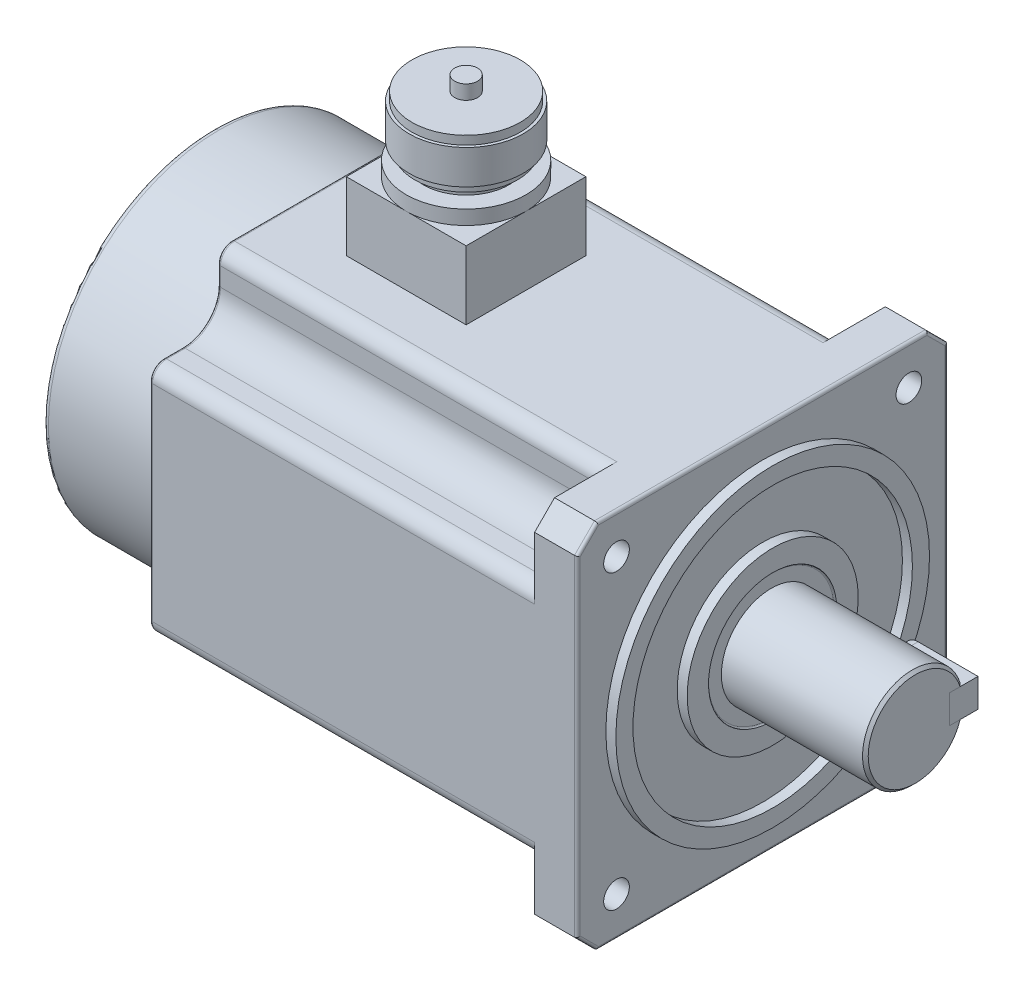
ISO-10303-21;
HEADER;
FILE_DESCRIPTION(('STEP AP214'),'2;1');
FILE_NAME('part.step','',(''),(''),'','','');
FILE_SCHEMA(('AUTOMOTIVE_DESIGN { 1 0 10303 214 1 1 1 1 }'));
ENDSEC;
DATA;
#1=APPLICATION_CONTEXT('core data for automotive mechanical design processes');
#2=APPLICATION_PROTOCOL_DEFINITION('international standard','automotive_design',2000,#1);
#3=PRODUCT_CONTEXT('',#1,'mechanical');
#4=PRODUCT('Part','Part','',(#3));
#5=PRODUCT_RELATED_PRODUCT_CATEGORY('part','',(#4));
#6=PRODUCT_DEFINITION_FORMATION('','',#4);
#7=PRODUCT_DEFINITION_CONTEXT('part definition',#1,'design');
#8=PRODUCT_DEFINITION('design','',#6,#7);
#9=PRODUCT_DEFINITION_SHAPE('','',#8);
#10=(LENGTH_UNIT() NAMED_UNIT(*) SI_UNIT(.MILLI.,.METRE.));
#11=(NAMED_UNIT(*) PLANE_ANGLE_UNIT() SI_UNIT($,.RADIAN.));
#12=(NAMED_UNIT(*) SI_UNIT($,.STERADIAN.) SOLID_ANGLE_UNIT());
#13=UNCERTAINTY_MEASURE_WITH_UNIT(LENGTH_MEASURE(1.E-05),#10,'distance_accuracy_value','');
#14=(GEOMETRIC_REPRESENTATION_CONTEXT(3) GLOBAL_UNCERTAINTY_ASSIGNED_CONTEXT((#13)) GLOBAL_UNIT_ASSIGNED_CONTEXT((#10,
#11,#12)) REPRESENTATION_CONTEXT('',''));
#15=CARTESIAN_POINT('',(0.,0.,0.));
#16=DIRECTION('',(0.,0.,1.));
#17=DIRECTION('',(1.,0.,0.));
#18=AXIS2_PLACEMENT_3D('',#15,#16,#17);
#19=CARTESIAN_POINT('',(32.5,0.,-22.));
#20=DIRECTION('',(0.,0.,1.));
#21=DIRECTION('',(1.,0.,0.));
#22=AXIS2_PLACEMENT_3D('',#19,#20,#21);
#23=CYLINDRICAL_SURFACE('',#22,5.);
#24=CARTESIAN_POINT('',(32.5,0.,-12.));
#25=DIRECTION('',(0.,0.,-1.));
#26=DIRECTION('',(-1.,0.,0.));
#27=AXIS2_PLACEMENT_3D('',#24,#25,#26);
#28=CIRCLE('',#27,5.);
#29=CARTESIAN_POINT('',(32.5,-5.,-12.));
#30=VERTEX_POINT('',#29);
#31=CARTESIAN_POINT('',(32.5,4.99999999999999,-12.));
#32=VERTEX_POINT('',#31);
#33=EDGE_CURVE('E106',#30,#32,#28,.T.);
#34=ORIENTED_EDGE('',*,*,#33,.T.);
#35=DIRECTION('',(0.,0.,1.));
#36=VECTOR('',#35,1.);
#37=CARTESIAN_POINT('',(32.5,4.99999999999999,-22.));
#38=LINE('',#37,#36);
#39=CARTESIAN_POINT('',(32.5,4.99999999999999,-22.));
#40=VERTEX_POINT('',#39);
#41=EDGE_CURVE('E12',#40,#32,#38,.T.);
#42=ORIENTED_EDGE('',*,*,#41,.F.);
#43=CARTESIAN_POINT('',(32.5,0.,-22.));
#44=DIRECTION('',(0.,0.,-1.));
#45=DIRECTION('',(-1.,0.,0.));
#46=AXIS2_PLACEMENT_3D('',#43,#44,#45);
#47=CIRCLE('',#46,5.);
#48=CARTESIAN_POINT('',(32.5,-5.,-22.));
#49=VERTEX_POINT('',#48);
#50=EDGE_CURVE('E94',#49,#40,#47,.T.);
#51=ORIENTED_EDGE('',*,*,#50,.F.);
#52=DIRECTION('',(0.,0.,1.));
#53=VECTOR('',#52,1.);
#54=CARTESIAN_POINT('',(32.5,-5.,-22.));
#55=LINE('',#54,#53);
#56=EDGE_CURVE('E102',#49,#30,#55,.T.);
#57=ORIENTED_EDGE('',*,*,#56,.T.);
#58=EDGE_LOOP('',(#34,#42,#51,#57));
#59=FACE_BOUND('',#58,.T.);
#60=ADVANCED_FACE('F43',(#59),#23,.T.);
#61=CARTESIAN_POINT('',(32.5,4.99999999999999,-22.));
#62=DIRECTION('',(0.,-1.,0.));
#63=DIRECTION('',(1.,0.,0.));
#64=AXIS2_PLACEMENT_3D('',#61,#62,#63);
#65=PLANE('',#64);
#66=DIRECTION('',(1.,0.,0.));
#67=VECTOR('',#66,1.);
#68=CARTESIAN_POINT('',(32.5,4.99999999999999,-12.));
#69=LINE('',#68,#67);
#70=CARTESIAN_POINT('',(53.5,4.99999999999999,-12.));
#71=VERTEX_POINT('',#70);
#72=EDGE_CURVE('E98',#32,#71,#69,.T.);
#73=ORIENTED_EDGE('',*,*,#72,.T.);
#74=DIRECTION('',(0.,0.,1.));
#75=VECTOR('',#74,1.);
#76=CARTESIAN_POINT('',(53.5,4.99999999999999,-22.));
#77=LINE('',#76,#75);
#78=CARTESIAN_POINT('',(53.5,4.99999999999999,-22.));
#79=VERTEX_POINT('',#78);
#80=EDGE_CURVE('E51',#79,#71,#77,.T.);
#81=ORIENTED_EDGE('',*,*,#80,.F.);
#82=DIRECTION('',(1.,0.,0.));
#83=VECTOR('',#82,1.);
#84=CARTESIAN_POINT('',(32.5,4.99999999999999,-22.));
#85=LINE('',#84,#83);
#86=EDGE_CURVE('E89',#40,#79,#85,.T.);
#87=ORIENTED_EDGE('',*,*,#86,.F.);
#88=ORIENTED_EDGE('',*,*,#41,.T.);
#89=EDGE_LOOP('',(#73,#81,#87,#88));
#90=FACE_BOUND('',#89,.T.);
#91=ADVANCED_FACE('F97',(#90),#65,.F.);
#92=CARTESIAN_POINT('',(53.5,4.99999999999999,-22.));
#93=DIRECTION('',(-1.,0.,0.));
#94=DIRECTION('',(0.,0.,1.));
#95=AXIS2_PLACEMENT_3D('',#92,#93,#94);
#96=PLANE('',#95);
#97=DIRECTION('',(0.,-1.,0.));
#98=VECTOR('',#97,1.);
#99=CARTESIAN_POINT('',(53.5,4.99999999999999,-12.));
#100=LINE('',#99,#98);
#101=CARTESIAN_POINT('',(53.5,-5.,-12.));
#102=VERTEX_POINT('',#101);
#103=EDGE_CURVE('E76',#71,#102,#100,.T.);
#104=ORIENTED_EDGE('',*,*,#103,.T.);
#105=DIRECTION('',(0.,0.,1.));
#106=VECTOR('',#105,1.);
#107=CARTESIAN_POINT('',(53.5,-5.,-22.));
#108=LINE('',#107,#106);
#109=CARTESIAN_POINT('',(53.5,-5.,-22.));
#110=VERTEX_POINT('',#109);
#111=EDGE_CURVE('E99',#110,#102,#108,.T.);
#112=ORIENTED_EDGE('',*,*,#111,.F.);
#113=DIRECTION('',(0.,-1.,0.));
#114=VECTOR('',#113,1.);
#115=CARTESIAN_POINT('',(53.5,4.99999999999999,-22.));
#116=LINE('',#115,#114);
#117=EDGE_CURVE('E92',#79,#110,#116,.T.);
#118=ORIENTED_EDGE('',*,*,#117,.F.);
#119=ORIENTED_EDGE('',*,*,#80,.T.);
#120=EDGE_LOOP('',(#104,#112,#118,#119));
#121=FACE_BOUND('',#120,.T.);
#122=ADVANCED_FACE('F100',(#121),#96,.F.);
#123=CARTESIAN_POINT('',(53.5,-5.,-22.));
#124=DIRECTION('',(0.,1.,0.));
#125=DIRECTION('',(-1.,0.,0.));
#126=AXIS2_PLACEMENT_3D('',#123,#124,#125);
#127=PLANE('',#126);
#128=DIRECTION('',(-1.,0.,0.));
#129=VECTOR('',#128,1.);
#130=CARTESIAN_POINT('',(53.5,-5.,-12.));
#131=LINE('',#130,#129);
#132=EDGE_CURVE('E82',#102,#30,#131,.T.);
#133=ORIENTED_EDGE('',*,*,#132,.T.);
#134=ORIENTED_EDGE('',*,*,#56,.F.);
#135=DIRECTION('',(-1.,0.,0.));
#136=VECTOR('',#135,1.);
#137=CARTESIAN_POINT('',(53.5,-5.,-22.));
#138=LINE('',#137,#136);
#139=EDGE_CURVE('E59',#110,#49,#138,.T.);
#140=ORIENTED_EDGE('',*,*,#139,.F.);
#141=ORIENTED_EDGE('',*,*,#111,.T.);
#142=EDGE_LOOP('',(#133,#134,#140,#141));
#143=FACE_BOUND('',#142,.T.);
#144=ADVANCED_FACE('F113',(#143),#127,.F.);
#145=CARTESIAN_POINT('',(32.5,0.,-22.));
#146=DIRECTION('',(0.,0.,-1.));
#147=DIRECTION('',(-1.,0.,0.));
#148=AXIS2_PLACEMENT_3D('',#145,#146,#147);
#149=PLANE('',#148);
#150=ORIENTED_EDGE('',*,*,#50,.T.);
#151=ORIENTED_EDGE('',*,*,#86,.T.);
#152=ORIENTED_EDGE('',*,*,#117,.T.);
#153=ORIENTED_EDGE('',*,*,#139,.T.);
#154=EDGE_LOOP('',(#150,#151,#152,#153));
#155=FACE_BOUND('',#154,.T.);
#156=ADVANCED_FACE('F90',(#155),#149,.T.);
#157=CARTESIAN_POINT('',(32.5,0.,-12.));
#158=DIRECTION('',(0.,0.,-1.));
#159=DIRECTION('',(-1.,0.,0.));
#160=AXIS2_PLACEMENT_3D('',#157,#158,#159);
#161=PLANE('',#160);
#162=ORIENTED_EDGE('',*,*,#33,.F.);
#163=ORIENTED_EDGE('',*,*,#132,.F.);
#164=ORIENTED_EDGE('',*,*,#103,.F.);
#165=ORIENTED_EDGE('',*,*,#72,.F.);
#166=EDGE_LOOP('',(#162,#163,#164,#165));
#167=FACE_BOUND('',#166,.T.);
#168=ADVANCED_FACE('F116',(#167),#161,.F.);
#169=CLOSED_SHELL('',(#60,#91,#122,#144,#156,#168));
#170=MANIFOLD_SOLID_BREP('B2',#169);
#171=CARTESIAN_POINT('',(-104.,115.,0.));
#172=DIRECTION('',(0.,1.,0.));
#173=DIRECTION('',(0.,0.,1.));
#174=AXIS2_PLACEMENT_3D('',#171,#172,#173);
#175=PLANE('',#174);
#176=CARTESIAN_POINT('',(-104.,115.,0.));
#177=DIRECTION('',(0.,1.,0.));
#178=DIRECTION('',(0.,0.,1.));
#179=AXIS2_PLACEMENT_3D('',#176,#177,#178);
#180=CIRCLE('',#179,19.);
#181=CARTESIAN_POINT('',(-104.,115.,19.));
#182=VERTEX_POINT('',#181);
#183=EDGE_CURVE('E2383',#182,#182,#180,.T.);
#184=ORIENTED_EDGE('',*,*,#183,.T.);
#185=EDGE_LOOP('',(#184));
#186=FACE_BOUND('',#185,.T.);
#187=CARTESIAN_POINT('',(-104.,115.,0.));
#188=DIRECTION('',(0.,1.,0.));
#189=DIRECTION('',(0.,0.,1.));
#190=AXIS2_PLACEMENT_3D('',#187,#188,#189);
#191=CIRCLE('',#190,4.00000000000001);
#192=CARTESIAN_POINT('',(-104.,115.,4.00000000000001));
#193=VERTEX_POINT('',#192);
#194=EDGE_CURVE('E2380',#193,#193,#191,.T.);
#195=ORIENTED_EDGE('',*,*,#194,.F.);
#196=EDGE_LOOP('',(#195));
#197=FACE_BOUND('',#196,.T.);
#198=ADVANCED_FACE('F167',(#186,#197),#175,.T.);
#199=CARTESIAN_POINT('',(-104.,112.,0.));
#200=DIRECTION('',(0.,1.,0.));
#201=DIRECTION('',(0.,0.,1.));
#202=AXIS2_PLACEMENT_3D('',#199,#200,#201);
#203=PLANE('',#202);
#204=CARTESIAN_POINT('',(-104.,112.,0.));
#205=DIRECTION('',(0.,1.,0.));
#206=DIRECTION('',(0.,0.,1.));
#207=AXIS2_PLACEMENT_3D('',#204,#205,#206);
#208=CIRCLE('',#207,20.);
#209=CARTESIAN_POINT('',(-104.,112.,20.));
#210=VERTEX_POINT('',#209);
#211=EDGE_CURVE('E2390',#210,#210,#208,.T.);
#212=ORIENTED_EDGE('',*,*,#211,.T.);
#213=EDGE_LOOP('',(#212));
#214=FACE_BOUND('',#213,.T.);
#215=CARTESIAN_POINT('',(-104.,112.,0.));
#216=DIRECTION('',(0.,1.,0.));
#217=DIRECTION('',(0.,0.,1.));
#218=AXIS2_PLACEMENT_3D('',#215,#216,#217);
#219=CIRCLE('',#218,19.);
#220=CARTESIAN_POINT('',(-104.,112.,19.));
#221=VERTEX_POINT('',#220);
#222=EDGE_CURVE('E2379',#221,#221,#219,.T.);
#223=ORIENTED_EDGE('',*,*,#222,.F.);
#224=EDGE_LOOP('',(#223));
#225=FACE_BOUND('',#224,.T.);
#226=ADVANCED_FACE('F1126',(#214,#225),#203,.T.);
#227=CARTESIAN_POINT('',(-104.,94.,0.));
#228=DIRECTION('',(0.,1.,0.));
#229=DIRECTION('',(0.,0.,1.));
#230=AXIS2_PLACEMENT_3D('',#227,#228,#229);
#231=PLANE('',#230);
#232=CARTESIAN_POINT('',(-104.,94.,0.));
#233=DIRECTION('',(0.,1.,0.));
#234=DIRECTION('',(0.,0.,1.));
#235=AXIS2_PLACEMENT_3D('',#232,#233,#234);
#236=CIRCLE('',#235,21.);
#237=CARTESIAN_POINT('',(-104.,94.,21.));
#238=VERTEX_POINT('',#237);
#239=EDGE_CURVE('E565',#238,#238,#236,.T.);
#240=ORIENTED_EDGE('',*,*,#239,.T.);
#241=EDGE_LOOP('',(#240));
#242=FACE_BOUND('',#241,.T.);
#243=CARTESIAN_POINT('',(-104.,94.,0.));
#244=DIRECTION('',(0.,1.,0.));
#245=DIRECTION('',(0.,0.,1.));
#246=AXIS2_PLACEMENT_3D('',#243,#244,#245);
#247=CIRCLE('',#246,15.);
#248=CARTESIAN_POINT('',(-104.,94.,15.));
#249=VERTEX_POINT('',#248);
#250=EDGE_CURVE('E2399',#249,#249,#247,.T.);
#251=ORIENTED_EDGE('',*,*,#250,.F.);
#252=EDGE_LOOP('',(#251));
#253=FACE_BOUND('',#252,.T.);
#254=ADVANCED_FACE('F1132',(#242,#253),#231,.T.);
#255=CARTESIAN_POINT('',(0.,89.,0.));
#256=DIRECTION('',(0.,-1.,0.));
#257=DIRECTION('',(0.,0.,-1.));
#258=AXIS2_PLACEMENT_3D('',#255,#256,#257);
#259=PLANE('',#258);
#260=CARTESIAN_POINT('',(-104.,89.,0.));
#261=DIRECTION('',(0.,1.,0.));
#262=DIRECTION('',(0.,0.,1.));
#263=AXIS2_PLACEMENT_3D('',#260,#261,#262);
#264=CIRCLE('',#263,21.);
#265=CARTESIAN_POINT('',(-104.,89.,21.));
#266=VERTEX_POINT('',#265);
#267=CARTESIAN_POINT('',(-83.,89.,0.));
#268=VERTEX_POINT('',#267);
#269=EDGE_CURVE('E183',#266,#268,#264,.T.);
#270=ORIENTED_EDGE('',*,*,#269,.F.);
#271=DIRECTION('',(1.,0.,0.));
#272=VECTOR('',#271,1.);
#273=CARTESIAN_POINT('',(-125.,89.,21.));
#274=LINE('',#273,#272);
#275=CARTESIAN_POINT('',(-83.,89.,21.));
#276=VERTEX_POINT('',#275);
#277=EDGE_CURVE('E551',#266,#276,#274,.T.);
#278=ORIENTED_EDGE('',*,*,#277,.T.);
#279=DIRECTION('',(0.,0.,-1.));
#280=VECTOR('',#279,1.);
#281=CARTESIAN_POINT('',(-83.,89.,21.));
#282=LINE('',#281,#280);
#283=EDGE_CURVE('E563',#276,#268,#282,.T.);
#284=ORIENTED_EDGE('',*,*,#283,.T.);
#285=EDGE_LOOP('',(#270,#278,#284));
#286=FACE_BOUND('',#285,.T.);
#287=ADVANCED_FACE('F562',(#286),#259,.F.);
#288=CARTESIAN_POINT('',(-104.,89.,-21.));
#289=VERTEX_POINT('',#288);
#290=EDGE_CURVE('E41',#268,#289,#264,.T.);
#291=ORIENTED_EDGE('',*,*,#290,.F.);
#292=CARTESIAN_POINT('',(-83.,89.,-21.));
#293=VERTEX_POINT('',#292);
#294=EDGE_CURVE('E574',#268,#293,#282,.T.);
#295=ORIENTED_EDGE('',*,*,#294,.T.);
#296=DIRECTION('',(-1.,0.,0.));
#297=VECTOR('',#296,1.);
#298=CARTESIAN_POINT('',(-125.,89.,-21.));
#299=LINE('',#298,#297);
#300=EDGE_CURVE('E575',#293,#289,#299,.T.);
#301=ORIENTED_EDGE('',*,*,#300,.T.);
#302=EDGE_LOOP('',(#291,#295,#301));
#303=FACE_BOUND('',#302,.T.);
#304=ADVANCED_FACE('F1173',(#303),#259,.F.);
#305=CARTESIAN_POINT('',(-125.,89.,0.));
#306=VERTEX_POINT('',#305);
#307=EDGE_CURVE('E181',#289,#306,#264,.T.);
#308=ORIENTED_EDGE('',*,*,#307,.F.);
#309=CARTESIAN_POINT('',(-125.,89.,-21.));
#310=VERTEX_POINT('',#309);
#311=EDGE_CURVE('E573',#289,#310,#299,.T.);
#312=ORIENTED_EDGE('',*,*,#311,.T.);
#313=DIRECTION('',(0.,0.,1.));
#314=VECTOR('',#313,1.);
#315=CARTESIAN_POINT('',(-125.,89.,21.));
#316=LINE('',#315,#314);
#317=EDGE_CURVE('E560',#310,#306,#316,.T.);
#318=ORIENTED_EDGE('',*,*,#317,.T.);
#319=EDGE_LOOP('',(#308,#312,#318));
#320=FACE_BOUND('',#319,.T.);
#321=ADVANCED_FACE('F1327',(#320),#259,.F.);
#322=EDGE_CURVE('E190',#306,#266,#264,.T.);
#323=ORIENTED_EDGE('',*,*,#322,.F.);
#324=CARTESIAN_POINT('',(-125.,89.,21.));
#325=VERTEX_POINT('',#324);
#326=EDGE_CURVE('E547',#306,#325,#316,.T.);
#327=ORIENTED_EDGE('',*,*,#326,.T.);
#328=EDGE_CURVE('E544',#325,#266,#274,.T.);
#329=ORIENTED_EDGE('',*,*,#328,.T.);
#330=EDGE_LOOP('',(#323,#327,#329));
#331=FACE_BOUND('',#330,.T.);
#332=ADVANCED_FACE('F546',(#331),#259,.F.);
#333=CARTESIAN_POINT('',(-150.,65.,58.));
#334=DIRECTION('',(0.,1.,0.));
#335=DIRECTION('',(0.,0.,1.));
#336=AXIS2_PLACEMENT_3D('',#333,#334,#335);
#337=PLANE('',#336);
#338=DIRECTION('',(-1.,0.,0.));
#339=VECTOR('',#338,1.);
#340=CARTESIAN_POINT('',(-15.,65.,-36.1509109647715));
#341=LINE('',#340,#339);
#342=CARTESIAN_POINT('',(-15.,65.,-36.1509109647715));
#343=VERTEX_POINT('',#342);
#344=CARTESIAN_POINT('',(-149.,65.,-36.1509109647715));
#345=VERTEX_POINT('',#344);
#346=EDGE_CURVE('E813',#343,#345,#341,.T.);
#347=ORIENTED_EDGE('',*,*,#346,.T.);
#348=DIRECTION('',(0.,0.,1.));
#349=VECTOR('',#348,1.);
#350=CARTESIAN_POINT('',(-149.,65.,36.1509109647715));
#351=LINE('',#350,#349);
#352=CARTESIAN_POINT('',(-149.,65.,36.1509109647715));
#353=VERTEX_POINT('',#352);
#354=EDGE_CURVE('E991',#345,#353,#351,.T.);
#355=ORIENTED_EDGE('',*,*,#354,.T.);
#356=DIRECTION('',(-1.,0.,0.));
#357=VECTOR('',#356,1.);
#358=CARTESIAN_POINT('',(-15.,65.,36.1509109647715));
#359=LINE('',#358,#357);
#360=CARTESIAN_POINT('',(-15.,65.,36.1509109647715));
#361=VERTEX_POINT('',#360);
#362=EDGE_CURVE('E734',#361,#353,#359,.T.);
#363=ORIENTED_EDGE('',*,*,#362,.F.);
#364=DIRECTION('',(0.,0.,-1.));
#365=VECTOR('',#364,1.);
#366=CARTESIAN_POINT('',(-15.,65.,58.));
#367=LINE('',#366,#365);
#368=CARTESIAN_POINT('',(-15.,65.,58.));
#369=VERTEX_POINT('',#368);
#370=EDGE_CURVE('E730',#369,#361,#367,.T.);
#371=ORIENTED_EDGE('',*,*,#370,.F.);
#372=DIRECTION('',(1.,0.,0.));
#373=VECTOR('',#372,1.);
#374=CARTESIAN_POINT('',(-150.,65.,58.));
#375=LINE('',#374,#373);
#376=CARTESIAN_POINT('',(-1.,65.,58.));
#377=VERTEX_POINT('',#376);
#378=EDGE_CURVE('E817',#369,#377,#375,.T.);
#379=ORIENTED_EDGE('',*,*,#378,.T.);
#380=DIRECTION('',(0.,0.,1.));
#381=VECTOR('',#380,1.);
#382=CARTESIAN_POINT('',(-1.,65.,58.));
#383=LINE('',#382,#381);
#384=CARTESIAN_POINT('',(-1.,65.,-58.));
#385=VERTEX_POINT('',#384);
#386=EDGE_CURVE('E887',#377,#385,#383,.F.);
#387=ORIENTED_EDGE('',*,*,#386,.T.);
#388=DIRECTION('',(1.,0.,0.));
#389=VECTOR('',#388,1.);
#390=CARTESIAN_POINT('',(-150.,65.,-58.));
#391=LINE('',#390,#389);
#392=CARTESIAN_POINT('',(-15.,65.,-58.));
#393=VERTEX_POINT('',#392);
#394=EDGE_CURVE('E832',#393,#385,#391,.T.);
#395=ORIENTED_EDGE('',*,*,#394,.F.);
#396=DIRECTION('',(0.,0.,-1.));
#397=VECTOR('',#396,1.);
#398=CARTESIAN_POINT('',(-15.,65.,-36.1509109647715));
#399=LINE('',#398,#397);
#400=EDGE_CURVE('E794',#343,#393,#399,.T.);
#401=ORIENTED_EDGE('',*,*,#400,.F.);
#402=EDGE_LOOP('',(#347,#355,#363,#371,#379,#387,#395,#401));
#403=FACE_BOUND('',#402,.T.);
#404=DIRECTION('',(-1.,0.,0.));
#405=VECTOR('',#404,1.);
#406=CARTESIAN_POINT('',(-125.,65.,-21.));
#407=LINE('',#406,#405);
#408=CARTESIAN_POINT('',(-83.,65.,-21.));
#409=VERTEX_POINT('',#408);
#410=CARTESIAN_POINT('',(-125.,65.,-21.));
#411=VERTEX_POINT('',#410);
#412=EDGE_CURVE('E582',#409,#411,#407,.T.);
#413=ORIENTED_EDGE('',*,*,#412,.F.);
#414=DIRECTION('',(0.,0.,-1.));
#415=VECTOR('',#414,1.);
#416=CARTESIAN_POINT('',(-83.,65.,21.));
#417=LINE('',#416,#415);
#418=CARTESIAN_POINT('',(-83.,65.,21.));
#419=VERTEX_POINT('',#418);
#420=EDGE_CURVE('E579',#419,#409,#417,.T.);
#421=ORIENTED_EDGE('',*,*,#420,.F.);
#422=DIRECTION('',(1.,0.,0.));
#423=VECTOR('',#422,1.);
#424=CARTESIAN_POINT('',(-125.,65.,21.));
#425=LINE('',#424,#423);
#426=CARTESIAN_POINT('',(-125.,65.,21.));
#427=VERTEX_POINT('',#426);
#428=EDGE_CURVE('E587',#427,#419,#425,.T.);
#429=ORIENTED_EDGE('',*,*,#428,.F.);
#430=DIRECTION('',(0.,0.,1.));
#431=VECTOR('',#430,1.);
#432=CARTESIAN_POINT('',(-125.,65.,21.));
#433=LINE('',#432,#431);
#434=EDGE_CURVE('E584',#411,#427,#433,.T.);
#435=ORIENTED_EDGE('',*,*,#434,.F.);
#436=EDGE_LOOP('',(#413,#421,#429,#435));
#437=FACE_BOUND('',#436,.T.);
#438=ADVANCED_FACE('F1123',(#403,#437),#337,.T.);
#439=CARTESIAN_POINT('',(53.5,0.,0.));
#440=DIRECTION('',(-1.,0.,0.));
#441=DIRECTION('',(0.,0.,1.));
#442=AXIS2_PLACEMENT_3D('',#439,#440,#441);
#443=CYLINDRICAL_SURFACE('',#442,17.5);
#444=CARTESIAN_POINT('',(3.,0.,0.));
#445=DIRECTION('',(1.,0.,0.));
#446=DIRECTION('',(0.,0.,-1.));
#447=AXIS2_PLACEMENT_3D('',#444,#445,#446);
#448=CIRCLE('',#447,17.5);
#449=CARTESIAN_POINT('',(3.,0.,-17.5));
#450=VERTEX_POINT('',#449);
#451=EDGE_CURVE('E624',#450,#450,#448,.T.);
#452=ORIENTED_EDGE('',*,*,#451,.T.);
#453=EDGE_LOOP('',(#452));
#454=FACE_BOUND('',#453,.T.);
#455=DIRECTION('',(-1.,0.,0.));
#456=VECTOR('',#455,1.);
#457=CARTESIAN_POINT('',(53.5,-5.,-16.7705098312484));
#458=LINE('',#457,#456);
#459=CARTESIAN_POINT('',(52.5000000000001,-5.,-16.7705098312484));
#460=VERTEX_POINT('',#459);
#461=CARTESIAN_POINT('',(32.5,-5.,-16.7705098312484));
#462=VERTEX_POINT('',#461);
#463=EDGE_CURVE('E622',#460,#462,#458,.T.);
#464=ORIENTED_EDGE('',*,*,#463,.F.);
#465=CARTESIAN_POINT('',(52.5000000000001,0.,0.));
#466=DIRECTION('',(1.,0.,0.));
#467=DIRECTION('',(0.,0.,-1.));
#468=AXIS2_PLACEMENT_3D('',#465,#466,#467);
#469=CIRCLE('',#468,17.5);
#470=CARTESIAN_POINT('',(52.5000000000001,4.99999999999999,-16.7705098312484));
#471=VERTEX_POINT('',#470);
#472=EDGE_CURVE('E568',#460,#471,#469,.F.);
#473=ORIENTED_EDGE('',*,*,#472,.T.);
#474=DIRECTION('',(-1.,0.,0.));
#475=VECTOR('',#474,1.);
#476=CARTESIAN_POINT('',(53.5,4.99999999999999,-16.7705098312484));
#477=LINE('',#476,#475);
#478=CARTESIAN_POINT('',(32.5,4.99999999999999,-16.7705098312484));
#479=VERTEX_POINT('',#478);
#480=EDGE_CURVE('E619',#479,#471,#477,.F.);
#481=ORIENTED_EDGE('',*,*,#480,.F.);
#482=CARTESIAN_POINT('',(32.5,-5.,-16.7705098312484));
#483=CARTESIAN_POINT('',(32.3624562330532,-5.00001814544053,-16.7704912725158));
#484=CARTESIAN_POINT('',(32.2249193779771,-4.99432529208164,-16.7722013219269));
#485=CARTESIAN_POINT('',(31.9508888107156,-4.97165222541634,-16.7789431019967));
#486=CARTESIAN_POINT('',(31.8143948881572,-4.95467435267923,-16.7839741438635));
#487=CARTESIAN_POINT('',(31.5437415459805,-4.90961903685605,-16.7972068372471));
#488=CARTESIAN_POINT('',(31.4095773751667,-4.88156789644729,-16.8054009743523));
#489=CARTESIAN_POINT('',(31.1442003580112,-4.81461674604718,-16.8247046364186));
#490=CARTESIAN_POINT('',(31.012987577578,-4.77571649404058,-16.8358142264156));
#491=CARTESIAN_POINT('',(30.7544683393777,-4.68740449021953,-16.8606149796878));
#492=CARTESIAN_POINT('',(30.627159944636,-4.63799805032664,-16.874304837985));
#493=CARTESIAN_POINT('',(30.3772006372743,-4.52905522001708,-16.9038705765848));
#494=CARTESIAN_POINT('',(30.2545514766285,-4.46951506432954,-16.9197472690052));
#495=CARTESIAN_POINT('',(29.894791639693,-4.27631278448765,-16.9699997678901));
#496=CARTESIAN_POINT('',(29.6657016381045,-4.12801150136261,-17.007014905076));
#497=CARTESIAN_POINT('',(29.2294860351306,-3.79229915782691,-17.0850471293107));
#498=CARTESIAN_POINT('',(29.023079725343,-3.60397767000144,-17.1261428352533));
#499=CARTESIAN_POINT('',(28.6442623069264,-3.19544341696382,-17.2070462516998));
#500=CARTESIAN_POINT('',(28.471856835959,-2.97522537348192,-17.2468537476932));
#501=CARTESIAN_POINT('',(28.1629219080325,-2.5041085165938,-17.3215844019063));
#502=CARTESIAN_POINT('',(28.0271190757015,-2.25271539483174,-17.3564029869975));
#503=CARTESIAN_POINT('',(27.7999922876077,-1.72950937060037,-17.4163145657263));
#504=CARTESIAN_POINT('',(27.7086576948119,-1.45770136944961,-17.4414098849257));
#505=CARTESIAN_POINT('',(27.5754142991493,-0.908899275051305,-17.4784878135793));
#506=CARTESIAN_POINT('',(27.5322781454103,-0.632225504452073,-17.4907954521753));
#507=CARTESIAN_POINT('',(27.4927833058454,-0.0753060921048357,-17.5020523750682));
#508=CARTESIAN_POINT('',(27.4964166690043,0.204938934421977,-17.5010039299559));
#509=CARTESIAN_POINT('',(27.5495154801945,0.752451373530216,-17.4859002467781));
#510=CARTESIAN_POINT('',(27.5976523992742,1.0198597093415,-17.4722220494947));
#511=CARTESIAN_POINT('',(27.7362408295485,1.54263514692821,-17.4338464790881));
#512=CARTESIAN_POINT('',(27.8266944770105,1.79800164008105,-17.4091485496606));
#513=CARTESIAN_POINT('',(28.0482663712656,2.29267928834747,-17.3509771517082));
#514=CARTESIAN_POINT('',(28.1798189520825,2.53178407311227,-17.3174105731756));
#515=CARTESIAN_POINT('',(28.4796443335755,2.98504901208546,-17.2450626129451));
#516=CARTESIAN_POINT('',(28.6479245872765,3.19920408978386,-17.2062801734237));
#517=CARTESIAN_POINT('',(28.9276273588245,3.50113424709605,-17.1465202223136));
#518=CARTESIAN_POINT('',(29.0273638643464,3.6000742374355,-17.1259700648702));
#519=CARTESIAN_POINT('',(29.2348202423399,3.7892313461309,-17.0851123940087));
#520=CARTESIAN_POINT('',(29.3425373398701,3.87945147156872,-17.0648047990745));
#521=CARTESIAN_POINT('',(29.5653450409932,4.05062437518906,-17.0249868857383));
#522=CARTESIAN_POINT('',(29.6804405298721,4.13157091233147,-17.005477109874));
#523=CARTESIAN_POINT('',(29.917160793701,4.28353981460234,-16.9678346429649));
#524=CARTESIAN_POINT('',(30.0387830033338,4.35456603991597,-16.9497014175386));
#525=CARTESIAN_POINT('',(30.2889159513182,4.48679157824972,-16.9151829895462));
#526=CARTESIAN_POINT('',(30.4174786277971,4.54789718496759,-16.898814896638));
#527=CARTESIAN_POINT('',(30.67954149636,4.65898872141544,-16.8685251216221));
#528=CARTESIAN_POINT('',(30.8130396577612,4.70897916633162,-16.8546024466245));
#529=CARTESIAN_POINT('',(31.0839210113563,4.79739484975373,-16.829649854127));
#530=CARTESIAN_POINT('',(31.2212999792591,4.835832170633,-16.8186169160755));
#531=CARTESIAN_POINT('',(31.4989955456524,4.90084834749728,-16.7997865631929));
#532=CARTESIAN_POINT('',(31.6393107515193,4.92743269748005,-16.7919876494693));
#533=CARTESIAN_POINT('',(31.8996651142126,4.96528740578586,-16.7808301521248));
#534=CARTESIAN_POINT('',(32.0194316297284,4.97830600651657,-16.776966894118));
#535=CARTESIAN_POINT('',(32.2594622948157,4.99566040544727,-16.7718034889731));
#536=CARTESIAN_POINT('',(32.379725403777,5.0000094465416,-16.7704994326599));
#537=CARTESIAN_POINT('',(32.5,4.99999999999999,-16.7705098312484));
#538=B_SPLINE_CURVE_WITH_KNOTS('',3,(#482,#483,#484,#485,#486,#487,#488,#489,#490,#491,#492,
#493,#494,#495,#496,#497,#498,#499,#500,#501,#502,#503,#504,#505,#506,#507,#508,#509,#510,#511,
#512,#513,#514,#515,#516,#517,#518,#519,#520,#521,#522,#523,#524,#525,#526,#527,#528,#529,#530,
#531,#532,#533,#534,#535,#536,#537),.UNSPECIFIED.,.F.,.F.,(4,2,2,2,2,2,2,2,2,2,2,2,2,2,2,2,2,2,
2,2,2,2,2,2,2,2,2,4),(0.,0.412492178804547,0.824898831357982,1.23633171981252,1.64777378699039,
2.05900832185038,2.47039598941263,3.29264569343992,4.13611232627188,4.9797186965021,
5.83900986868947,6.69809539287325,7.53476732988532,8.3712970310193,9.18363381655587,
9.99601161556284,10.8172828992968,11.6387209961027,12.0642579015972,12.489647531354,
12.9153217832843,13.3408299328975,13.7701489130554,14.1992931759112,14.6279870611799,
15.056482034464,15.4177510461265,15.7784677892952),.UNSPECIFIED.);
#539=EDGE_CURVE('E1092',#462,#479,#538,.T.);
#540=ORIENTED_EDGE('',*,*,#539,.F.);
#541=EDGE_LOOP('',(#464,#473,#481,#540));
#542=FACE_BOUND('',#541,.T.);
#543=ADVANCED_FACE('F1101',(#454,#542),#443,.T.);
#544=CARTESIAN_POINT('',(53.5,0.,0.));
#545=DIRECTION('',(1.,0.,0.));
#546=DIRECTION('',(0.,0.,-1.));
#547=AXIS2_PLACEMENT_3D('',#544,#545,#546);
#548=PLANE('',#547);
#549=DIRECTION('',(0.,0.,-1.));
#550=VECTOR('',#549,1.);
#551=CARTESIAN_POINT('',(53.5,4.99999999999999,-12.));
#552=LINE('',#551,#550);
#553=CARTESIAN_POINT('',(53.5,4.99999999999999,-12.));
#554=VERTEX_POINT('',#553);
#555=CARTESIAN_POINT('',(53.5,4.99999999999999,-15.7241851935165));
#556=VERTEX_POINT('',#555);
#557=EDGE_CURVE('E610',#554,#556,#552,.T.);
#558=ORIENTED_EDGE('',*,*,#557,.T.);
#559=CARTESIAN_POINT('',(53.5,0.,0.));
#560=DIRECTION('',(1.,0.,0.));
#561=DIRECTION('',(0.,0.,-1.));
#562=AXIS2_PLACEMENT_3D('',#559,#560,#561);
#563=CIRCLE('',#562,16.5000000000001);
#564=CARTESIAN_POINT('',(53.5,-5.,-15.7241851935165));
#565=VERTEX_POINT('',#564);
#566=EDGE_CURVE('E1099',#556,#565,#563,.T.);
#567=ORIENTED_EDGE('',*,*,#566,.T.);
#568=DIRECTION('',(0.,0.,-1.));
#569=VECTOR('',#568,1.);
#570=CARTESIAN_POINT('',(53.5,-5.,-12.));
#571=LINE('',#570,#569);
#572=CARTESIAN_POINT('',(53.5,-5.,-12.));
#573=VERTEX_POINT('',#572);
#574=EDGE_CURVE('E613',#573,#565,#571,.T.);
#575=ORIENTED_EDGE('',*,*,#574,.F.);
#576=DIRECTION('',(0.,1.,0.));
#577=VECTOR('',#576,1.);
#578=CARTESIAN_POINT('',(53.5,4.99999999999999,-12.));
#579=LINE('',#578,#577);
#580=EDGE_CURVE('E602',#573,#554,#579,.T.);
#581=ORIENTED_EDGE('',*,*,#580,.T.);
#582=EDGE_LOOP('',(#558,#567,#575,#581));
#583=FACE_BOUND('',#582,.T.);
#584=ADVANCED_FACE('F1113',(#583),#548,.T.);
#585=CARTESIAN_POINT('',(3.,0.,0.));
#586=DIRECTION('',(1.,0.,0.));
#587=DIRECTION('',(0.,0.,-1.));
#588=AXIS2_PLACEMENT_3D('',#585,#586,#587);
#589=PLANE('',#588);
#590=CARTESIAN_POINT('',(3.,0.,0.));
#591=DIRECTION('',(1.,0.,0.));
#592=DIRECTION('',(0.,0.,-1.));
#593=AXIS2_PLACEMENT_3D('',#590,#591,#592);
#594=CIRCLE('',#593,22.);
#595=CARTESIAN_POINT('',(3.,0.,-22.));
#596=VERTEX_POINT('',#595);
#597=EDGE_CURVE('E1089',#596,#596,#594,.T.);
#598=ORIENTED_EDGE('',*,*,#597,.T.);
#599=EDGE_LOOP('',(#598));
#600=FACE_BOUND('',#599,.T.);
#601=ORIENTED_EDGE('',*,*,#451,.F.);
#602=EDGE_LOOP('',(#601));
#603=FACE_BOUND('',#602,.T.);
#604=ADVANCED_FACE('F1115',(#600,#603),#589,.T.);
#605=CARTESIAN_POINT('',(0.,0.,0.));
#606=DIRECTION('',(1.,0.,0.));
#607=DIRECTION('',(0.,0.,-1.));
#608=AXIS2_PLACEMENT_3D('',#605,#606,#607);
#609=PLANE('',#608);
#610=DIRECTION('',(0.,1.,0.));
#611=VECTOR('',#610,1.);
#612=CARTESIAN_POINT('',(0.,0.,-64.));
#613=LINE('',#612,#611);
#614=CARTESIAN_POINT('',(0.,-57.5857864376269,-64.));
#615=VERTEX_POINT('',#614);
#616=CARTESIAN_POINT('',(0.,57.5857864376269,-64.));
#617=VERTEX_POINT('',#616);
#618=EDGE_CURVE('E867',#615,#617,#613,.T.);
#619=ORIENTED_EDGE('',*,*,#618,.T.);
#620=DIRECTION('',(0.,0.707106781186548,0.707106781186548));
#621=VECTOR('',#620,1.);
#622=CARTESIAN_POINT('',(0.,60.7928932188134,-60.7928932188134));
#623=LINE('',#622,#621);
#624=CARTESIAN_POINT('',(0.,64.,-57.5857864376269));
#625=VERTEX_POINT('',#624);
#626=EDGE_CURVE('E869',#617,#625,#623,.T.);
#627=ORIENTED_EDGE('',*,*,#626,.T.);
#628=DIRECTION('',(0.,0.,1.));
#629=VECTOR('',#628,1.);
#630=CARTESIAN_POINT('',(0.,64.,0.));
#631=LINE('',#630,#629);
#632=CARTESIAN_POINT('',(0.,64.,57.5857864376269));
#633=VERTEX_POINT('',#632);
#634=EDGE_CURVE('E835',#625,#633,#631,.T.);
#635=ORIENTED_EDGE('',*,*,#634,.T.);
#636=DIRECTION('',(0.,-0.707106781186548,0.707106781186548));
#637=VECTOR('',#636,1.);
#638=CARTESIAN_POINT('',(0.,60.7928932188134,60.7928932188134));
#639=LINE('',#638,#637);
#640=CARTESIAN_POINT('',(0.,57.5857864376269,64.));
#641=VERTEX_POINT('',#640);
#642=EDGE_CURVE('E857',#633,#641,#639,.T.);
#643=ORIENTED_EDGE('',*,*,#642,.T.);
#644=DIRECTION('',(0.,-1.,0.));
#645=VECTOR('',#644,1.);
#646=CARTESIAN_POINT('',(0.,0.,64.));
#647=LINE('',#646,#645);
#648=CARTESIAN_POINT('',(0.,-57.5857864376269,64.));
#649=VERTEX_POINT('',#648);
#650=EDGE_CURVE('E859',#641,#649,#647,.T.);
#651=ORIENTED_EDGE('',*,*,#650,.T.);
#652=DIRECTION('',(0.,-0.707106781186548,-0.707106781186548));
#653=VECTOR('',#652,1.);
#654=CARTESIAN_POINT('',(0.,-60.7928932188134,60.7928932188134));
#655=LINE('',#654,#653);
#656=CARTESIAN_POINT('',(0.,-64.,57.5857864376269));
#657=VERTEX_POINT('',#656);
#658=EDGE_CURVE('E861',#649,#657,#655,.T.);
#659=ORIENTED_EDGE('',*,*,#658,.T.);
#660=DIRECTION('',(0.,0.,-1.));
#661=VECTOR('',#660,1.);
#662=CARTESIAN_POINT('',(0.,-64.,0.));
#663=LINE('',#662,#661);
#664=CARTESIAN_POINT('',(0.,-64.,-57.5857864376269));
#665=VERTEX_POINT('',#664);
#666=EDGE_CURVE('E863',#657,#665,#663,.T.);
#667=ORIENTED_EDGE('',*,*,#666,.T.);
#668=DIRECTION('',(0.,0.707106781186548,-0.707106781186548));
#669=VECTOR('',#668,1.);
#670=CARTESIAN_POINT('',(0.,-60.7928932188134,-60.7928932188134));
#671=LINE('',#670,#669);
#672=EDGE_CURVE('E865',#665,#615,#671,.T.);
#673=ORIENTED_EDGE('',*,*,#672,.T.);
#674=EDGE_LOOP('',(#619,#627,#635,#643,#651,#659,#667,#673));
#675=FACE_BOUND('',#674,.T.);
#676=CARTESIAN_POINT('',(0.,51.2652416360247,51.2652416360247));
#677=DIRECTION('',(1.,0.,0.));
#678=DIRECTION('',(0.,0.,-1.));
#679=AXIS2_PLACEMENT_3D('',#676,#677,#678);
#680=CIRCLE('',#679,4.5);
#681=CARTESIAN_POINT('',(0.,51.2652416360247,46.7652416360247));
#682=VERTEX_POINT('',#681);
#683=EDGE_CURVE('E661',#682,#682,#680,.T.);
#684=ORIENTED_EDGE('',*,*,#683,.F.);
#685=EDGE_LOOP('',(#684));
#686=FACE_BOUND('',#685,.T.);
#687=CARTESIAN_POINT('',(0.,51.2652416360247,-51.2652416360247));
#688=DIRECTION('',(1.,0.,0.));
#689=DIRECTION('',(0.,0.,-1.));
#690=AXIS2_PLACEMENT_3D('',#687,#688,#689);
#691=CIRCLE('',#690,4.5);
#692=CARTESIAN_POINT('',(0.,51.2652416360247,-55.7652416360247));
#693=VERTEX_POINT('',#692);
#694=EDGE_CURVE('E655',#693,#693,#691,.T.);
#695=ORIENTED_EDGE('',*,*,#694,.F.);
#696=EDGE_LOOP('',(#695));
#697=FACE_BOUND('',#696,.T.);
#698=CARTESIAN_POINT('',(0.,-51.2652416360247,-51.2652416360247));
#699=DIRECTION('',(1.,0.,0.));
#700=DIRECTION('',(0.,0.,-1.));
#701=AXIS2_PLACEMENT_3D('',#698,#699,#700);
#702=CIRCLE('',#701,4.5);
#703=CARTESIAN_POINT('',(0.,-51.2652416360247,-55.7652416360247));
#704=VERTEX_POINT('',#703);
#705=EDGE_CURVE('E649',#704,#704,#702,.T.);
#706=ORIENTED_EDGE('',*,*,#705,.F.);
#707=EDGE_LOOP('',(#706));
#708=FACE_BOUND('',#707,.T.);
#709=CARTESIAN_POINT('',(0.,-51.2652416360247,51.2652416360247));
#710=DIRECTION('',(1.,0.,0.));
#711=DIRECTION('',(0.,0.,-1.));
#712=AXIS2_PLACEMENT_3D('',#709,#710,#711);
#713=CIRCLE('',#712,4.5);
#714=CARTESIAN_POINT('',(0.,-51.2652416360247,46.7652416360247));
#715=VERTEX_POINT('',#714);
#716=EDGE_CURVE('E643',#715,#715,#713,.T.);
#717=ORIENTED_EDGE('',*,*,#716,.F.);
#718=EDGE_LOOP('',(#717));
#719=FACE_BOUND('',#718,.T.);
#720=CARTESIAN_POINT('',(0.,0.,0.));
#721=DIRECTION('',(1.,0.,0.));
#722=DIRECTION('',(0.,0.,-1.));
#723=AXIS2_PLACEMENT_3D('',#720,#721,#722);
#724=CIRCLE('',#723,55.);
#725=CARTESIAN_POINT('',(0.,0.,-55.));
#726=VERTEX_POINT('',#725);
#727=EDGE_CURVE('E633',#726,#726,#724,.T.);
#728=ORIENTED_EDGE('',*,*,#727,.F.);
#729=EDGE_LOOP('',(#728));
#730=FACE_BOUND('',#729,.T.);
#731=ADVANCED_FACE('F1121',(#675,#686,#697,#708,#719,#730),#609,.T.);
#732=CARTESIAN_POINT('',(-150.,0.,0.));
#733=DIRECTION('',(1.,0.,0.));
#734=DIRECTION('',(0.,0.,-1.));
#735=AXIS2_PLACEMENT_3D('',#732,#733,#734);
#736=PLANE('',#735);
#737=DIRECTION('',(0.,-1.,0.));
#738=VECTOR('',#737,1.);
#739=CARTESIAN_POINT('',(-150.,0.,40.1509109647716));
#740=LINE('',#739,#738);
#741=CARTESIAN_POINT('',(-150.,-60.,40.1509109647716));
#742=VERTEX_POINT('',#741);
#743=CARTESIAN_POINT('',(-150.,-53.5,40.1509109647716));
#744=VERTEX_POINT('',#743);
#745=EDGE_CURVE('E958',#742,#744,#740,.F.);
#746=ORIENTED_EDGE('',*,*,#745,.T.);
#747=CARTESIAN_POINT('',(-150.,-53.5,53.5));
#748=DIRECTION('',(1.,0.,0.));
#749=DIRECTION('',(0.,0.,-1.));
#750=AXIS2_PLACEMENT_3D('',#747,#748,#749);
#751=CIRCLE('',#750,13.3490890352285);
#752=CARTESIAN_POINT('',(-150.,-40.1509109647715,53.5));
#753=VERTEX_POINT('',#752);
#754=EDGE_CURVE('E960',#744,#753,#751,.T.);
#755=ORIENTED_EDGE('',*,*,#754,.T.);
#756=DIRECTION('',(0.,0.,-1.));
#757=VECTOR('',#756,1.);
#758=CARTESIAN_POINT('',(-150.,-40.1509109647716,0.));
#759=LINE('',#758,#757);
#760=CARTESIAN_POINT('',(-150.,-40.1509109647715,60.));
#761=VERTEX_POINT('',#760);
#762=EDGE_CURVE('E914',#753,#761,#759,.F.);
#763=ORIENTED_EDGE('',*,*,#762,.T.);
#764=CARTESIAN_POINT('',(-150.,-36.1509109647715,60.));
#765=DIRECTION('',(1.,0.,0.));
#766=DIRECTION('',(0.,0.,-1.));
#767=AXIS2_PLACEMENT_3D('',#764,#765,#766);
#768=CIRCLE('',#767,4.);
#769=CARTESIAN_POINT('',(-150.,-36.1509109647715,64.));
#770=VERTEX_POINT('',#769);
#771=EDGE_CURVE('E916',#761,#770,#768,.F.);
#772=ORIENTED_EDGE('',*,*,#771,.T.);
#773=DIRECTION('',(0.,-1.,0.));
#774=VECTOR('',#773,1.);
#775=CARTESIAN_POINT('',(-150.,36.1509109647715,64.));
#776=LINE('',#775,#774);
#777=CARTESIAN_POINT('',(-150.,36.1509109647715,64.));
#778=VERTEX_POINT('',#777);
#779=EDGE_CURVE('E918',#770,#778,#776,.F.);
#780=ORIENTED_EDGE('',*,*,#779,.T.);
#781=CARTESIAN_POINT('',(-150.,36.1509109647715,60.));
#782=DIRECTION('',(1.,0.,0.));
#783=DIRECTION('',(0.,0.,-1.));
#784=AXIS2_PLACEMENT_3D('',#781,#782,#783);
#785=CIRCLE('',#784,4.);
#786=CARTESIAN_POINT('',(-150.,40.1509109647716,60.));
#787=VERTEX_POINT('',#786);
#788=EDGE_CURVE('E920',#778,#787,#785,.F.);
#789=ORIENTED_EDGE('',*,*,#788,.T.);
#790=DIRECTION('',(0.,0.,1.));
#791=VECTOR('',#790,1.);
#792=CARTESIAN_POINT('',(-150.,40.1509109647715,0.));
#793=LINE('',#792,#791);
#794=CARTESIAN_POINT('',(-150.,40.1509109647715,53.5));
#795=VERTEX_POINT('',#794);
#796=EDGE_CURVE('E922',#787,#795,#793,.F.);
#797=ORIENTED_EDGE('',*,*,#796,.T.);
#798=CARTESIAN_POINT('',(-150.,53.5,53.5));
#799=DIRECTION('',(1.,0.,0.));
#800=DIRECTION('',(0.,0.,-1.));
#801=AXIS2_PLACEMENT_3D('',#798,#799,#800);
#802=CIRCLE('',#801,13.3490890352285);
#803=CARTESIAN_POINT('',(-150.,53.5,40.1509109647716));
#804=VERTEX_POINT('',#803);
#805=EDGE_CURVE('E924',#795,#804,#802,.T.);
#806=ORIENTED_EDGE('',*,*,#805,.T.);
#807=DIRECTION('',(0.,-1.,0.));
#808=VECTOR('',#807,1.);
#809=CARTESIAN_POINT('',(-150.,0.,40.1509109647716));
#810=LINE('',#809,#808);
#811=CARTESIAN_POINT('',(-150.,60.,40.1509109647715));
#812=VERTEX_POINT('',#811);
#813=EDGE_CURVE('E926',#804,#812,#810,.F.);
#814=ORIENTED_EDGE('',*,*,#813,.T.);
#815=CARTESIAN_POINT('',(-150.,60.,36.1509109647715));
#816=DIRECTION('',(1.,0.,0.));
#817=DIRECTION('',(0.,0.,-1.));
#818=AXIS2_PLACEMENT_3D('',#815,#816,#817);
#819=CIRCLE('',#818,4.);
#820=CARTESIAN_POINT('',(-150.,64.,36.1509109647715));
#821=VERTEX_POINT('',#820);
#822=EDGE_CURVE('E928',#812,#821,#819,.F.);
#823=ORIENTED_EDGE('',*,*,#822,.T.);
#824=DIRECTION('',(0.,0.,1.));
#825=VECTOR('',#824,1.);
#826=CARTESIAN_POINT('',(-150.,64.,-36.1509109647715));
#827=LINE('',#826,#825);
#828=CARTESIAN_POINT('',(-150.,64.,-36.1509109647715));
#829=VERTEX_POINT('',#828);
#830=EDGE_CURVE('E930',#821,#829,#827,.F.);
#831=ORIENTED_EDGE('',*,*,#830,.T.);
#832=CARTESIAN_POINT('',(-150.,60.,-36.1509109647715));
#833=DIRECTION('',(1.,0.,0.));
#834=DIRECTION('',(0.,0.,-1.));
#835=AXIS2_PLACEMENT_3D('',#832,#833,#834);
#836=CIRCLE('',#835,4.);
#837=CARTESIAN_POINT('',(-150.,60.,-40.1509109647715));
#838=VERTEX_POINT('',#837);
#839=EDGE_CURVE('E932',#829,#838,#836,.F.);
#840=ORIENTED_EDGE('',*,*,#839,.T.);
#841=DIRECTION('',(0.,1.,0.));
#842=VECTOR('',#841,1.);
#843=CARTESIAN_POINT('',(-150.,0.,-40.1509109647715));
#844=LINE('',#843,#842);
#845=CARTESIAN_POINT('',(-150.,53.5,-40.1509109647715));
#846=VERTEX_POINT('',#845);
#847=EDGE_CURVE('E934',#838,#846,#844,.F.);
#848=ORIENTED_EDGE('',*,*,#847,.T.);
#849=CARTESIAN_POINT('',(-150.,53.5,-53.5));
#850=DIRECTION('',(1.,0.,0.));
#851=DIRECTION('',(0.,0.,-1.));
#852=AXIS2_PLACEMENT_3D('',#849,#850,#851);
#853=CIRCLE('',#852,13.3490890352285);
#854=CARTESIAN_POINT('',(-150.,40.1509109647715,-53.5));
#855=VERTEX_POINT('',#854);
#856=EDGE_CURVE('E936',#846,#855,#853,.T.);
#857=ORIENTED_EDGE('',*,*,#856,.T.);
#858=DIRECTION('',(0.,0.,1.));
#859=VECTOR('',#858,1.);
#860=CARTESIAN_POINT('',(-150.,40.1509109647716,0.));
#861=LINE('',#860,#859);
#862=CARTESIAN_POINT('',(-150.,40.1509109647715,-60.));
#863=VERTEX_POINT('',#862);
#864=EDGE_CURVE('E938',#855,#863,#861,.F.);
#865=ORIENTED_EDGE('',*,*,#864,.T.);
#866=CARTESIAN_POINT('',(-150.,36.1509109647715,-60.));
#867=DIRECTION('',(1.,0.,0.));
#868=DIRECTION('',(0.,0.,-1.));
#869=AXIS2_PLACEMENT_3D('',#866,#867,#868);
#870=CIRCLE('',#869,4.);
#871=CARTESIAN_POINT('',(-150.,36.1509109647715,-64.));
#872=VERTEX_POINT('',#871);
#873=EDGE_CURVE('E940',#863,#872,#870,.F.);
#874=ORIENTED_EDGE('',*,*,#873,.T.);
#875=DIRECTION('',(0.,1.,0.));
#876=VECTOR('',#875,1.);
#877=CARTESIAN_POINT('',(-150.,-36.1509109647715,-64.));
#878=LINE('',#877,#876);
#879=CARTESIAN_POINT('',(-150.,-36.1509109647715,-64.));
#880=VERTEX_POINT('',#879);
#881=EDGE_CURVE('E942',#872,#880,#878,.F.);
#882=ORIENTED_EDGE('',*,*,#881,.T.);
#883=CARTESIAN_POINT('',(-150.,-36.1509109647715,-60.));
#884=DIRECTION('',(1.,0.,0.));
#885=DIRECTION('',(0.,0.,-1.));
#886=AXIS2_PLACEMENT_3D('',#883,#884,#885);
#887=CIRCLE('',#886,4.);
#888=CARTESIAN_POINT('',(-150.,-40.1509109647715,-60.));
#889=VERTEX_POINT('',#888);
#890=EDGE_CURVE('E944',#880,#889,#887,.F.);
#891=ORIENTED_EDGE('',*,*,#890,.T.);
#892=DIRECTION('',(0.,0.,-1.));
#893=VECTOR('',#892,1.);
#894=CARTESIAN_POINT('',(-150.,-40.1509109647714,0.));
#895=LINE('',#894,#893);
#896=CARTESIAN_POINT('',(-150.,-40.1509109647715,-53.5));
#897=VERTEX_POINT('',#896);
#898=EDGE_CURVE('E946',#889,#897,#895,.F.);
#899=ORIENTED_EDGE('',*,*,#898,.T.);
#900=CARTESIAN_POINT('',(-150.,-53.5,-53.5));
#901=DIRECTION('',(1.,0.,0.));
#902=DIRECTION('',(0.,0.,-1.));
#903=AXIS2_PLACEMENT_3D('',#900,#901,#902);
#904=CIRCLE('',#903,13.3490890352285);
#905=CARTESIAN_POINT('',(-150.,-53.5,-40.1509109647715));
#906=VERTEX_POINT('',#905);
#907=EDGE_CURVE('E948',#897,#906,#904,.T.);
#908=ORIENTED_EDGE('',*,*,#907,.T.);
#909=DIRECTION('',(0.,1.,0.));
#910=VECTOR('',#909,1.);
#911=CARTESIAN_POINT('',(-150.,0.,-40.1509109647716));
#912=LINE('',#911,#910);
#913=CARTESIAN_POINT('',(-150.,-60.,-40.1509109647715));
#914=VERTEX_POINT('',#913);
#915=EDGE_CURVE('E950',#906,#914,#912,.F.);
#916=ORIENTED_EDGE('',*,*,#915,.T.);
#917=CARTESIAN_POINT('',(-150.,-60.,-36.1509109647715));
#918=DIRECTION('',(1.,0.,0.));
#919=DIRECTION('',(0.,0.,-1.));
#920=AXIS2_PLACEMENT_3D('',#917,#918,#919);
#921=CIRCLE('',#920,4.);
#922=CARTESIAN_POINT('',(-150.,-64.,-36.1509109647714));
#923=VERTEX_POINT('',#922);
#924=EDGE_CURVE('E952',#914,#923,#921,.F.);
#925=ORIENTED_EDGE('',*,*,#924,.T.);
#926=DIRECTION('',(0.,0.,-1.));
#927=VECTOR('',#926,1.);
#928=CARTESIAN_POINT('',(-150.,-64.,36.1509109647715));
#929=LINE('',#928,#927);
#930=CARTESIAN_POINT('',(-150.,-64.,36.1509109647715));
#931=VERTEX_POINT('',#930);
#932=EDGE_CURVE('E954',#923,#931,#929,.F.);
#933=ORIENTED_EDGE('',*,*,#932,.T.);
#934=CARTESIAN_POINT('',(-150.,-60.,36.1509109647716));
#935=DIRECTION('',(1.,0.,0.));
#936=DIRECTION('',(0.,0.,-1.));
#937=AXIS2_PLACEMENT_3D('',#934,#935,#936);
#938=CIRCLE('',#937,4.);
#939=EDGE_CURVE('E956',#931,#742,#938,.F.);
#940=ORIENTED_EDGE('',*,*,#939,.T.);
#941=EDGE_LOOP('',(#746,#755,#763,#772,#780,#789,#797,#806,#814,#823,#831,#840,#848,#857,#865,
#874,#882,#891,#899,#908,#916,#925,#933,#940));
#942=FACE_BOUND('',#941,.T.);
#943=CARTESIAN_POINT('',(-150.,0.,0.));
#944=DIRECTION('',(1.,0.,0.));
#945=DIRECTION('',(0.,0.,-1.));
#946=AXIS2_PLACEMENT_3D('',#943,#944,#945);
#947=CIRCLE('',#946,60.);
#948=CARTESIAN_POINT('',(-150.,0.,-60.));
#949=VERTEX_POINT('',#948);
#950=EDGE_CURVE('E1009',#949,#949,#947,.F.);
#951=ORIENTED_EDGE('',*,*,#950,.F.);
#952=EDGE_LOOP('',(#951));
#953=FACE_BOUND('',#952,.T.);
#954=ADVANCED_FACE('F1450',(#942,#953),#736,.F.);
#955=CARTESIAN_POINT('',(-150.,-65.,58.));
#956=DIRECTION('',(0.,-0.707106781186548,0.707106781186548));
#957=DIRECTION('',(0.,-0.707106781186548,-0.707106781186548));
#958=AXIS2_PLACEMENT_3D('',#955,#956,#957);
#959=PLANE('',#958);
#960=DIRECTION('',(1.,0.,0.));
#961=VECTOR('',#960,1.);
#962=CARTESIAN_POINT('',(-150.,-65.,58.));
#963=LINE('',#962,#961);
#964=CARTESIAN_POINT('',(-15.,-65.,58.));
#965=VERTEX_POINT('',#964);
#966=CARTESIAN_POINT('',(-1.,-65.,58.));
#967=VERTEX_POINT('',#966);
#968=EDGE_CURVE('E845',#965,#967,#963,.T.);
#969=ORIENTED_EDGE('',*,*,#968,.T.);
#970=DIRECTION('',(0.,-0.707106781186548,-0.707106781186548));
#971=VECTOR('',#970,1.);
#972=CARTESIAN_POINT('',(-1.,-65.,58.));
#973=LINE('',#972,#971);
#974=CARTESIAN_POINT('',(-1.,-58.,65.));
#975=VERTEX_POINT('',#974);
#976=EDGE_CURVE('E881',#967,#975,#973,.F.);
#977=ORIENTED_EDGE('',*,*,#976,.T.);
#978=DIRECTION('',(1.,0.,0.));
#979=VECTOR('',#978,1.);
#980=CARTESIAN_POINT('',(-150.,-58.,65.));
#981=LINE('',#980,#979);
#982=CARTESIAN_POINT('',(-15.,-58.,65.));
#983=VERTEX_POINT('',#982);
#984=EDGE_CURVE('E848',#983,#975,#981,.T.);
#985=ORIENTED_EDGE('',*,*,#984,.F.);
#986=DIRECTION('',(0.,0.707106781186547,0.707106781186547));
#987=VECTOR('',#986,1.);
#988=CARTESIAN_POINT('',(-15.,-65.,58.));
#989=LINE('',#988,#987);
#990=EDGE_CURVE('E682',#965,#983,#989,.T.);
#991=ORIENTED_EDGE('',*,*,#990,.F.);
#992=EDGE_LOOP('',(#969,#977,#985,#991));
#993=FACE_BOUND('',#992,.T.);
#994=ADVANCED_FACE('F1530',(#993),#959,.T.);
#995=CARTESIAN_POINT('',(-150.,-58.,65.));
#996=DIRECTION('',(0.,0.,1.));
#997=DIRECTION('',(1.,0.,0.));
#998=AXIS2_PLACEMENT_3D('',#995,#996,#997);
#999=PLANE('',#998);
#1000=DIRECTION('',(-1.,0.,0.));
#1001=VECTOR('',#1000,1.);
#1002=CARTESIAN_POINT('',(-15.,36.1509109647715,65.));
#1003=LINE('',#1002,#1001);
#1004=CARTESIAN_POINT('',(-15.,36.1509109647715,65.));
#1005=VERTEX_POINT('',#1004);
#1006=CARTESIAN_POINT('',(-149.,36.1509109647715,65.));
#1007=VERTEX_POINT('',#1006);
#1008=EDGE_CURVE('E738',#1005,#1007,#1003,.T.);
#1009=ORIENTED_EDGE('',*,*,#1008,.T.);
#1010=DIRECTION('',(0.,-1.,0.));
#1011=VECTOR('',#1010,1.);
#1012=CARTESIAN_POINT('',(-149.,-36.1509109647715,65.));
#1013=LINE('',#1012,#1011);
#1014=CARTESIAN_POINT('',(-149.,-36.1509109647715,65.));
#1015=VERTEX_POINT('',#1014);
#1016=EDGE_CURVE('E1003',#1007,#1015,#1013,.T.);
#1017=ORIENTED_EDGE('',*,*,#1016,.T.);
#1018=DIRECTION('',(-1.,0.,0.));
#1019=VECTOR('',#1018,1.);
#1020=CARTESIAN_POINT('',(-15.,-36.1509109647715,65.));
#1021=LINE('',#1020,#1019);
#1022=CARTESIAN_POINT('',(-15.,-36.1509109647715,65.));
#1023=VERTEX_POINT('',#1022);
#1024=EDGE_CURVE('E701',#1023,#1015,#1021,.T.);
#1025=ORIENTED_EDGE('',*,*,#1024,.F.);
#1026=DIRECTION('',(0.,1.,0.));
#1027=VECTOR('',#1026,1.);
#1028=CARTESIAN_POINT('',(-15.,-58.,65.));
#1029=LINE('',#1028,#1027);
#1030=EDGE_CURVE('E684',#983,#1023,#1029,.T.);
#1031=ORIENTED_EDGE('',*,*,#1030,.F.);
#1032=ORIENTED_EDGE('',*,*,#984,.T.);
#1033=DIRECTION('',(0.,-1.,0.));
#1034=VECTOR('',#1033,1.);
#1035=CARTESIAN_POINT('',(-1.,-58.,65.));
#1036=LINE('',#1035,#1034);
#1037=CARTESIAN_POINT('',(-1.,58.,65.));
#1038=VERTEX_POINT('',#1037);
#1039=EDGE_CURVE('E883',#975,#1038,#1036,.F.);
#1040=ORIENTED_EDGE('',*,*,#1039,.T.);
#1041=DIRECTION('',(1.,0.,0.));
#1042=VECTOR('',#1041,1.);
#1043=CARTESIAN_POINT('',(-150.,58.,65.));
#1044=LINE('',#1043,#1042);
#1045=CARTESIAN_POINT('',(-15.,58.,65.));
#1046=VERTEX_POINT('',#1045);
#1047=EDGE_CURVE('E851',#1046,#1038,#1044,.T.);
#1048=ORIENTED_EDGE('',*,*,#1047,.F.);
#1049=DIRECTION('',(0.,1.,0.));
#1050=VECTOR('',#1049,1.);
#1051=CARTESIAN_POINT('',(-15.,36.1509109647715,65.));
#1052=LINE('',#1051,#1050);
#1053=EDGE_CURVE('E726',#1005,#1046,#1052,.T.);
#1054=ORIENTED_EDGE('',*,*,#1053,.F.);
#1055=EDGE_LOOP('',(#1009,#1017,#1025,#1031,#1032,#1040,#1048,#1054));
#1056=FACE_BOUND('',#1055,.T.);
#1057=ADVANCED_FACE('F2044',(#1056),#999,.T.);
#1058=CARTESIAN_POINT('',(-150.,-65.,-58.));
#1059=DIRECTION('',(0.,-0.707106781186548,-0.707106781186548));
#1060=DIRECTION('',(0.,0.707106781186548,-0.707106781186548));
#1061=AXIS2_PLACEMENT_3D('',#1058,#1059,#1060);
#1062=PLANE('',#1061);
#1063=DIRECTION('',(1.,0.,0.));
#1064=VECTOR('',#1063,1.);
#1065=CARTESIAN_POINT('',(-150.,-58.,-65.));
#1066=LINE('',#1065,#1064);
#1067=CARTESIAN_POINT('',(-15.,-58.,-65.));
#1068=VERTEX_POINT('',#1067);
#1069=CARTESIAN_POINT('',(-1.,-58.,-65.));
#1070=VERTEX_POINT('',#1069);
#1071=EDGE_CURVE('E839',#1068,#1070,#1066,.T.);
#1072=ORIENTED_EDGE('',*,*,#1071,.T.);
#1073=DIRECTION('',(0.,0.707106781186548,-0.707106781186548));
#1074=VECTOR('',#1073,1.);
#1075=CARTESIAN_POINT('',(-1.,-65.,-58.));
#1076=LINE('',#1075,#1074);
#1077=CARTESIAN_POINT('',(-1.,-65.,-58.));
#1078=VERTEX_POINT('',#1077);
#1079=EDGE_CURVE('E877',#1070,#1078,#1076,.F.);
#1080=ORIENTED_EDGE('',*,*,#1079,.T.);
#1081=DIRECTION('',(1.,0.,0.));
#1082=VECTOR('',#1081,1.);
#1083=CARTESIAN_POINT('',(-150.,-65.,-58.));
#1084=LINE('',#1083,#1082);
#1085=CARTESIAN_POINT('',(-15.,-65.,-58.));
#1086=VERTEX_POINT('',#1085);
#1087=EDGE_CURVE('E842',#1086,#1078,#1084,.T.);
#1088=ORIENTED_EDGE('',*,*,#1087,.F.);
#1089=DIRECTION('',(0.,-0.707106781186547,0.707106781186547));
#1090=VECTOR('',#1089,1.);
#1091=CARTESIAN_POINT('',(-15.,-58.,-65.));
#1092=LINE('',#1091,#1090);
#1093=EDGE_CURVE('E762',#1068,#1086,#1092,.T.);
#1094=ORIENTED_EDGE('',*,*,#1093,.F.);
#1095=EDGE_LOOP('',(#1072,#1080,#1088,#1094));
#1096=FACE_BOUND('',#1095,.T.);
#1097=ADVANCED_FACE('F2053',(#1096),#1062,.T.);
#1098=CARTESIAN_POINT('',(-150.,-65.,58.));
#1099=DIRECTION('',(0.,-1.,0.));
#1100=DIRECTION('',(0.,0.,-1.));
#1101=AXIS2_PLACEMENT_3D('',#1098,#1099,#1100);
#1102=PLANE('',#1101);
#1103=DIRECTION('',(-1.,0.,0.));
#1104=VECTOR('',#1103,1.);
#1105=CARTESIAN_POINT('',(-15.,-65.,36.1509109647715));
#1106=LINE('',#1105,#1104);
#1107=CARTESIAN_POINT('',(-15.,-65.,36.1509109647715));
#1108=VERTEX_POINT('',#1107);
#1109=CARTESIAN_POINT('',(-149.,-65.,36.1509109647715));
#1110=VERTEX_POINT('',#1109);
#1111=EDGE_CURVE('E704',#1108,#1110,#1106,.T.);
#1112=ORIENTED_EDGE('',*,*,#1111,.T.);
#1113=DIRECTION('',(0.,0.,-1.));
#1114=VECTOR('',#1113,1.);
#1115=CARTESIAN_POINT('',(-149.,-65.,-36.1509109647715));
#1116=LINE('',#1115,#1114);
#1117=CARTESIAN_POINT('',(-149.,-65.,-36.1509109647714));
#1118=VERTEX_POINT('',#1117);
#1119=EDGE_CURVE('E967',#1110,#1118,#1116,.T.);
#1120=ORIENTED_EDGE('',*,*,#1119,.T.);
#1121=DIRECTION('',(-1.,0.,0.));
#1122=VECTOR('',#1121,1.);
#1123=CARTESIAN_POINT('',(-15.,-65.,-36.1509109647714));
#1124=LINE('',#1123,#1122);
#1125=CARTESIAN_POINT('',(-15.,-65.,-36.1509109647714));
#1126=VERTEX_POINT('',#1125);
#1127=EDGE_CURVE('E781',#1126,#1118,#1124,.T.);
#1128=ORIENTED_EDGE('',*,*,#1127,.F.);
#1129=DIRECTION('',(0.,0.,1.));
#1130=VECTOR('',#1129,1.);
#1131=CARTESIAN_POINT('',(-15.,-65.,-58.));
#1132=LINE('',#1131,#1130);
#1133=EDGE_CURVE('E764',#1086,#1126,#1132,.T.);
#1134=ORIENTED_EDGE('',*,*,#1133,.F.);
#1135=ORIENTED_EDGE('',*,*,#1087,.T.);
#1136=DIRECTION('',(0.,0.,-1.));
#1137=VECTOR('',#1136,1.);
#1138=CARTESIAN_POINT('',(-1.,-65.,58.));
#1139=LINE('',#1138,#1137);
#1140=EDGE_CURVE('E879',#1078,#967,#1139,.F.);
#1141=ORIENTED_EDGE('',*,*,#1140,.T.);
#1142=ORIENTED_EDGE('',*,*,#968,.F.);
#1143=DIRECTION('',(0.,0.,1.));
#1144=VECTOR('',#1143,1.);
#1145=CARTESIAN_POINT('',(-15.,-65.,36.1509109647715));
#1146=LINE('',#1145,#1144);
#1147=EDGE_CURVE('E680',#1108,#965,#1146,.T.);
#1148=ORIENTED_EDGE('',*,*,#1147,.F.);
#1149=EDGE_LOOP('',(#1112,#1120,#1128,#1134,#1135,#1141,#1142,#1148));
#1150=FACE_BOUND('',#1149,.T.);
#1151=ADVANCED_FACE('F2062',(#1150),#1102,.T.);
#1152=CARTESIAN_POINT('',(-150.,-58.,-65.));
#1153=DIRECTION('',(0.,0.,-1.));
#1154=DIRECTION('',(-1.,0.,0.));
#1155=AXIS2_PLACEMENT_3D('',#1152,#1153,#1154);
#1156=PLANE('',#1155);
#1157=DIRECTION('',(-1.,0.,0.));
#1158=VECTOR('',#1157,1.);
#1159=CARTESIAN_POINT('',(-15.,-36.1509109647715,-65.));
#1160=LINE('',#1159,#1158);
#1161=CARTESIAN_POINT('',(-15.,-36.1509109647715,-65.));
#1162=VERTEX_POINT('',#1161);
#1163=CARTESIAN_POINT('',(-149.,-36.1509109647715,-65.));
#1164=VERTEX_POINT('',#1163);
#1165=EDGE_CURVE('E784',#1162,#1164,#1160,.T.);
#1166=ORIENTED_EDGE('',*,*,#1165,.T.);
#1167=DIRECTION('',(0.,1.,0.));
#1168=VECTOR('',#1167,1.);
#1169=CARTESIAN_POINT('',(-149.,36.1509109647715,-65.));
#1170=LINE('',#1169,#1168);
#1171=CARTESIAN_POINT('',(-149.,36.1509109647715,-65.));
#1172=VERTEX_POINT('',#1171);
#1173=EDGE_CURVE('E979',#1164,#1172,#1170,.T.);
#1174=ORIENTED_EDGE('',*,*,#1173,.T.);
#1175=DIRECTION('',(-1.,0.,0.));
#1176=VECTOR('',#1175,1.);
#1177=CARTESIAN_POINT('',(-15.,36.1509109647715,-65.));
#1178=LINE('',#1177,#1176);
#1179=CARTESIAN_POINT('',(-15.,36.1509109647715,-65.));
#1180=VERTEX_POINT('',#1179);
#1181=EDGE_CURVE('E827',#1180,#1172,#1178,.T.);
#1182=ORIENTED_EDGE('',*,*,#1181,.F.);
#1183=DIRECTION('',(0.,-1.,0.));
#1184=VECTOR('',#1183,1.);
#1185=CARTESIAN_POINT('',(-15.,58.,-65.));
#1186=LINE('',#1185,#1184);
#1187=CARTESIAN_POINT('',(-15.,58.,-65.));
#1188=VERTEX_POINT('',#1187);
#1189=EDGE_CURVE('E798',#1188,#1180,#1186,.T.);
#1190=ORIENTED_EDGE('',*,*,#1189,.F.);
#1191=DIRECTION('',(1.,0.,0.));
#1192=VECTOR('',#1191,1.);
#1193=CARTESIAN_POINT('',(-150.,58.,-65.));
#1194=LINE('',#1193,#1192);
#1195=CARTESIAN_POINT('',(-1.,58.,-65.));
#1196=VERTEX_POINT('',#1195);
#1197=EDGE_CURVE('E836',#1188,#1196,#1194,.T.);
#1198=ORIENTED_EDGE('',*,*,#1197,.T.);
#1199=DIRECTION('',(0.,1.,0.));
#1200=VECTOR('',#1199,1.);
#1201=CARTESIAN_POINT('',(-1.,-58.,-65.));
#1202=LINE('',#1201,#1200);
#1203=EDGE_CURVE('E875',#1196,#1070,#1202,.F.);
#1204=ORIENTED_EDGE('',*,*,#1203,.T.);
#1205=ORIENTED_EDGE('',*,*,#1071,.F.);
#1206=DIRECTION('',(0.,-1.,0.));
#1207=VECTOR('',#1206,1.);
#1208=CARTESIAN_POINT('',(-15.,-36.1509109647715,-65.));
#1209=LINE('',#1208,#1207);
#1210=EDGE_CURVE('E760',#1162,#1068,#1209,.T.);
#1211=ORIENTED_EDGE('',*,*,#1210,.F.);
#1212=EDGE_LOOP('',(#1166,#1174,#1182,#1190,#1198,#1204,#1205,#1211));
#1213=FACE_BOUND('',#1212,.T.);
#1214=ADVANCED_FACE('F2071',(#1213),#1156,.T.);
#1215=CARTESIAN_POINT('',(-150.,58.,-65.));
#1216=DIRECTION('',(0.,0.707106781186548,-0.707106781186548));
#1217=DIRECTION('',(0.,0.707106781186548,0.707106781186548));
#1218=AXIS2_PLACEMENT_3D('',#1215,#1216,#1217);
#1219=PLANE('',#1218);
#1220=ORIENTED_EDGE('',*,*,#394,.T.);
#1221=DIRECTION('',(0.,0.707106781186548,0.707106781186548));
#1222=VECTOR('',#1221,1.);
#1223=CARTESIAN_POINT('',(-1.,58.,-65.));
#1224=LINE('',#1223,#1222);
#1225=EDGE_CURVE('E872',#385,#1196,#1224,.F.);
#1226=ORIENTED_EDGE('',*,*,#1225,.T.);
#1227=ORIENTED_EDGE('',*,*,#1197,.F.);
#1228=DIRECTION('',(0.,-0.707106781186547,-0.707106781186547));
#1229=VECTOR('',#1228,1.);
#1230=CARTESIAN_POINT('',(-15.,65.,-58.));
#1231=LINE('',#1230,#1229);
#1232=EDGE_CURVE('E796',#393,#1188,#1231,.T.);
#1233=ORIENTED_EDGE('',*,*,#1232,.F.);
#1234=EDGE_LOOP('',(#1220,#1226,#1227,#1233));
#1235=FACE_BOUND('',#1234,.T.);
#1236=ADVANCED_FACE('F2079',(#1235),#1219,.T.);
#1237=CARTESIAN_POINT('',(-150.,58.,65.));
#1238=DIRECTION('',(0.,0.707106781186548,0.707106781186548));
#1239=DIRECTION('',(0.,-0.707106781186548,0.707106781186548));
#1240=AXIS2_PLACEMENT_3D('',#1237,#1238,#1239);
#1241=PLANE('',#1240);
#1242=ORIENTED_EDGE('',*,*,#1047,.T.);
#1243=DIRECTION('',(0.,-0.707106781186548,0.707106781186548));
#1244=VECTOR('',#1243,1.);
#1245=CARTESIAN_POINT('',(-1.,58.,65.));
#1246=LINE('',#1245,#1244);
#1247=EDGE_CURVE('E885',#1038,#377,#1246,.F.);
#1248=ORIENTED_EDGE('',*,*,#1247,.T.);
#1249=ORIENTED_EDGE('',*,*,#378,.F.);
#1250=DIRECTION('',(0.,0.707106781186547,-0.707106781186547));
#1251=VECTOR('',#1250,1.);
#1252=CARTESIAN_POINT('',(-15.,58.,65.));
#1253=LINE('',#1252,#1251);
#1254=EDGE_CURVE('E728',#1046,#369,#1253,.T.);
#1255=ORIENTED_EDGE('',*,*,#1254,.F.);
#1256=EDGE_LOOP('',(#1242,#1248,#1249,#1255));
#1257=FACE_BOUND('',#1256,.T.);
#1258=ADVANCED_FACE('F2034',(#1257),#1241,.T.);
#1259=CARTESIAN_POINT('',(-15.,60.,-36.1509109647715));
#1260=DIRECTION('',(-1.,0.,0.));
#1261=DIRECTION('',(0.,0.,1.));
#1262=AXIS2_PLACEMENT_3D('',#1259,#1260,#1261);
#1263=CYLINDRICAL_SURFACE('',#1262,5.);
#1264=DIRECTION('',(-1.,0.,0.));
#1265=VECTOR('',#1264,1.);
#1266=CARTESIAN_POINT('',(-15.,60.,-41.1509109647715));
#1267=LINE('',#1266,#1265);
#1268=CARTESIAN_POINT('',(-15.,60.,-41.1509109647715));
#1269=VERTEX_POINT('',#1268);
#1270=CARTESIAN_POINT('',(-149.,60.,-41.1509109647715));
#1271=VERTEX_POINT('',#1270);
#1272=EDGE_CURVE('E814',#1269,#1271,#1267,.T.);
#1273=ORIENTED_EDGE('',*,*,#1272,.T.);
#1274=CARTESIAN_POINT('',(-149.,60.,-36.1509109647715));
#1275=DIRECTION('',(1.,0.,0.));
#1276=DIRECTION('',(0.,0.,-1.));
#1277=AXIS2_PLACEMENT_3D('',#1274,#1275,#1276);
#1278=CIRCLE('',#1277,5.);
#1279=EDGE_CURVE('E989',#1271,#345,#1278,.T.);
#1280=ORIENTED_EDGE('',*,*,#1279,.T.);
#1281=ORIENTED_EDGE('',*,*,#346,.F.);
#1282=CARTESIAN_POINT('',(-15.,60.,-36.1509109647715));
#1283=DIRECTION('',(1.,0.,0.));
#1284=DIRECTION('',(0.,0.,-1.));
#1285=AXIS2_PLACEMENT_3D('',#1282,#1283,#1284);
#1286=CIRCLE('',#1285,5.);
#1287=EDGE_CURVE('E777',#1269,#343,#1286,.T.);
#1288=ORIENTED_EDGE('',*,*,#1287,.F.);
#1289=EDGE_LOOP('',(#1273,#1280,#1281,#1288));
#1290=FACE_BOUND('',#1289,.T.);
#1291=ADVANCED_FACE('F2025',(#1290),#1263,.T.);
#1292=CARTESIAN_POINT('',(-15.,53.5,-41.1509109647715));
#1293=DIRECTION('',(0.,0.,1.));
#1294=DIRECTION('',(1.,0.,0.));
#1295=AXIS2_PLACEMENT_3D('',#1292,#1293,#1294);
#1296=PLANE('',#1295);
#1297=DIRECTION('',(-1.,0.,0.));
#1298=VECTOR('',#1297,1.);
#1299=CARTESIAN_POINT('',(-15.,53.5,-41.1509109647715));
#1300=LINE('',#1299,#1298);
#1301=CARTESIAN_POINT('',(-15.,53.5,-41.1509109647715));
#1302=VERTEX_POINT('',#1301);
#1303=CARTESIAN_POINT('',(-149.,53.5,-41.1509109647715));
#1304=VERTEX_POINT('',#1303);
#1305=EDGE_CURVE('E818',#1302,#1304,#1300,.T.);
#1306=ORIENTED_EDGE('',*,*,#1305,.T.);
#1307=DIRECTION('',(0.,1.,0.));
#1308=VECTOR('',#1307,1.);
#1309=CARTESIAN_POINT('',(-149.,53.5,-41.1509109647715));
#1310=LINE('',#1309,#1308);
#1311=EDGE_CURVE('E987',#1304,#1271,#1310,.T.);
#1312=ORIENTED_EDGE('',*,*,#1311,.T.);
#1313=ORIENTED_EDGE('',*,*,#1272,.F.);
#1314=DIRECTION('',(0.,1.,0.));
#1315=VECTOR('',#1314,1.);
#1316=CARTESIAN_POINT('',(-15.,53.5,-41.1509109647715));
#1317=LINE('',#1316,#1315);
#1318=EDGE_CURVE('E810',#1302,#1269,#1317,.T.);
#1319=ORIENTED_EDGE('',*,*,#1318,.F.);
#1320=EDGE_LOOP('',(#1306,#1312,#1313,#1319));
#1321=FACE_BOUND('',#1320,.T.);
#1322=ADVANCED_FACE('F2016',(#1321),#1296,.F.);
#1323=CARTESIAN_POINT('',(-15.,53.5,-53.5));
#1324=DIRECTION('',(-1.,0.,0.));
#1325=DIRECTION('',(0.,0.,1.));
#1326=AXIS2_PLACEMENT_3D('',#1323,#1324,#1325);
#1327=CYLINDRICAL_SURFACE('',#1326,12.3490890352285);
#1328=DIRECTION('',(-1.,0.,0.));
#1329=VECTOR('',#1328,1.);
#1330=CARTESIAN_POINT('',(-15.,41.1509109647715,-53.5));
#1331=LINE('',#1330,#1329);
#1332=CARTESIAN_POINT('',(-15.,41.1509109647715,-53.5));
#1333=VERTEX_POINT('',#1332);
#1334=CARTESIAN_POINT('',(-149.,41.1509109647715,-53.5));
#1335=VERTEX_POINT('',#1334);
#1336=EDGE_CURVE('E821',#1333,#1335,#1331,.T.);
#1337=ORIENTED_EDGE('',*,*,#1336,.T.);
#1338=CARTESIAN_POINT('',(-149.,53.5,-53.5));
#1339=DIRECTION('',(1.,0.,0.));
#1340=DIRECTION('',(0.,0.,-1.));
#1341=AXIS2_PLACEMENT_3D('',#1338,#1339,#1340);
#1342=CIRCLE('',#1341,12.3490890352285);
#1343=EDGE_CURVE('E985',#1335,#1304,#1342,.F.);
#1344=ORIENTED_EDGE('',*,*,#1343,.T.);
#1345=ORIENTED_EDGE('',*,*,#1305,.F.);
#1346=CARTESIAN_POINT('',(-15.,53.5,-53.5));
#1347=DIRECTION('',(-1.,0.,0.));
#1348=DIRECTION('',(0.,0.,1.));
#1349=AXIS2_PLACEMENT_3D('',#1346,#1347,#1348);
#1350=CIRCLE('',#1349,12.3490890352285);
#1351=EDGE_CURVE('E807',#1333,#1302,#1350,.T.);
#1352=ORIENTED_EDGE('',*,*,#1351,.F.);
#1353=EDGE_LOOP('',(#1337,#1344,#1345,#1352));
#1354=FACE_BOUND('',#1353,.T.);
#1355=ADVANCED_FACE('F2007',(#1354),#1327,.F.);
#1356=CARTESIAN_POINT('',(-15.,41.1509109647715,-53.5));
#1357=DIRECTION('',(0.,-1.,0.));
#1358=DIRECTION('',(0.,0.,-1.));
#1359=AXIS2_PLACEMENT_3D('',#1356,#1357,#1358);
#1360=PLANE('',#1359);
#1361=DIRECTION('',(-1.,0.,0.));
#1362=VECTOR('',#1361,1.);
#1363=CARTESIAN_POINT('',(-15.,41.1509109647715,-60.));
#1364=LINE('',#1363,#1362);
#1365=CARTESIAN_POINT('',(-15.,41.1509109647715,-60.));
#1366=VERTEX_POINT('',#1365);
#1367=CARTESIAN_POINT('',(-149.,41.1509109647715,-60.));
#1368=VERTEX_POINT('',#1367);
#1369=EDGE_CURVE('E824',#1366,#1368,#1364,.T.);
#1370=ORIENTED_EDGE('',*,*,#1369,.T.);
#1371=DIRECTION('',(0.,0.,1.));
#1372=VECTOR('',#1371,1.);
#1373=CARTESIAN_POINT('',(-149.,41.1509109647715,-53.5));
#1374=LINE('',#1373,#1372);
#1375=EDGE_CURVE('E983',#1368,#1335,#1374,.T.);
#1376=ORIENTED_EDGE('',*,*,#1375,.T.);
#1377=ORIENTED_EDGE('',*,*,#1336,.F.);
#1378=DIRECTION('',(0.,0.,1.));
#1379=VECTOR('',#1378,1.);
#1380=CARTESIAN_POINT('',(-15.,41.1509109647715,-53.5));
#1381=LINE('',#1380,#1379);
#1382=EDGE_CURVE('E804',#1366,#1333,#1381,.T.);
#1383=ORIENTED_EDGE('',*,*,#1382,.F.);
#1384=EDGE_LOOP('',(#1370,#1376,#1377,#1383));
#1385=FACE_BOUND('',#1384,.T.);
#1386=ADVANCED_FACE('F1998',(#1385),#1360,.F.);
#1387=CARTESIAN_POINT('',(-15.,36.1509109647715,-60.));
#1388=DIRECTION('',(-1.,0.,0.));
#1389=DIRECTION('',(0.,0.,1.));
#1390=AXIS2_PLACEMENT_3D('',#1387,#1388,#1389);
#1391=CYLINDRICAL_SURFACE('',#1390,5.);
#1392=ORIENTED_EDGE('',*,*,#1181,.T.);
#1393=CARTESIAN_POINT('',(-149.,36.1509109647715,-60.));
#1394=DIRECTION('',(1.,0.,0.));
#1395=DIRECTION('',(0.,0.,-1.));
#1396=AXIS2_PLACEMENT_3D('',#1393,#1394,#1395);
#1397=CIRCLE('',#1396,5.);
#1398=EDGE_CURVE('E981',#1172,#1368,#1397,.T.);
#1399=ORIENTED_EDGE('',*,*,#1398,.T.);
#1400=ORIENTED_EDGE('',*,*,#1369,.F.);
#1401=CARTESIAN_POINT('',(-15.,36.1509109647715,-60.));
#1402=DIRECTION('',(1.,0.,0.));
#1403=DIRECTION('',(0.,0.,-1.));
#1404=AXIS2_PLACEMENT_3D('',#1401,#1402,#1403);
#1405=CIRCLE('',#1404,5.);
#1406=EDGE_CURVE('E801',#1180,#1366,#1405,.T.);
#1407=ORIENTED_EDGE('',*,*,#1406,.F.);
#1408=EDGE_LOOP('',(#1392,#1399,#1400,#1407));
#1409=FACE_BOUND('',#1408,.T.);
#1410=ADVANCED_FACE('F1990',(#1409),#1391,.T.);
#1411=CARTESIAN_POINT('',(-15.,60.,-36.1509109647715));
#1412=DIRECTION('',(1.,0.,0.));
#1413=DIRECTION('',(0.,0.,-1.));
#1414=AXIS2_PLACEMENT_3D('',#1411,#1412,#1413);
#1415=PLANE('',#1414);
#1416=CARTESIAN_POINT('',(-15.,51.2652416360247,-51.2652416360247));
#1417=DIRECTION('',(1.,0.,0.));
#1418=DIRECTION('',(0.,0.,-1.));
#1419=AXIS2_PLACEMENT_3D('',#1416,#1417,#1418);
#1420=CIRCLE('',#1419,4.5);
#1421=CARTESIAN_POINT('',(-15.,51.2652416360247,-55.7652416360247));
#1422=VERTEX_POINT('',#1421);
#1423=EDGE_CURVE('E658',#1422,#1422,#1420,.T.);
#1424=ORIENTED_EDGE('',*,*,#1423,.T.);
#1425=EDGE_LOOP('',(#1424));
#1426=FACE_BOUND('',#1425,.T.);
#1427=ORIENTED_EDGE('',*,*,#1287,.T.);
#1428=ORIENTED_EDGE('',*,*,#400,.T.);
#1429=ORIENTED_EDGE('',*,*,#1232,.T.);
#1430=ORIENTED_EDGE('',*,*,#1189,.T.);
#1431=ORIENTED_EDGE('',*,*,#1406,.T.);
#1432=ORIENTED_EDGE('',*,*,#1382,.T.);
#1433=ORIENTED_EDGE('',*,*,#1351,.T.);
#1434=ORIENTED_EDGE('',*,*,#1318,.T.);
#1435=EDGE_LOOP('',(#1427,#1428,#1429,#1430,#1431,#1432,#1433,#1434));
#1436=FACE_BOUND('',#1435,.T.);
#1437=ADVANCED_FACE('F1981',(#1426,#1436),#1415,.F.);
#1438=CARTESIAN_POINT('',(-15.,-53.5,-53.5));
#1439=DIRECTION('',(-1.,0.,0.));
#1440=DIRECTION('',(0.,0.,1.));
#1441=AXIS2_PLACEMENT_3D('',#1438,#1439,#1440);
#1442=CYLINDRICAL_SURFACE('',#1441,12.3490890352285);
#1443=DIRECTION('',(-1.,0.,0.));
#1444=VECTOR('',#1443,1.);
#1445=CARTESIAN_POINT('',(-15.,-53.5,-41.1509109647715));
#1446=LINE('',#1445,#1444);
#1447=CARTESIAN_POINT('',(-15.,-53.5,-41.1509109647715));
#1448=VERTEX_POINT('',#1447);
#1449=CARTESIAN_POINT('',(-149.,-53.5,-41.1509109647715));
#1450=VERTEX_POINT('',#1449);
#1451=EDGE_CURVE('E774',#1448,#1450,#1446,.T.);
#1452=ORIENTED_EDGE('',*,*,#1451,.T.);
#1453=CARTESIAN_POINT('',(-149.,-53.5,-53.5));
#1454=DIRECTION('',(1.,0.,0.));
#1455=DIRECTION('',(0.,0.,-1.));
#1456=AXIS2_PLACEMENT_3D('',#1453,#1454,#1455);
#1457=CIRCLE('',#1456,12.3490890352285);
#1458=CARTESIAN_POINT('',(-149.,-41.1509109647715,-53.5));
#1459=VERTEX_POINT('',#1458);
#1460=EDGE_CURVE('E973',#1450,#1459,#1457,.F.);
#1461=ORIENTED_EDGE('',*,*,#1460,.T.);
#1462=DIRECTION('',(-1.,0.,0.));
#1463=VECTOR('',#1462,1.);
#1464=CARTESIAN_POINT('',(-15.,-41.1509109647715,-53.5));
#1465=LINE('',#1464,#1463);
#1466=CARTESIAN_POINT('',(-15.,-41.1509109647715,-53.5));
#1467=VERTEX_POINT('',#1466);
#1468=EDGE_CURVE('E773',#1467,#1459,#1465,.T.);
#1469=ORIENTED_EDGE('',*,*,#1468,.F.);
#1470=CARTESIAN_POINT('',(-15.,-53.5,-53.5));
#1471=DIRECTION('',(-1.,0.,0.));
#1472=DIRECTION('',(0.,0.,1.));
#1473=AXIS2_PLACEMENT_3D('',#1470,#1471,#1472);
#1474=CIRCLE('',#1473,12.3490890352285);
#1475=EDGE_CURVE('E737',#1448,#1467,#1474,.T.);
#1476=ORIENTED_EDGE('',*,*,#1475,.F.);
#1477=EDGE_LOOP('',(#1452,#1461,#1469,#1476));
#1478=FACE_BOUND('',#1477,.T.);
#1479=ADVANCED_FACE('F1972',(#1478),#1442,.F.);
#1480=CARTESIAN_POINT('',(-15.,-53.5,-41.1509109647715));
#1481=DIRECTION('',(0.,0.,1.));
#1482=DIRECTION('',(0.,-1.,0.));
#1483=AXIS2_PLACEMENT_3D('',#1480,#1481,#1482);
#1484=PLANE('',#1483);
#1485=DIRECTION('',(-1.,0.,0.));
#1486=VECTOR('',#1485,1.);
#1487=CARTESIAN_POINT('',(-15.,-60.,-41.1509109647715));
#1488=LINE('',#1487,#1486);
#1489=CARTESIAN_POINT('',(-15.,-60.,-41.1509109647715));
#1490=VERTEX_POINT('',#1489);
#1491=CARTESIAN_POINT('',(-149.,-60.,-41.1509109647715));
#1492=VERTEX_POINT('',#1491);
#1493=EDGE_CURVE('E778',#1490,#1492,#1488,.T.);
#1494=ORIENTED_EDGE('',*,*,#1493,.T.);
#1495=DIRECTION('',(0.,1.,0.));
#1496=VECTOR('',#1495,1.);
#1497=CARTESIAN_POINT('',(-149.,-53.5,-41.1509109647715));
#1498=LINE('',#1497,#1496);
#1499=EDGE_CURVE('E971',#1492,#1450,#1498,.T.);
#1500=ORIENTED_EDGE('',*,*,#1499,.T.);
#1501=ORIENTED_EDGE('',*,*,#1451,.F.);
#1502=DIRECTION('',(0.,1.,0.));
#1503=VECTOR('',#1502,1.);
#1504=CARTESIAN_POINT('',(-15.,-53.5,-41.1509109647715));
#1505=LINE('',#1504,#1503);
#1506=EDGE_CURVE('E770',#1490,#1448,#1505,.T.);
#1507=ORIENTED_EDGE('',*,*,#1506,.F.);
#1508=EDGE_LOOP('',(#1494,#1500,#1501,#1507));
#1509=FACE_BOUND('',#1508,.T.);
#1510=ADVANCED_FACE('F1963',(#1509),#1484,.F.);
#1511=CARTESIAN_POINT('',(-15.,-60.,-36.1509109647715));
#1512=DIRECTION('',(-1.,0.,0.));
#1513=DIRECTION('',(0.,0.,1.));
#1514=AXIS2_PLACEMENT_3D('',#1511,#1512,#1513);
#1515=CYLINDRICAL_SURFACE('',#1514,5.);
#1516=ORIENTED_EDGE('',*,*,#1127,.T.);
#1517=CARTESIAN_POINT('',(-149.,-60.,-36.1509109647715));
#1518=DIRECTION('',(1.,0.,0.));
#1519=DIRECTION('',(0.,0.,-1.));
#1520=AXIS2_PLACEMENT_3D('',#1517,#1518,#1519);
#1521=CIRCLE('',#1520,5.);
#1522=EDGE_CURVE('E969',#1118,#1492,#1521,.T.);
#1523=ORIENTED_EDGE('',*,*,#1522,.T.);
#1524=ORIENTED_EDGE('',*,*,#1493,.F.);
#1525=CARTESIAN_POINT('',(-15.,-60.,-36.1509109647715));
#1526=DIRECTION('',(1.,0.,0.));
#1527=DIRECTION('',(0.,0.,-1.));
#1528=AXIS2_PLACEMENT_3D('',#1525,#1526,#1527);
#1529=CIRCLE('',#1528,5.);
#1530=EDGE_CURVE('E767',#1126,#1490,#1529,.T.);
#1531=ORIENTED_EDGE('',*,*,#1530,.F.);
#1532=EDGE_LOOP('',(#1516,#1523,#1524,#1531));
#1533=FACE_BOUND('',#1532,.T.);
#1534=ADVANCED_FACE('F1954',(#1533),#1515,.T.);
#1535=CARTESIAN_POINT('',(-15.,-36.1509109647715,-60.));
#1536=DIRECTION('',(-1.,0.,0.));
#1537=DIRECTION('',(0.,0.,1.));
#1538=AXIS2_PLACEMENT_3D('',#1535,#1536,#1537);
#1539=CYLINDRICAL_SURFACE('',#1538,5.);
#1540=DIRECTION('',(-1.,0.,0.));
#1541=VECTOR('',#1540,1.);
#1542=CARTESIAN_POINT('',(-15.,-41.1509109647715,-60.));
#1543=LINE('',#1542,#1541);
#1544=CARTESIAN_POINT('',(-15.,-41.1509109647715,-60.));
#1545=VERTEX_POINT('',#1544);
#1546=CARTESIAN_POINT('',(-149.,-41.1509109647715,-60.));
#1547=VERTEX_POINT('',#1546);
#1548=EDGE_CURVE('E787',#1545,#1547,#1543,.T.);
#1549=ORIENTED_EDGE('',*,*,#1548,.T.);
#1550=CARTESIAN_POINT('',(-149.,-36.1509109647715,-60.));
#1551=DIRECTION('',(1.,0.,0.));
#1552=DIRECTION('',(0.,0.,-1.));
#1553=AXIS2_PLACEMENT_3D('',#1550,#1551,#1552);
#1554=CIRCLE('',#1553,5.);
#1555=EDGE_CURVE('E977',#1547,#1164,#1554,.T.);
#1556=ORIENTED_EDGE('',*,*,#1555,.T.);
#1557=ORIENTED_EDGE('',*,*,#1165,.F.);
#1558=CARTESIAN_POINT('',(-15.,-36.1509109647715,-60.));
#1559=DIRECTION('',(1.,0.,0.));
#1560=DIRECTION('',(0.,0.,-1.));
#1561=AXIS2_PLACEMENT_3D('',#1558,#1559,#1560);
#1562=CIRCLE('',#1561,5.);
#1563=EDGE_CURVE('E757',#1545,#1162,#1562,.T.);
#1564=ORIENTED_EDGE('',*,*,#1563,.F.);
#1565=EDGE_LOOP('',(#1549,#1556,#1557,#1564));
#1566=FACE_BOUND('',#1565,.T.);
#1567=ADVANCED_FACE('F1945',(#1566),#1539,.T.);
#1568=CARTESIAN_POINT('',(-15.,-41.1509109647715,-60.));
#1569=DIRECTION('',(0.,1.,0.));
#1570=DIRECTION('',(0.,0.,1.));
#1571=AXIS2_PLACEMENT_3D('',#1568,#1569,#1570);
#1572=PLANE('',#1571);
#1573=ORIENTED_EDGE('',*,*,#1468,.T.);
#1574=DIRECTION('',(0.,0.,-1.));
#1575=VECTOR('',#1574,1.);
#1576=CARTESIAN_POINT('',(-149.,-41.1509109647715,-60.));
#1577=LINE('',#1576,#1575);
#1578=EDGE_CURVE('E975',#1459,#1547,#1577,.T.);
#1579=ORIENTED_EDGE('',*,*,#1578,.T.);
#1580=ORIENTED_EDGE('',*,*,#1548,.F.);
#1581=DIRECTION('',(0.,0.,-1.));
#1582=VECTOR('',#1581,1.);
#1583=CARTESIAN_POINT('',(-15.,-41.1509109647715,-60.));
#1584=LINE('',#1583,#1582);
#1585=EDGE_CURVE('E754',#1467,#1545,#1584,.T.);
#1586=ORIENTED_EDGE('',*,*,#1585,.F.);
#1587=EDGE_LOOP('',(#1573,#1579,#1580,#1586));
#1588=FACE_BOUND('',#1587,.T.);
#1589=ADVANCED_FACE('F1937',(#1588),#1572,.F.);
#1590=CARTESIAN_POINT('',(-15.,-53.5,-53.5));
#1591=DIRECTION('',(-1.,0.,0.));
#1592=DIRECTION('',(0.,0.,1.));
#1593=AXIS2_PLACEMENT_3D('',#1590,#1591,#1592);
#1594=PLANE('',#1593);
#1595=CARTESIAN_POINT('',(-15.,-51.2652416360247,-51.2652416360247));
#1596=DIRECTION('',(1.,0.,0.));
#1597=DIRECTION('',(0.,0.,-1.));
#1598=AXIS2_PLACEMENT_3D('',#1595,#1596,#1597);
#1599=CIRCLE('',#1598,4.5);
#1600=CARTESIAN_POINT('',(-15.,-51.2652416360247,-55.7652416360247));
#1601=VERTEX_POINT('',#1600);
#1602=EDGE_CURVE('E652',#1601,#1601,#1599,.T.);
#1603=ORIENTED_EDGE('',*,*,#1602,.T.);
#1604=EDGE_LOOP('',(#1603));
#1605=FACE_BOUND('',#1604,.T.);
#1606=ORIENTED_EDGE('',*,*,#1475,.T.);
#1607=ORIENTED_EDGE('',*,*,#1585,.T.);
#1608=ORIENTED_EDGE('',*,*,#1563,.T.);
#1609=ORIENTED_EDGE('',*,*,#1210,.T.);
#1610=ORIENTED_EDGE('',*,*,#1093,.T.);
#1611=ORIENTED_EDGE('',*,*,#1133,.T.);
#1612=ORIENTED_EDGE('',*,*,#1530,.T.);
#1613=ORIENTED_EDGE('',*,*,#1506,.T.);
#1614=EDGE_LOOP('',(#1606,#1607,#1608,#1609,#1610,#1611,#1612,#1613));
#1615=FACE_BOUND('',#1614,.T.);
#1616=ADVANCED_FACE('F1928',(#1605,#1615),#1594,.T.);
#1617=CARTESIAN_POINT('',(-15.,60.,36.1509109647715));
#1618=DIRECTION('',(-1.,0.,0.));
#1619=DIRECTION('',(0.,0.,1.));
#1620=AXIS2_PLACEMENT_3D('',#1617,#1618,#1619);
#1621=CYLINDRICAL_SURFACE('',#1620,5.);
#1622=ORIENTED_EDGE('',*,*,#362,.T.);
#1623=CARTESIAN_POINT('',(-149.,60.,36.1509109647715));
#1624=DIRECTION('',(1.,0.,0.));
#1625=DIRECTION('',(0.,0.,-1.));
#1626=AXIS2_PLACEMENT_3D('',#1623,#1624,#1625);
#1627=CIRCLE('',#1626,5.);
#1628=CARTESIAN_POINT('',(-149.,60.,41.1509109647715));
#1629=VERTEX_POINT('',#1628);
#1630=EDGE_CURVE('E993',#353,#1629,#1627,.T.);
#1631=ORIENTED_EDGE('',*,*,#1630,.T.);
#1632=DIRECTION('',(-1.,0.,0.));
#1633=VECTOR('',#1632,1.);
#1634=CARTESIAN_POINT('',(-15.,60.,41.1509109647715));
#1635=LINE('',#1634,#1633);
#1636=CARTESIAN_POINT('',(-15.,60.,41.1509109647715));
#1637=VERTEX_POINT('',#1636);
#1638=EDGE_CURVE('E733',#1637,#1629,#1635,.T.);
#1639=ORIENTED_EDGE('',*,*,#1638,.F.);
#1640=CARTESIAN_POINT('',(-15.,60.,36.1509109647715));
#1641=DIRECTION('',(1.,0.,0.));
#1642=DIRECTION('',(0.,0.,-1.));
#1643=AXIS2_PLACEMENT_3D('',#1640,#1641,#1642);
#1644=CIRCLE('',#1643,5.);
#1645=EDGE_CURVE('E697',#361,#1637,#1644,.T.);
#1646=ORIENTED_EDGE('',*,*,#1645,.F.);
#1647=EDGE_LOOP('',(#1622,#1631,#1639,#1646));
#1648=FACE_BOUND('',#1647,.T.);
#1649=ADVANCED_FACE('F1919',(#1648),#1621,.T.);
#1650=CARTESIAN_POINT('',(-15.,36.1509109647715,60.));
#1651=DIRECTION('',(-1.,0.,0.));
#1652=DIRECTION('',(0.,0.,1.));
#1653=AXIS2_PLACEMENT_3D('',#1650,#1651,#1652);
#1654=CYLINDRICAL_SURFACE('',#1653,5.);
#1655=DIRECTION('',(-1.,0.,0.));
#1656=VECTOR('',#1655,1.);
#1657=CARTESIAN_POINT('',(-15.,41.1509109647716,60.));
#1658=LINE('',#1657,#1656);
#1659=CARTESIAN_POINT('',(-15.,41.1509109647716,60.));
#1660=VERTEX_POINT('',#1659);
#1661=CARTESIAN_POINT('',(-149.,41.1509109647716,60.));
#1662=VERTEX_POINT('',#1661);
#1663=EDGE_CURVE('E741',#1660,#1662,#1658,.T.);
#1664=ORIENTED_EDGE('',*,*,#1663,.T.);
#1665=CARTESIAN_POINT('',(-149.,36.1509109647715,60.));
#1666=DIRECTION('',(1.,0.,0.));
#1667=DIRECTION('',(0.,0.,-1.));
#1668=AXIS2_PLACEMENT_3D('',#1665,#1666,#1667);
#1669=CIRCLE('',#1668,5.);
#1670=EDGE_CURVE('E1001',#1662,#1007,#1669,.T.);
#1671=ORIENTED_EDGE('',*,*,#1670,.T.);
#1672=ORIENTED_EDGE('',*,*,#1008,.F.);
#1673=CARTESIAN_POINT('',(-15.,36.1509109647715,60.));
#1674=DIRECTION('',(1.,0.,0.));
#1675=DIRECTION('',(0.,0.,-1.));
#1676=AXIS2_PLACEMENT_3D('',#1673,#1674,#1675);
#1677=CIRCLE('',#1676,5.);
#1678=EDGE_CURVE('E723',#1660,#1005,#1677,.T.);
#1679=ORIENTED_EDGE('',*,*,#1678,.F.);
#1680=EDGE_LOOP('',(#1664,#1671,#1672,#1679));
#1681=FACE_BOUND('',#1680,.T.);
#1682=ADVANCED_FACE('F1910',(#1681),#1654,.T.);
#1683=CARTESIAN_POINT('',(-15.,41.1509109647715,53.5));
#1684=DIRECTION('',(0.,-1.,0.));
#1685=DIRECTION('',(0.,0.,-1.));
#1686=AXIS2_PLACEMENT_3D('',#1683,#1684,#1685);
#1687=PLANE('',#1686);
#1688=DIRECTION('',(-1.,0.,0.));
#1689=VECTOR('',#1688,1.);
#1690=CARTESIAN_POINT('',(-15.,41.1509109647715,53.5));
#1691=LINE('',#1690,#1689);
#1692=CARTESIAN_POINT('',(-15.,41.1509109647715,53.5));
#1693=VERTEX_POINT('',#1692);
#1694=CARTESIAN_POINT('',(-149.,41.1509109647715,53.5));
#1695=VERTEX_POINT('',#1694);
#1696=EDGE_CURVE('E744',#1693,#1695,#1691,.T.);
#1697=ORIENTED_EDGE('',*,*,#1696,.T.);
#1698=DIRECTION('',(0.,0.,1.));
#1699=VECTOR('',#1698,1.);
#1700=CARTESIAN_POINT('',(-149.,41.1509109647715,53.5));
#1701=LINE('',#1700,#1699);
#1702=EDGE_CURVE('E999',#1695,#1662,#1701,.T.);
#1703=ORIENTED_EDGE('',*,*,#1702,.T.);
#1704=ORIENTED_EDGE('',*,*,#1663,.F.);
#1705=DIRECTION('',(0.,0.,1.));
#1706=VECTOR('',#1705,1.);
#1707=CARTESIAN_POINT('',(-15.,41.1509109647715,53.5));
#1708=LINE('',#1707,#1706);
#1709=EDGE_CURVE('E720',#1693,#1660,#1708,.T.);
#1710=ORIENTED_EDGE('',*,*,#1709,.F.);
#1711=EDGE_LOOP('',(#1697,#1703,#1704,#1710));
#1712=FACE_BOUND('',#1711,.T.);
#1713=ADVANCED_FACE('F1901',(#1712),#1687,.F.);
#1714=CARTESIAN_POINT('',(-15.,53.5,53.5));
#1715=DIRECTION('',(-1.,0.,0.));
#1716=DIRECTION('',(0.,0.,1.));
#1717=AXIS2_PLACEMENT_3D('',#1714,#1715,#1716);
#1718=CYLINDRICAL_SURFACE('',#1717,12.3490890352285);
#1719=DIRECTION('',(-1.,0.,0.));
#1720=VECTOR('',#1719,1.);
#1721=CARTESIAN_POINT('',(-15.,53.5,41.1509109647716));
#1722=LINE('',#1721,#1720);
#1723=CARTESIAN_POINT('',(-15.,53.5,41.1509109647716));
#1724=VERTEX_POINT('',#1723);
#1725=CARTESIAN_POINT('',(-149.,53.5,41.1509109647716));
#1726=VERTEX_POINT('',#1725);
#1727=EDGE_CURVE('E747',#1724,#1726,#1722,.T.);
#1728=ORIENTED_EDGE('',*,*,#1727,.T.);
#1729=CARTESIAN_POINT('',(-149.,53.5,53.5));
#1730=DIRECTION('',(1.,0.,0.));
#1731=DIRECTION('',(0.,0.,-1.));
#1732=AXIS2_PLACEMENT_3D('',#1729,#1730,#1731);
#1733=CIRCLE('',#1732,12.3490890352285);
#1734=EDGE_CURVE('E997',#1726,#1695,#1733,.F.);
#1735=ORIENTED_EDGE('',*,*,#1734,.T.);
#1736=ORIENTED_EDGE('',*,*,#1696,.F.);
#1737=CARTESIAN_POINT('',(-15.,53.5,53.5));
#1738=DIRECTION('',(-1.,0.,0.));
#1739=DIRECTION('',(0.,0.,1.));
#1740=AXIS2_PLACEMENT_3D('',#1737,#1738,#1739);
#1741=CIRCLE('',#1740,12.3490890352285);
#1742=EDGE_CURVE('E717',#1724,#1693,#1741,.T.);
#1743=ORIENTED_EDGE('',*,*,#1742,.F.);
#1744=EDGE_LOOP('',(#1728,#1735,#1736,#1743));
#1745=FACE_BOUND('',#1744,.T.);
#1746=ADVANCED_FACE('F1892',(#1745),#1718,.F.);
#1747=CARTESIAN_POINT('',(-15.,60.,41.1509109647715));
#1748=DIRECTION('',(0.,0.,-1.));
#1749=DIRECTION('',(0.,1.,0.));
#1750=AXIS2_PLACEMENT_3D('',#1747,#1748,#1749);
#1751=PLANE('',#1750);
#1752=ORIENTED_EDGE('',*,*,#1638,.T.);
#1753=DIRECTION('',(0.,-1.,0.));
#1754=VECTOR('',#1753,1.);
#1755=CARTESIAN_POINT('',(-149.,60.,41.1509109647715));
#1756=LINE('',#1755,#1754);
#1757=EDGE_CURVE('E995',#1629,#1726,#1756,.T.);
#1758=ORIENTED_EDGE('',*,*,#1757,.T.);
#1759=ORIENTED_EDGE('',*,*,#1727,.F.);
#1760=DIRECTION('',(0.,-1.,0.));
#1761=VECTOR('',#1760,1.);
#1762=CARTESIAN_POINT('',(-15.,60.,41.1509109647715));
#1763=LINE('',#1762,#1761);
#1764=EDGE_CURVE('E714',#1637,#1724,#1763,.T.);
#1765=ORIENTED_EDGE('',*,*,#1764,.F.);
#1766=EDGE_LOOP('',(#1752,#1758,#1759,#1765));
#1767=FACE_BOUND('',#1766,.T.);
#1768=ADVANCED_FACE('F1883',(#1767),#1751,.F.);
#1769=CARTESIAN_POINT('',(-15.,60.,36.1509109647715));
#1770=DIRECTION('',(1.,0.,0.));
#1771=DIRECTION('',(0.,0.,-1.));
#1772=AXIS2_PLACEMENT_3D('',#1769,#1770,#1771);
#1773=PLANE('',#1772);
#1774=CARTESIAN_POINT('',(-15.,51.2652416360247,51.2652416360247));
#1775=DIRECTION('',(1.,0.,0.));
#1776=DIRECTION('',(0.,0.,-1.));
#1777=AXIS2_PLACEMENT_3D('',#1774,#1775,#1776);
#1778=CIRCLE('',#1777,4.5);
#1779=CARTESIAN_POINT('',(-15.,51.2652416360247,46.7652416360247));
#1780=VERTEX_POINT('',#1779);
#1781=EDGE_CURVE('E664',#1780,#1780,#1778,.T.);
#1782=ORIENTED_EDGE('',*,*,#1781,.T.);
#1783=EDGE_LOOP('',(#1782));
#1784=FACE_BOUND('',#1783,.T.);
#1785=ORIENTED_EDGE('',*,*,#1645,.T.);
#1786=ORIENTED_EDGE('',*,*,#1764,.T.);
#1787=ORIENTED_EDGE('',*,*,#1742,.T.);
#1788=ORIENTED_EDGE('',*,*,#1709,.T.);
#1789=ORIENTED_EDGE('',*,*,#1678,.T.);
#1790=ORIENTED_EDGE('',*,*,#1053,.T.);
#1791=ORIENTED_EDGE('',*,*,#1254,.T.);
#1792=ORIENTED_EDGE('',*,*,#370,.T.);
#1793=EDGE_LOOP('',(#1785,#1786,#1787,#1788,#1789,#1790,#1791,#1792));
#1794=FACE_BOUND('',#1793,.T.);
#1795=ADVANCED_FACE('F1874',(#1784,#1794),#1773,.F.);
#1796=CARTESIAN_POINT('',(-15.,-53.5,53.5));
#1797=DIRECTION('',(-1.,0.,0.));
#1798=DIRECTION('',(0.,0.,1.));
#1799=AXIS2_PLACEMENT_3D('',#1796,#1797,#1798);
#1800=CYLINDRICAL_SURFACE('',#1799,12.3490890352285);
#1801=DIRECTION('',(-1.,0.,0.));
#1802=VECTOR('',#1801,1.);
#1803=CARTESIAN_POINT('',(-15.,-41.1509109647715,53.5));
#1804=LINE('',#1803,#1802);
#1805=CARTESIAN_POINT('',(-15.,-41.1509109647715,53.5));
#1806=VERTEX_POINT('',#1805);
#1807=CARTESIAN_POINT('',(-149.,-41.1509109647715,53.5));
#1808=VERTEX_POINT('',#1807);
#1809=EDGE_CURVE('E694',#1806,#1808,#1804,.T.);
#1810=ORIENTED_EDGE('',*,*,#1809,.T.);
#1811=CARTESIAN_POINT('',(-149.,-53.5,53.5));
#1812=DIRECTION('',(1.,0.,0.));
#1813=DIRECTION('',(0.,0.,-1.));
#1814=AXIS2_PLACEMENT_3D('',#1811,#1812,#1813);
#1815=CIRCLE('',#1814,12.3490890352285);
#1816=CARTESIAN_POINT('',(-149.,-53.5,41.1509109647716));
#1817=VERTEX_POINT('',#1816);
#1818=EDGE_CURVE('E889',#1808,#1817,#1815,.F.);
#1819=ORIENTED_EDGE('',*,*,#1818,.T.);
#1820=DIRECTION('',(-1.,0.,0.));
#1821=VECTOR('',#1820,1.);
#1822=CARTESIAN_POINT('',(-15.,-53.5,41.1509109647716));
#1823=LINE('',#1822,#1821);
#1824=CARTESIAN_POINT('',(-15.,-53.5,41.1509109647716));
#1825=VERTEX_POINT('',#1824);
#1826=EDGE_CURVE('E693',#1825,#1817,#1823,.T.);
#1827=ORIENTED_EDGE('',*,*,#1826,.F.);
#1828=CARTESIAN_POINT('',(-15.,-53.5,53.5));
#1829=DIRECTION('',(-1.,0.,0.));
#1830=DIRECTION('',(0.,0.,1.));
#1831=AXIS2_PLACEMENT_3D('',#1828,#1829,#1830);
#1832=CIRCLE('',#1831,12.3490890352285);
#1833=EDGE_CURVE('E670',#1806,#1825,#1832,.T.);
#1834=ORIENTED_EDGE('',*,*,#1833,.F.);
#1835=EDGE_LOOP('',(#1810,#1819,#1827,#1834));
#1836=FACE_BOUND('',#1835,.T.);
#1837=ADVANCED_FACE('F1865',(#1836),#1800,.F.);
#1838=CARTESIAN_POINT('',(-15.,-41.1509109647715,60.));
#1839=DIRECTION('',(0.,1.,0.));
#1840=DIRECTION('',(0.,0.,1.));
#1841=AXIS2_PLACEMENT_3D('',#1838,#1839,#1840);
#1842=PLANE('',#1841);
#1843=DIRECTION('',(-1.,0.,0.));
#1844=VECTOR('',#1843,1.);
#1845=CARTESIAN_POINT('',(-15.,-41.1509109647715,60.));
#1846=LINE('',#1845,#1844);
#1847=CARTESIAN_POINT('',(-15.,-41.1509109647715,60.));
#1848=VERTEX_POINT('',#1847);
#1849=CARTESIAN_POINT('',(-149.,-41.1509109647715,60.));
#1850=VERTEX_POINT('',#1849);
#1851=EDGE_CURVE('E698',#1848,#1850,#1846,.T.);
#1852=ORIENTED_EDGE('',*,*,#1851,.T.);
#1853=DIRECTION('',(0.,0.,-1.));
#1854=VECTOR('',#1853,1.);
#1855=CARTESIAN_POINT('',(-149.,-41.1509109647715,60.));
#1856=LINE('',#1855,#1854);
#1857=EDGE_CURVE('E1007',#1850,#1808,#1856,.T.);
#1858=ORIENTED_EDGE('',*,*,#1857,.T.);
#1859=ORIENTED_EDGE('',*,*,#1809,.F.);
#1860=DIRECTION('',(0.,0.,-1.));
#1861=VECTOR('',#1860,1.);
#1862=CARTESIAN_POINT('',(-15.,-41.1509109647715,60.));
#1863=LINE('',#1862,#1861);
#1864=EDGE_CURVE('E690',#1848,#1806,#1863,.T.);
#1865=ORIENTED_EDGE('',*,*,#1864,.F.);
#1866=EDGE_LOOP('',(#1852,#1858,#1859,#1865));
#1867=FACE_BOUND('',#1866,.T.);
#1868=ADVANCED_FACE('F1856',(#1867),#1842,.F.);
#1869=CARTESIAN_POINT('',(-15.,-36.1509109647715,60.));
#1870=DIRECTION('',(-1.,0.,0.));
#1871=DIRECTION('',(0.,0.,1.));
#1872=AXIS2_PLACEMENT_3D('',#1869,#1870,#1871);
#1873=CYLINDRICAL_SURFACE('',#1872,5.);
#1874=ORIENTED_EDGE('',*,*,#1024,.T.);
#1875=CARTESIAN_POINT('',(-149.,-36.1509109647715,60.));
#1876=DIRECTION('',(1.,0.,0.));
#1877=DIRECTION('',(0.,0.,-1.));
#1878=AXIS2_PLACEMENT_3D('',#1875,#1876,#1877);
#1879=CIRCLE('',#1878,5.);
#1880=EDGE_CURVE('E1005',#1015,#1850,#1879,.T.);
#1881=ORIENTED_EDGE('',*,*,#1880,.T.);
#1882=ORIENTED_EDGE('',*,*,#1851,.F.);
#1883=CARTESIAN_POINT('',(-15.,-36.1509109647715,60.));
#1884=DIRECTION('',(1.,0.,0.));
#1885=DIRECTION('',(0.,0.,-1.));
#1886=AXIS2_PLACEMENT_3D('',#1883,#1884,#1885);
#1887=CIRCLE('',#1886,5.);
#1888=EDGE_CURVE('E687',#1023,#1848,#1887,.T.);
#1889=ORIENTED_EDGE('',*,*,#1888,.F.);
#1890=EDGE_LOOP('',(#1874,#1881,#1882,#1889));
#1891=FACE_BOUND('',#1890,.T.);
#1892=ADVANCED_FACE('F1847',(#1891),#1873,.T.);
#1893=CARTESIAN_POINT('',(-15.,-60.,36.1509109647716));
#1894=DIRECTION('',(-1.,0.,0.));
#1895=DIRECTION('',(0.,0.,1.));
#1896=AXIS2_PLACEMENT_3D('',#1893,#1894,#1895);
#1897=CYLINDRICAL_SURFACE('',#1896,5.);
#1898=DIRECTION('',(-1.,0.,0.));
#1899=VECTOR('',#1898,1.);
#1900=CARTESIAN_POINT('',(-15.,-60.,41.1509109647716));
#1901=LINE('',#1900,#1899);
#1902=CARTESIAN_POINT('',(-15.,-60.,41.1509109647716));
#1903=VERTEX_POINT('',#1902);
#1904=CARTESIAN_POINT('',(-149.,-60.,41.1509109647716));
#1905=VERTEX_POINT('',#1904);
#1906=EDGE_CURVE('E707',#1903,#1905,#1901,.T.);
#1907=ORIENTED_EDGE('',*,*,#1906,.T.);
#1908=CARTESIAN_POINT('',(-149.,-60.,36.1509109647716));
#1909=DIRECTION('',(1.,0.,0.));
#1910=DIRECTION('',(0.,0.,-1.));
#1911=AXIS2_PLACEMENT_3D('',#1908,#1909,#1910);
#1912=CIRCLE('',#1911,5.);
#1913=EDGE_CURVE('E965',#1905,#1110,#1912,.T.);
#1914=ORIENTED_EDGE('',*,*,#1913,.T.);
#1915=ORIENTED_EDGE('',*,*,#1111,.F.);
#1916=CARTESIAN_POINT('',(-15.,-60.,36.1509109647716));
#1917=DIRECTION('',(1.,0.,0.));
#1918=DIRECTION('',(0.,0.,1.));
#1919=AXIS2_PLACEMENT_3D('',#1916,#1917,#1918);
#1920=CIRCLE('',#1919,5.);
#1921=EDGE_CURVE('E677',#1903,#1108,#1920,.T.);
#1922=ORIENTED_EDGE('',*,*,#1921,.F.);
#1923=EDGE_LOOP('',(#1907,#1914,#1915,#1922));
#1924=FACE_BOUND('',#1923,.T.);
#1925=ADVANCED_FACE('F1838',(#1924),#1897,.T.);
#1926=CARTESIAN_POINT('',(-15.,-53.5,41.1509109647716));
#1927=DIRECTION('',(0.,0.,-1.));
#1928=DIRECTION('',(-1.,0.,0.));
#1929=AXIS2_PLACEMENT_3D('',#1926,#1927,#1928);
#1930=PLANE('',#1929);
#1931=ORIENTED_EDGE('',*,*,#1826,.T.);
#1932=DIRECTION('',(0.,-1.,0.));
#1933=VECTOR('',#1932,1.);
#1934=CARTESIAN_POINT('',(-149.,-53.5,41.1509109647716));
#1935=LINE('',#1934,#1933);
#1936=EDGE_CURVE('E963',#1817,#1905,#1935,.T.);
#1937=ORIENTED_EDGE('',*,*,#1936,.T.);
#1938=ORIENTED_EDGE('',*,*,#1906,.F.);
#1939=DIRECTION('',(0.,-1.,0.));
#1940=VECTOR('',#1939,1.);
#1941=CARTESIAN_POINT('',(-15.,-53.5,41.1509109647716));
#1942=LINE('',#1941,#1940);
#1943=EDGE_CURVE('E673',#1825,#1903,#1942,.T.);
#1944=ORIENTED_EDGE('',*,*,#1943,.F.);
#1945=EDGE_LOOP('',(#1931,#1937,#1938,#1944));
#1946=FACE_BOUND('',#1945,.T.);
#1947=ADVANCED_FACE('F1829',(#1946),#1930,.F.);
#1948=CARTESIAN_POINT('',(-15.,-53.5,53.5));
#1949=DIRECTION('',(-1.,0.,0.));
#1950=DIRECTION('',(0.,0.,1.));
#1951=AXIS2_PLACEMENT_3D('',#1948,#1949,#1950);
#1952=PLANE('',#1951);
#1953=CARTESIAN_POINT('',(-15.,-51.2652416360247,51.2652416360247));
#1954=DIRECTION('',(1.,0.,0.));
#1955=DIRECTION('',(0.,0.,-1.));
#1956=AXIS2_PLACEMENT_3D('',#1953,#1954,#1955);
#1957=CIRCLE('',#1956,4.5);
#1958=CARTESIAN_POINT('',(-15.,-51.2652416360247,46.7652416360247));
#1959=VERTEX_POINT('',#1958);
#1960=EDGE_CURVE('E646',#1959,#1959,#1957,.T.);
#1961=ORIENTED_EDGE('',*,*,#1960,.T.);
#1962=EDGE_LOOP('',(#1961));
#1963=FACE_BOUND('',#1962,.T.);
#1964=ORIENTED_EDGE('',*,*,#1833,.T.);
#1965=ORIENTED_EDGE('',*,*,#1943,.T.);
#1966=ORIENTED_EDGE('',*,*,#1921,.T.);
#1967=ORIENTED_EDGE('',*,*,#1147,.T.);
#1968=ORIENTED_EDGE('',*,*,#990,.T.);
#1969=ORIENTED_EDGE('',*,*,#1030,.T.);
#1970=ORIENTED_EDGE('',*,*,#1888,.T.);
#1971=ORIENTED_EDGE('',*,*,#1864,.T.);
#1972=EDGE_LOOP('',(#1964,#1965,#1966,#1967,#1968,#1969,#1970,#1971));
#1973=FACE_BOUND('',#1972,.T.);
#1974=ADVANCED_FACE('F1820',(#1963,#1973),#1952,.T.);
#1975=CARTESIAN_POINT('',(-1.,-60.7928932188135,60.7928932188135));
#1976=DIRECTION('',(0.,-0.707106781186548,-0.707106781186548));
#1977=DIRECTION('',(0.,0.707106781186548,-0.707106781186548));
#1978=AXIS2_PLACEMENT_3D('',#1975,#1976,#1977);
#1979=CYLINDRICAL_SURFACE('',#1978,1.);
#1980=CARTESIAN_POINT('',(-1.,-57.5857864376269,64.));
#1981=DIRECTION('',(0.,-0.923879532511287,-0.38268343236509));
#1982=DIRECTION('',(0.,-0.38268343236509,0.923879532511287));
#1983=AXIS2_PLACEMENT_3D('',#1980,#1981,#1982);
#1984=ELLIPSE('',#1983,1.08239220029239,1.);
#1985=EDGE_CURVE('E907',#975,#649,#1984,.F.);
#1986=ORIENTED_EDGE('',*,*,#1985,.F.);
#1987=ORIENTED_EDGE('',*,*,#976,.F.);
#1988=CARTESIAN_POINT('',(-1.,-64.,57.5857864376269));
#1989=DIRECTION('',(0.,-0.38268343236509,-0.923879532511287));
#1990=DIRECTION('',(0.,-0.923879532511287,0.38268343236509));
#1991=AXIS2_PLACEMENT_3D('',#1988,#1989,#1990);
#1992=ELLIPSE('',#1991,1.08239220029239,1.);
#1993=EDGE_CURVE('E674',#657,#967,#1992,.T.);
#1994=ORIENTED_EDGE('',*,*,#1993,.F.);
#1995=ORIENTED_EDGE('',*,*,#658,.F.);
#1996=EDGE_LOOP('',(#1986,#1987,#1994,#1995));
#1997=FACE_BOUND('',#1996,.T.);
#1998=ADVANCED_FACE('F1811',(#1997),#1979,.T.);
#1999=CARTESIAN_POINT('',(-1.,-64.,0.));
#2000=DIRECTION('',(0.,0.,-1.));
#2001=DIRECTION('',(-1.,0.,0.));
#2002=AXIS2_PLACEMENT_3D('',#1999,#2000,#2001);
#2003=CYLINDRICAL_SURFACE('',#2002,1.);
#2004=ORIENTED_EDGE('',*,*,#1993,.T.);
#2005=ORIENTED_EDGE('',*,*,#1140,.F.);
#2006=CARTESIAN_POINT('',(-1.,-64.,-57.5857864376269));
#2007=DIRECTION('',(0.,0.38268343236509,-0.923879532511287));
#2008=DIRECTION('',(0.,-0.923879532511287,-0.38268343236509));
#2009=AXIS2_PLACEMENT_3D('',#2006,#2007,#2008);
#2010=ELLIPSE('',#2009,1.08239220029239,1.);
#2011=EDGE_CURVE('E904',#665,#1078,#2010,.T.);
#2012=ORIENTED_EDGE('',*,*,#2011,.F.);
#2013=ORIENTED_EDGE('',*,*,#666,.F.);
#2014=EDGE_LOOP('',(#2004,#2005,#2012,#2013));
#2015=FACE_BOUND('',#2014,.T.);
#2016=ADVANCED_FACE('F1802',(#2015),#2003,.T.);
#2017=CARTESIAN_POINT('',(-1.,0.,64.));
#2018=DIRECTION('',(0.,-1.,0.));
#2019=DIRECTION('',(0.,0.,-1.));
#2020=AXIS2_PLACEMENT_3D('',#2017,#2018,#2019);
#2021=CYLINDRICAL_SURFACE('',#2020,1.);
#2022=ORIENTED_EDGE('',*,*,#1985,.T.);
#2023=ORIENTED_EDGE('',*,*,#650,.F.);
#2024=CARTESIAN_POINT('',(-1.,57.5857864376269,64.));
#2025=DIRECTION('',(0.,-0.923879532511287,0.38268343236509));
#2026=DIRECTION('',(0.,0.38268343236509,0.923879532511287));
#2027=AXIS2_PLACEMENT_3D('',#2024,#2025,#2026);
#2028=ELLIPSE('',#2027,1.08239220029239,1.);
#2029=EDGE_CURVE('E901',#1038,#641,#2028,.F.);
#2030=ORIENTED_EDGE('',*,*,#2029,.F.);
#2031=ORIENTED_EDGE('',*,*,#1039,.F.);
#2032=EDGE_LOOP('',(#2022,#2023,#2030,#2031));
#2033=FACE_BOUND('',#2032,.T.);
#2034=ADVANCED_FACE('F1793',(#2033),#2021,.T.);
#2035=CARTESIAN_POINT('',(-1.,-60.7928932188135,-60.7928932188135));
#2036=DIRECTION('',(0.,0.707106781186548,-0.707106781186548));
#2037=DIRECTION('',(0.,0.707106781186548,0.707106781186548));
#2038=AXIS2_PLACEMENT_3D('',#2035,#2036,#2037);
#2039=CYLINDRICAL_SURFACE('',#2038,1.);
#2040=ORIENTED_EDGE('',*,*,#2011,.T.);
#2041=ORIENTED_EDGE('',*,*,#1079,.F.);
#2042=CARTESIAN_POINT('',(-1.,-57.5857864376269,-64.));
#2043=DIRECTION('',(0.,0.923879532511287,-0.38268343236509));
#2044=DIRECTION('',(0.,-0.38268343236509,-0.923879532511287));
#2045=AXIS2_PLACEMENT_3D('',#2042,#2043,#2044);
#2046=ELLIPSE('',#2045,1.08239220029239,1.);
#2047=EDGE_CURVE('E898',#615,#1070,#2046,.T.);
#2048=ORIENTED_EDGE('',*,*,#2047,.F.);
#2049=ORIENTED_EDGE('',*,*,#672,.F.);
#2050=EDGE_LOOP('',(#2040,#2041,#2048,#2049));
#2051=FACE_BOUND('',#2050,.T.);
#2052=ADVANCED_FACE('F1784',(#2051),#2039,.T.);
#2053=CARTESIAN_POINT('',(-1.,60.7928932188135,60.7928932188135));
#2054=DIRECTION('',(0.,-0.707106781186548,0.707106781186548));
#2055=DIRECTION('',(0.,-0.707106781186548,-0.707106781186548));
#2056=AXIS2_PLACEMENT_3D('',#2053,#2054,#2055);
#2057=CYLINDRICAL_SURFACE('',#2056,1.);
#2058=ORIENTED_EDGE('',*,*,#2029,.T.);
#2059=ORIENTED_EDGE('',*,*,#642,.F.);
#2060=CARTESIAN_POINT('',(-1.,64.,57.5857864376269));
#2061=DIRECTION('',(0.,-0.38268343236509,0.923879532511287));
#2062=DIRECTION('',(0.,0.923879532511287,0.38268343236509));
#2063=AXIS2_PLACEMENT_3D('',#2060,#2061,#2062);
#2064=ELLIPSE('',#2063,1.08239220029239,1.);
#2065=EDGE_CURVE('E895',#377,#633,#2064,.F.);
#2066=ORIENTED_EDGE('',*,*,#2065,.F.);
#2067=ORIENTED_EDGE('',*,*,#1247,.F.);
#2068=EDGE_LOOP('',(#2058,#2059,#2066,#2067));
#2069=FACE_BOUND('',#2068,.T.);
#2070=ADVANCED_FACE('F1775',(#2069),#2057,.T.);
#2071=CARTESIAN_POINT('',(-1.,0.,-64.));
#2072=DIRECTION('',(0.,1.,0.));
#2073=DIRECTION('',(0.,0.,1.));
#2074=AXIS2_PLACEMENT_3D('',#2071,#2072,#2073);
#2075=CYLINDRICAL_SURFACE('',#2074,1.);
#2076=ORIENTED_EDGE('',*,*,#2047,.T.);
#2077=ORIENTED_EDGE('',*,*,#1203,.F.);
#2078=CARTESIAN_POINT('',(-1.,57.5857864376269,-64.));
#2079=DIRECTION('',(0.,0.923879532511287,0.38268343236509));
#2080=DIRECTION('',(0.,0.38268343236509,-0.923879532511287));
#2081=AXIS2_PLACEMENT_3D('',#2078,#2079,#2080);
#2082=ELLIPSE('',#2081,1.08239220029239,1.);
#2083=EDGE_CURVE('E892',#617,#1196,#2082,.T.);
#2084=ORIENTED_EDGE('',*,*,#2083,.F.);
#2085=ORIENTED_EDGE('',*,*,#618,.F.);
#2086=EDGE_LOOP('',(#2076,#2077,#2084,#2085));
#2087=FACE_BOUND('',#2086,.T.);
#2088=ADVANCED_FACE('F1766',(#2087),#2075,.T.);
#2089=CARTESIAN_POINT('',(-1.,64.,0.));
#2090=DIRECTION('',(0.,0.,1.));
#2091=DIRECTION('',(1.,0.,0.));
#2092=AXIS2_PLACEMENT_3D('',#2089,#2090,#2091);
#2093=CYLINDRICAL_SURFACE('',#2092,1.);
#2094=ORIENTED_EDGE('',*,*,#2065,.T.);
#2095=ORIENTED_EDGE('',*,*,#634,.F.);
#2096=CARTESIAN_POINT('',(-1.,64.,-57.5857864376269));
#2097=DIRECTION('',(0.,0.38268343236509,0.923879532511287));
#2098=DIRECTION('',(0.,-0.923879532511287,0.38268343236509));
#2099=AXIS2_PLACEMENT_3D('',#2096,#2097,#2098);
#2100=ELLIPSE('',#2099,1.08239220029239,1.);
#2101=EDGE_CURVE('E890',#385,#625,#2100,.F.);
#2102=ORIENTED_EDGE('',*,*,#2101,.F.);
#2103=ORIENTED_EDGE('',*,*,#386,.F.);
#2104=EDGE_LOOP('',(#2094,#2095,#2102,#2103));
#2105=FACE_BOUND('',#2104,.T.);
#2106=ADVANCED_FACE('F1756',(#2105),#2093,.T.);
#2107=CARTESIAN_POINT('',(-1.,60.7928932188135,-60.7928932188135));
#2108=DIRECTION('',(0.,0.707106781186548,0.707106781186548));
#2109=DIRECTION('',(0.,-0.707106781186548,0.707106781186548));
#2110=AXIS2_PLACEMENT_3D('',#2107,#2108,#2109);
#2111=CYLINDRICAL_SURFACE('',#2110,1.);
#2112=ORIENTED_EDGE('',*,*,#2083,.T.);
#2113=ORIENTED_EDGE('',*,*,#1225,.F.);
#2114=ORIENTED_EDGE('',*,*,#2101,.T.);
#2115=ORIENTED_EDGE('',*,*,#626,.F.);
#2116=EDGE_LOOP('',(#2112,#2113,#2114,#2115));
#2117=FACE_BOUND('',#2116,.T.);
#2118=ADVANCED_FACE('F1746',(#2117),#2111,.T.);
#2119=CARTESIAN_POINT('',(-149.,53.5,-53.5));
#2120=DIRECTION('',(1.,0.,0.));
#2121=DIRECTION('',(0.,0.,-1.));
#2122=AXIS2_PLACEMENT_3D('',#2119,#2120,#2121);
#2123=TOROIDAL_SURFACE('',#2122,13.3490890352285,1.);
#2124=CARTESIAN_POINT('',(-149.,40.1509109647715,-53.5));
#2125=DIRECTION('',(0.,0.,-1.));
#2126=DIRECTION('',(-1.,0.,0.));
#2127=AXIS2_PLACEMENT_3D('',#2124,#2125,#2126);
#2128=CIRCLE('',#2127,1.);
#2129=EDGE_CURVE('E1073',#855,#1335,#2128,.T.);
#2130=ORIENTED_EDGE('',*,*,#2129,.F.);
#2131=ORIENTED_EDGE('',*,*,#856,.F.);
#2132=CARTESIAN_POINT('',(-149.,53.5,-40.1509109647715));
#2133=DIRECTION('',(0.,1.,0.));
#2134=DIRECTION('',(0.,0.,1.));
#2135=AXIS2_PLACEMENT_3D('',#2132,#2133,#2134);
#2136=CIRCLE('',#2135,1.);
#2137=EDGE_CURVE('E893',#1304,#846,#2136,.T.);
#2138=ORIENTED_EDGE('',*,*,#2137,.F.);
#2139=ORIENTED_EDGE('',*,*,#1343,.F.);
#2140=EDGE_LOOP('',(#2130,#2131,#2138,#2139));
#2141=FACE_BOUND('',#2140,.T.);
#2142=ADVANCED_FACE('F1737',(#2141),#2123,.T.);
#2143=CARTESIAN_POINT('',(-149.,53.5,-40.1509109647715));
#2144=DIRECTION('',(0.,1.,0.));
#2145=DIRECTION('',(0.,0.,1.));
#2146=AXIS2_PLACEMENT_3D('',#2143,#2144,#2145);
#2147=CYLINDRICAL_SURFACE('',#2146,1.);
#2148=ORIENTED_EDGE('',*,*,#2137,.T.);
#2149=ORIENTED_EDGE('',*,*,#847,.F.);
#2150=CARTESIAN_POINT('',(-149.,60.,-40.1509109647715));
#2151=DIRECTION('',(0.,1.,0.));
#2152=DIRECTION('',(0.,0.,1.));
#2153=AXIS2_PLACEMENT_3D('',#2150,#2151,#2152);
#2154=CIRCLE('',#2153,1.);
#2155=EDGE_CURVE('E1070',#1271,#838,#2154,.T.);
#2156=ORIENTED_EDGE('',*,*,#2155,.F.);
#2157=ORIENTED_EDGE('',*,*,#1311,.F.);
#2158=EDGE_LOOP('',(#2148,#2149,#2156,#2157));
#2159=FACE_BOUND('',#2158,.T.);
#2160=ADVANCED_FACE('F1728',(#2159),#2147,.T.);
#2161=CARTESIAN_POINT('',(-149.,40.1509109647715,-53.5));
#2162=DIRECTION('',(0.,0.,1.));
#2163=DIRECTION('',(0.,-1.,0.));
#2164=AXIS2_PLACEMENT_3D('',#2161,#2162,#2163);
#2165=CYLINDRICAL_SURFACE('',#2164,1.);
#2166=ORIENTED_EDGE('',*,*,#2129,.T.);
#2167=ORIENTED_EDGE('',*,*,#1375,.F.);
#2168=CARTESIAN_POINT('',(-149.,40.1509109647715,-60.));
#2169=DIRECTION('',(0.,0.,-1.));
#2170=DIRECTION('',(0.,1.,0.));
#2171=AXIS2_PLACEMENT_3D('',#2168,#2169,#2170);
#2172=CIRCLE('',#2171,1.);
#2173=EDGE_CURVE('E1067',#863,#1368,#2172,.T.);
#2174=ORIENTED_EDGE('',*,*,#2173,.F.);
#2175=ORIENTED_EDGE('',*,*,#864,.F.);
#2176=EDGE_LOOP('',(#2166,#2167,#2174,#2175));
#2177=FACE_BOUND('',#2176,.T.);
#2178=ADVANCED_FACE('F1719',(#2177),#2165,.T.);
#2179=CARTESIAN_POINT('',(-149.,60.,-36.1509109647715));
#2180=DIRECTION('',(1.,0.,0.));
#2181=DIRECTION('',(0.,0.,-1.));
#2182=AXIS2_PLACEMENT_3D('',#2179,#2180,#2181);
#2183=TOROIDAL_SURFACE('',#2182,4.,1.);
#2184=ORIENTED_EDGE('',*,*,#2155,.T.);
#2185=ORIENTED_EDGE('',*,*,#839,.F.);
#2186=CARTESIAN_POINT('',(-149.,64.,-36.1509109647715));
#2187=DIRECTION('',(0.,0.,1.));
#2188=DIRECTION('',(0.,-1.,0.));
#2189=AXIS2_PLACEMENT_3D('',#2186,#2187,#2188);
#2190=CIRCLE('',#2189,1.);
#2191=EDGE_CURVE('E1064',#345,#829,#2190,.T.);
#2192=ORIENTED_EDGE('',*,*,#2191,.F.);
#2193=ORIENTED_EDGE('',*,*,#1279,.F.);
#2194=EDGE_LOOP('',(#2184,#2185,#2192,#2193));
#2195=FACE_BOUND('',#2194,.T.);
#2196=ADVANCED_FACE('F1710',(#2195),#2183,.T.);
#2197=CARTESIAN_POINT('',(-149.,36.1509109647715,-60.));
#2198=DIRECTION('',(1.,0.,0.));
#2199=DIRECTION('',(0.,0.,-1.));
#2200=AXIS2_PLACEMENT_3D('',#2197,#2198,#2199);
#2201=TOROIDAL_SURFACE('',#2200,4.,1.);
#2202=ORIENTED_EDGE('',*,*,#2173,.T.);
#2203=ORIENTED_EDGE('',*,*,#1398,.F.);
#2204=CARTESIAN_POINT('',(-149.,36.1509109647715,-64.));
#2205=DIRECTION('',(0.,-1.,0.));
#2206=DIRECTION('',(0.,0.,-1.));
#2207=AXIS2_PLACEMENT_3D('',#2204,#2205,#2206);
#2208=CIRCLE('',#2207,1.);
#2209=EDGE_CURVE('E1061',#872,#1172,#2208,.T.);
#2210=ORIENTED_EDGE('',*,*,#2209,.F.);
#2211=ORIENTED_EDGE('',*,*,#873,.F.);
#2212=EDGE_LOOP('',(#2202,#2203,#2210,#2211));
#2213=FACE_BOUND('',#2212,.T.);
#2214=ADVANCED_FACE('F1701',(#2213),#2201,.T.);
#2215=CARTESIAN_POINT('',(-149.,64.,58.));
#2216=DIRECTION('',(0.,0.,-1.));
#2217=DIRECTION('',(-1.,0.,0.));
#2218=AXIS2_PLACEMENT_3D('',#2215,#2216,#2217);
#2219=CYLINDRICAL_SURFACE('',#2218,1.);
#2220=ORIENTED_EDGE('',*,*,#2191,.T.);
#2221=ORIENTED_EDGE('',*,*,#830,.F.);
#2222=CARTESIAN_POINT('',(-149.,64.,36.1509109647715));
#2223=DIRECTION('',(0.,0.,1.));
#2224=DIRECTION('',(1.,0.,0.));
#2225=AXIS2_PLACEMENT_3D('',#2222,#2223,#2224);
#2226=CIRCLE('',#2225,1.);
#2227=EDGE_CURVE('E1058',#353,#821,#2226,.T.);
#2228=ORIENTED_EDGE('',*,*,#2227,.F.);
#2229=ORIENTED_EDGE('',*,*,#354,.F.);
#2230=EDGE_LOOP('',(#2220,#2221,#2228,#2229));
#2231=FACE_BOUND('',#2230,.T.);
#2232=ADVANCED_FACE('F1692',(#2231),#2219,.T.);
#2233=CARTESIAN_POINT('',(-149.,-58.,-64.));
#2234=DIRECTION('',(0.,-1.,0.));
#2235=DIRECTION('',(0.,0.,-1.));
#2236=AXIS2_PLACEMENT_3D('',#2233,#2234,#2235);
#2237=CYLINDRICAL_SURFACE('',#2236,1.);
#2238=ORIENTED_EDGE('',*,*,#2209,.T.);
#2239=ORIENTED_EDGE('',*,*,#1173,.F.);
#2240=CARTESIAN_POINT('',(-149.,-36.1509109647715,-64.));
#2241=DIRECTION('',(0.,-1.,0.));
#2242=DIRECTION('',(0.,0.,-1.));
#2243=AXIS2_PLACEMENT_3D('',#2240,#2241,#2242);
#2244=CIRCLE('',#2243,1.);
#2245=EDGE_CURVE('E1055',#880,#1164,#2244,.T.);
#2246=ORIENTED_EDGE('',*,*,#2245,.F.);
#2247=ORIENTED_EDGE('',*,*,#881,.F.);
#2248=EDGE_LOOP('',(#2238,#2239,#2246,#2247));
#2249=FACE_BOUND('',#2248,.T.);
#2250=ADVANCED_FACE('F1683',(#2249),#2237,.T.);
#2251=CARTESIAN_POINT('',(-149.,60.,36.1509109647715));
#2252=DIRECTION('',(1.,0.,0.));
#2253=DIRECTION('',(0.,0.,-1.));
#2254=AXIS2_PLACEMENT_3D('',#2251,#2252,#2253);
#2255=TOROIDAL_SURFACE('',#2254,4.,1.);
#2256=ORIENTED_EDGE('',*,*,#2227,.T.);
#2257=ORIENTED_EDGE('',*,*,#822,.F.);
#2258=CARTESIAN_POINT('',(-149.,60.,40.1509109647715));
#2259=DIRECTION('',(0.,-1.,0.));
#2260=DIRECTION('',(0.,0.,-1.));
#2261=AXIS2_PLACEMENT_3D('',#2258,#2259,#2260);
#2262=CIRCLE('',#2261,1.);
#2263=EDGE_CURVE('E1052',#1629,#812,#2262,.T.);
#2264=ORIENTED_EDGE('',*,*,#2263,.F.);
#2265=ORIENTED_EDGE('',*,*,#1630,.F.);
#2266=EDGE_LOOP('',(#2256,#2257,#2264,#2265));
#2267=FACE_BOUND('',#2266,.T.);
#2268=ADVANCED_FACE('F1674',(#2267),#2255,.T.);
#2269=CARTESIAN_POINT('',(-149.,-36.1509109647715,-60.));
#2270=DIRECTION('',(1.,0.,0.));
#2271=DIRECTION('',(0.,0.,-1.));
#2272=AXIS2_PLACEMENT_3D('',#2269,#2270,#2271);
#2273=TOROIDAL_SURFACE('',#2272,4.,1.);
#2274=ORIENTED_EDGE('',*,*,#2245,.T.);
#2275=ORIENTED_EDGE('',*,*,#1555,.F.);
#2276=CARTESIAN_POINT('',(-149.,-40.1509109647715,-60.));
#2277=DIRECTION('',(0.,0.,1.));
#2278=DIRECTION('',(1.,0.,0.));
#2279=AXIS2_PLACEMENT_3D('',#2276,#2277,#2278);
#2280=CIRCLE('',#2279,1.);
#2281=EDGE_CURVE('E1049',#889,#1547,#2280,.T.);
#2282=ORIENTED_EDGE('',*,*,#2281,.F.);
#2283=ORIENTED_EDGE('',*,*,#890,.F.);
#2284=EDGE_LOOP('',(#2274,#2275,#2282,#2283));
#2285=FACE_BOUND('',#2284,.T.);
#2286=ADVANCED_FACE('F1665',(#2285),#2273,.T.);
#2287=CARTESIAN_POINT('',(-149.,60.,40.1509109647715));
#2288=DIRECTION('',(0.,-1.,0.));
#2289=DIRECTION('',(0.,0.,-1.));
#2290=AXIS2_PLACEMENT_3D('',#2287,#2288,#2289);
#2291=CYLINDRICAL_SURFACE('',#2290,1.);
#2292=ORIENTED_EDGE('',*,*,#2263,.T.);
#2293=ORIENTED_EDGE('',*,*,#813,.F.);
#2294=CARTESIAN_POINT('',(-149.,53.5,40.1509109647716));
#2295=DIRECTION('',(0.,-1.,0.));
#2296=DIRECTION('',(0.,0.,-1.));
#2297=AXIS2_PLACEMENT_3D('',#2294,#2295,#2296);
#2298=CIRCLE('',#2297,1.);
#2299=EDGE_CURVE('E1046',#1726,#804,#2298,.T.);
#2300=ORIENTED_EDGE('',*,*,#2299,.F.);
#2301=ORIENTED_EDGE('',*,*,#1757,.F.);
#2302=EDGE_LOOP('',(#2292,#2293,#2300,#2301));
#2303=FACE_BOUND('',#2302,.T.);
#2304=ADVANCED_FACE('F1656',(#2303),#2291,.T.);
#2305=CARTESIAN_POINT('',(-149.,-40.1509109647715,-60.));
#2306=DIRECTION('',(0.,0.,-1.));
#2307=DIRECTION('',(0.,1.,0.));
#2308=AXIS2_PLACEMENT_3D('',#2305,#2306,#2307);
#2309=CYLINDRICAL_SURFACE('',#2308,1.);
#2310=ORIENTED_EDGE('',*,*,#2281,.T.);
#2311=ORIENTED_EDGE('',*,*,#1578,.F.);
#2312=CARTESIAN_POINT('',(-149.,-40.1509109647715,-53.5));
#2313=DIRECTION('',(0.,0.,1.));
#2314=DIRECTION('',(1.,0.,0.));
#2315=AXIS2_PLACEMENT_3D('',#2312,#2313,#2314);
#2316=CIRCLE('',#2315,1.);
#2317=EDGE_CURVE('E1043',#897,#1459,#2316,.T.);
#2318=ORIENTED_EDGE('',*,*,#2317,.F.);
#2319=ORIENTED_EDGE('',*,*,#898,.F.);
#2320=EDGE_LOOP('',(#2310,#2311,#2318,#2319));
#2321=FACE_BOUND('',#2320,.T.);
#2322=ADVANCED_FACE('F1647',(#2321),#2309,.T.);
#2323=CARTESIAN_POINT('',(-149.,53.5,53.5));
#2324=DIRECTION('',(1.,0.,0.));
#2325=DIRECTION('',(0.,0.,-1.));
#2326=AXIS2_PLACEMENT_3D('',#2323,#2324,#2325);
#2327=TOROIDAL_SURFACE('',#2326,13.3490890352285,1.);
#2328=ORIENTED_EDGE('',*,*,#2299,.T.);
#2329=ORIENTED_EDGE('',*,*,#805,.F.);
#2330=CARTESIAN_POINT('',(-149.,40.1509109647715,53.5));
#2331=DIRECTION('',(0.,0.,1.));
#2332=DIRECTION('',(1.,0.,0.));
#2333=AXIS2_PLACEMENT_3D('',#2330,#2331,#2332);
#2334=CIRCLE('',#2333,1.);
#2335=EDGE_CURVE('E1040',#1695,#795,#2334,.T.);
#2336=ORIENTED_EDGE('',*,*,#2335,.F.);
#2337=ORIENTED_EDGE('',*,*,#1734,.F.);
#2338=EDGE_LOOP('',(#2328,#2329,#2336,#2337));
#2339=FACE_BOUND('',#2338,.T.);
#2340=ADVANCED_FACE('F1638',(#2339),#2327,.T.);
#2341=CARTESIAN_POINT('',(-149.,-53.5,-53.5));
#2342=DIRECTION('',(1.,0.,0.));
#2343=DIRECTION('',(0.,0.,-1.));
#2344=AXIS2_PLACEMENT_3D('',#2341,#2342,#2343);
#2345=TOROIDAL_SURFACE('',#2344,13.3490890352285,1.);
#2346=ORIENTED_EDGE('',*,*,#2317,.T.);
#2347=ORIENTED_EDGE('',*,*,#1460,.F.);
#2348=CARTESIAN_POINT('',(-149.,-53.5,-40.1509109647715));
#2349=DIRECTION('',(0.,-1.,0.));
#2350=DIRECTION('',(0.,0.,-1.));
#2351=AXIS2_PLACEMENT_3D('',#2348,#2349,#2350);
#2352=CIRCLE('',#2351,1.);
#2353=EDGE_CURVE('E1037',#906,#1450,#2352,.T.);
#2354=ORIENTED_EDGE('',*,*,#2353,.F.);
#2355=ORIENTED_EDGE('',*,*,#907,.F.);
#2356=EDGE_LOOP('',(#2346,#2347,#2354,#2355));
#2357=FACE_BOUND('',#2356,.T.);
#2358=ADVANCED_FACE('F1629',(#2357),#2345,.T.);
#2359=CARTESIAN_POINT('',(-149.,40.1509109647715,53.5));
#2360=DIRECTION('',(0.,0.,1.));
#2361=DIRECTION('',(0.,-1.,0.));
#2362=AXIS2_PLACEMENT_3D('',#2359,#2360,#2361);
#2363=CYLINDRICAL_SURFACE('',#2362,1.);
#2364=ORIENTED_EDGE('',*,*,#2335,.T.);
#2365=ORIENTED_EDGE('',*,*,#796,.F.);
#2366=CARTESIAN_POINT('',(-149.,40.1509109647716,60.));
#2367=DIRECTION('',(0.,0.,1.));
#2368=DIRECTION('',(1.,0.,0.));
#2369=AXIS2_PLACEMENT_3D('',#2366,#2367,#2368);
#2370=CIRCLE('',#2369,1.);
#2371=EDGE_CURVE('E1034',#1662,#787,#2370,.T.);
#2372=ORIENTED_EDGE('',*,*,#2371,.F.);
#2373=ORIENTED_EDGE('',*,*,#1702,.F.);
#2374=EDGE_LOOP('',(#2364,#2365,#2372,#2373));
#2375=FACE_BOUND('',#2374,.T.);
#2376=ADVANCED_FACE('F1620',(#2375),#2363,.T.);
#2377=CARTESIAN_POINT('',(-149.,-53.5,-40.1509109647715));
#2378=DIRECTION('',(0.,1.,0.));
#2379=DIRECTION('',(0.,0.,1.));
#2380=AXIS2_PLACEMENT_3D('',#2377,#2378,#2379);
#2381=CYLINDRICAL_SURFACE('',#2380,1.);
#2382=ORIENTED_EDGE('',*,*,#2353,.T.);
#2383=ORIENTED_EDGE('',*,*,#1499,.F.);
#2384=CARTESIAN_POINT('',(-149.,-60.,-40.1509109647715));
#2385=DIRECTION('',(0.,-1.,0.));
#2386=DIRECTION('',(0.,0.,-1.));
#2387=AXIS2_PLACEMENT_3D('',#2384,#2385,#2386);
#2388=CIRCLE('',#2387,1.);
#2389=EDGE_CURVE('E1031',#914,#1492,#2388,.T.);
#2390=ORIENTED_EDGE('',*,*,#2389,.F.);
#2391=ORIENTED_EDGE('',*,*,#915,.F.);
#2392=EDGE_LOOP('',(#2382,#2383,#2390,#2391));
#2393=FACE_BOUND('',#2392,.T.);
#2394=ADVANCED_FACE('F1611',(#2393),#2381,.T.);
#2395=CARTESIAN_POINT('',(-149.,36.1509109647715,60.));
#2396=DIRECTION('',(1.,0.,0.));
#2397=DIRECTION('',(0.,0.,-1.));
#2398=AXIS2_PLACEMENT_3D('',#2395,#2396,#2397);
#2399=TOROIDAL_SURFACE('',#2398,4.,1.);
#2400=ORIENTED_EDGE('',*,*,#2371,.T.);
#2401=ORIENTED_EDGE('',*,*,#788,.F.);
#2402=CARTESIAN_POINT('',(-149.,36.1509109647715,64.));
#2403=DIRECTION('',(0.,-1.,0.));
#2404=DIRECTION('',(0.,0.,-1.));
#2405=AXIS2_PLACEMENT_3D('',#2402,#2403,#2404);
#2406=CIRCLE('',#2405,1.);
#2407=EDGE_CURVE('E1028',#1007,#778,#2406,.T.);
#2408=ORIENTED_EDGE('',*,*,#2407,.F.);
#2409=ORIENTED_EDGE('',*,*,#1670,.F.);
#2410=EDGE_LOOP('',(#2400,#2401,#2408,#2409));
#2411=FACE_BOUND('',#2410,.T.);
#2412=ADVANCED_FACE('F1602',(#2411),#2399,.T.);
#2413=CARTESIAN_POINT('',(-149.,-60.,-36.1509109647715));
#2414=DIRECTION('',(1.,0.,0.));
#2415=DIRECTION('',(0.,0.,-1.));
#2416=AXIS2_PLACEMENT_3D('',#2413,#2414,#2415);
#2417=TOROIDAL_SURFACE('',#2416,4.,1.);
#2418=ORIENTED_EDGE('',*,*,#2389,.T.);
#2419=ORIENTED_EDGE('',*,*,#1522,.F.);
#2420=CARTESIAN_POINT('',(-149.,-64.,-36.1509109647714));
#2421=DIRECTION('',(0.,0.,1.));
#2422=DIRECTION('',(1.,0.,0.));
#2423=AXIS2_PLACEMENT_3D('',#2420,#2421,#2422);
#2424=CIRCLE('',#2423,1.);
#2425=EDGE_CURVE('E1025',#923,#1118,#2424,.T.);
#2426=ORIENTED_EDGE('',*,*,#2425,.F.);
#2427=ORIENTED_EDGE('',*,*,#924,.F.);
#2428=EDGE_LOOP('',(#2418,#2419,#2426,#2427));
#2429=FACE_BOUND('',#2428,.T.);
#2430=ADVANCED_FACE('F1593',(#2429),#2417,.T.);
#2431=CARTESIAN_POINT('',(-149.,-58.,64.));
#2432=DIRECTION('',(0.,1.,0.));
#2433=DIRECTION('',(0.,0.,1.));
#2434=AXIS2_PLACEMENT_3D('',#2431,#2432,#2433);
#2435=CYLINDRICAL_SURFACE('',#2434,1.);
#2436=ORIENTED_EDGE('',*,*,#2407,.T.);
#2437=ORIENTED_EDGE('',*,*,#779,.F.);
#2438=CARTESIAN_POINT('',(-149.,-36.1509109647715,64.));
#2439=DIRECTION('',(0.,-1.,0.));
#2440=DIRECTION('',(0.,0.,-1.));
#2441=AXIS2_PLACEMENT_3D('',#2438,#2439,#2440);
#2442=CIRCLE('',#2441,1.);
#2443=EDGE_CURVE('E1022',#1015,#770,#2442,.T.);
#2444=ORIENTED_EDGE('',*,*,#2443,.F.);
#2445=ORIENTED_EDGE('',*,*,#1016,.F.);
#2446=EDGE_LOOP('',(#2436,#2437,#2444,#2445));
#2447=FACE_BOUND('',#2446,.T.);
#2448=ADVANCED_FACE('F1584',(#2447),#2435,.T.);
#2449=CARTESIAN_POINT('',(-149.,-64.,58.));
#2450=DIRECTION('',(0.,0.,1.));
#2451=DIRECTION('',(1.,0.,0.));
#2452=AXIS2_PLACEMENT_3D('',#2449,#2450,#2451);
#2453=CYLINDRICAL_SURFACE('',#2452,1.);
#2454=ORIENTED_EDGE('',*,*,#2425,.T.);
#2455=ORIENTED_EDGE('',*,*,#1119,.F.);
#2456=CARTESIAN_POINT('',(-149.,-64.,36.1509109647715));
#2457=DIRECTION('',(0.,0.,1.));
#2458=DIRECTION('',(0.,-1.,0.));
#2459=AXIS2_PLACEMENT_3D('',#2456,#2457,#2458);
#2460=CIRCLE('',#2459,1.);
#2461=EDGE_CURVE('E1019',#931,#1110,#2460,.T.);
#2462=ORIENTED_EDGE('',*,*,#2461,.F.);
#2463=ORIENTED_EDGE('',*,*,#932,.F.);
#2464=EDGE_LOOP('',(#2454,#2455,#2462,#2463));
#2465=FACE_BOUND('',#2464,.T.);
#2466=ADVANCED_FACE('F1575',(#2465),#2453,.T.);
#2467=CARTESIAN_POINT('',(-149.,-36.1509109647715,60.));
#2468=DIRECTION('',(1.,0.,0.));
#2469=DIRECTION('',(0.,0.,-1.));
#2470=AXIS2_PLACEMENT_3D('',#2467,#2468,#2469);
#2471=TOROIDAL_SURFACE('',#2470,4.,1.);
#2472=ORIENTED_EDGE('',*,*,#2443,.T.);
#2473=ORIENTED_EDGE('',*,*,#771,.F.);
#2474=CARTESIAN_POINT('',(-149.,-40.1509109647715,60.));
#2475=DIRECTION('',(0.,0.,-1.));
#2476=DIRECTION('',(0.,1.,0.));
#2477=AXIS2_PLACEMENT_3D('',#2474,#2475,#2476);
#2478=CIRCLE('',#2477,1.);
#2479=EDGE_CURVE('E1016',#1850,#761,#2478,.T.);
#2480=ORIENTED_EDGE('',*,*,#2479,.F.);
#2481=ORIENTED_EDGE('',*,*,#1880,.F.);
#2482=EDGE_LOOP('',(#2472,#2473,#2480,#2481));
#2483=FACE_BOUND('',#2482,.T.);
#2484=ADVANCED_FACE('F1566',(#2483),#2471,.T.);
#2485=CARTESIAN_POINT('',(-149.,-60.,36.1509109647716));
#2486=DIRECTION('',(1.,0.,0.));
#2487=DIRECTION('',(0.,0.,-1.));
#2488=AXIS2_PLACEMENT_3D('',#2485,#2486,#2487);
#2489=TOROIDAL_SURFACE('',#2488,4.,1.);
#2490=ORIENTED_EDGE('',*,*,#2461,.T.);
#2491=ORIENTED_EDGE('',*,*,#1913,.F.);
#2492=CARTESIAN_POINT('',(-149.,-60.,40.1509109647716));
#2493=DIRECTION('',(0.,1.,0.));
#2494=DIRECTION('',(0.,0.,1.));
#2495=AXIS2_PLACEMENT_3D('',#2492,#2493,#2494);
#2496=CIRCLE('',#2495,1.);
#2497=EDGE_CURVE('E1013',#742,#1905,#2496,.T.);
#2498=ORIENTED_EDGE('',*,*,#2497,.F.);
#2499=ORIENTED_EDGE('',*,*,#939,.F.);
#2500=EDGE_LOOP('',(#2490,#2491,#2498,#2499));
#2501=FACE_BOUND('',#2500,.T.);
#2502=ADVANCED_FACE('F1557',(#2501),#2489,.T.);
#2503=CARTESIAN_POINT('',(-149.,-40.1509109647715,60.));
#2504=DIRECTION('',(0.,0.,-1.));
#2505=DIRECTION('',(0.,1.,0.));
#2506=AXIS2_PLACEMENT_3D('',#2503,#2504,#2505);
#2507=CYLINDRICAL_SURFACE('',#2506,1.);
#2508=ORIENTED_EDGE('',*,*,#2479,.T.);
#2509=ORIENTED_EDGE('',*,*,#762,.F.);
#2510=CARTESIAN_POINT('',(-149.,-40.1509109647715,53.5));
#2511=DIRECTION('',(0.,0.,-1.));
#2512=DIRECTION('',(-1.,0.,0.));
#2513=AXIS2_PLACEMENT_3D('',#2510,#2511,#2512);
#2514=CIRCLE('',#2513,1.);
#2515=EDGE_CURVE('E1011',#1808,#753,#2514,.T.);
#2516=ORIENTED_EDGE('',*,*,#2515,.F.);
#2517=ORIENTED_EDGE('',*,*,#1857,.F.);
#2518=EDGE_LOOP('',(#2508,#2509,#2516,#2517));
#2519=FACE_BOUND('',#2518,.T.);
#2520=ADVANCED_FACE('F1548',(#2519),#2507,.T.);
#2521=CARTESIAN_POINT('',(-149.,-53.5,40.1509109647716));
#2522=DIRECTION('',(0.,-1.,0.));
#2523=DIRECTION('',(0.,0.,-1.));
#2524=AXIS2_PLACEMENT_3D('',#2521,#2522,#2523);
#2525=CYLINDRICAL_SURFACE('',#2524,1.);
#2526=ORIENTED_EDGE('',*,*,#2497,.T.);
#2527=ORIENTED_EDGE('',*,*,#1936,.F.);
#2528=CARTESIAN_POINT('',(-149.,-53.5,40.1509109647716));
#2529=DIRECTION('',(0.,1.,0.));
#2530=DIRECTION('',(0.,0.,1.));
#2531=AXIS2_PLACEMENT_3D('',#2528,#2529,#2530);
#2532=CIRCLE('',#2531,1.);
#2533=EDGE_CURVE('E667',#744,#1817,#2532,.T.);
#2534=ORIENTED_EDGE('',*,*,#2533,.F.);
#2535=ORIENTED_EDGE('',*,*,#745,.F.);
#2536=EDGE_LOOP('',(#2526,#2527,#2534,#2535));
#2537=FACE_BOUND('',#2536,.T.);
#2538=ADVANCED_FACE('F1539',(#2537),#2525,.T.);
#2539=CARTESIAN_POINT('',(-149.,-53.5,53.5));
#2540=DIRECTION('',(1.,0.,0.));
#2541=DIRECTION('',(0.,0.,-1.));
#2542=AXIS2_PLACEMENT_3D('',#2539,#2540,#2541);
#2543=TOROIDAL_SURFACE('',#2542,13.3490890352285,1.);
#2544=ORIENTED_EDGE('',*,*,#2515,.T.);
#2545=ORIENTED_EDGE('',*,*,#754,.F.);
#2546=ORIENTED_EDGE('',*,*,#2533,.T.);
#2547=ORIENTED_EDGE('',*,*,#1818,.F.);
#2548=EDGE_LOOP('',(#2544,#2545,#2546,#2547));
#2549=FACE_BOUND('',#2548,.T.);
#2550=ADVANCED_FACE('F1521',(#2549),#2543,.T.);
#2551=CARTESIAN_POINT('',(-192.5,0.,0.));
#2552=DIRECTION('',(1.,0.,0.));
#2553=DIRECTION('',(0.,0.,-1.));
#2554=AXIS2_PLACEMENT_3D('',#2551,#2552,#2553);
#2555=CYLINDRICAL_SURFACE('',#2554,60.);
#2556=CARTESIAN_POINT('',(-190.5,0.,0.));
#2557=DIRECTION('',(-1.,0.,0.));
#2558=DIRECTION('',(0.,0.,1.));
#2559=AXIS2_PLACEMENT_3D('',#2556,#2557,#2558);
#2560=CIRCLE('',#2559,60.);
#2561=CARTESIAN_POINT('',(-190.5,0.,60.));
#2562=VERTEX_POINT('',#2561);
#2563=EDGE_CURVE('E1083',#2562,#2562,#2560,.F.);
#2564=ORIENTED_EDGE('',*,*,#2563,.T.);
#2565=EDGE_LOOP('',(#2564));
#2566=FACE_BOUND('',#2565,.T.);
#2567=ORIENTED_EDGE('',*,*,#950,.T.);
#2568=EDGE_LOOP('',(#2567));
#2569=FACE_BOUND('',#2568,.T.);
#2570=ADVANCED_FACE('F1512',(#2566,#2569),#2555,.T.);
#2571=CARTESIAN_POINT('',(-192.5,0.,0.));
#2572=DIRECTION('',(-1.,0.,0.));
#2573=DIRECTION('',(0.,0.,1.));
#2574=AXIS2_PLACEMENT_3D('',#2571,#2572,#2573);
#2575=PLANE('',#2574);
#2576=CARTESIAN_POINT('',(-192.5,0.,0.));
#2577=DIRECTION('',(-1.,0.,0.));
#2578=DIRECTION('',(0.,0.,1.));
#2579=AXIS2_PLACEMENT_3D('',#2576,#2577,#2578);
#2580=CIRCLE('',#2579,58.);
#2581=CARTESIAN_POINT('',(-192.5,0.,58.));
#2582=VERTEX_POINT('',#2581);
#2583=EDGE_CURVE('E1080',#2582,#2582,#2580,.T.);
#2584=ORIENTED_EDGE('',*,*,#2583,.T.);
#2585=EDGE_LOOP('',(#2584));
#2586=FACE_BOUND('',#2585,.T.);
#2587=ADVANCED_FACE('F1502',(#2586),#2575,.T.);
#2588=CARTESIAN_POINT('',(-190.5,0.,0.));
#2589=DIRECTION('',(-1.,0.,0.));
#2590=DIRECTION('',(0.,0.,1.));
#2591=AXIS2_PLACEMENT_3D('',#2588,#2589,#2590);
#2592=TOROIDAL_SURFACE('',#2591,58.,2.);
#2593=ORIENTED_EDGE('',*,*,#2563,.F.);
#2594=EDGE_LOOP('',(#2593));
#2595=FACE_BOUND('',#2594,.T.);
#2596=ORIENTED_EDGE('',*,*,#2583,.F.);
#2597=EDGE_LOOP('',(#2596));
#2598=FACE_BOUND('',#2597,.T.);
#2599=ADVANCED_FACE('F1492',(#2595,#2598),#2592,.T.);
#2600=CARTESIAN_POINT('',(-15.,51.2652416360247,51.2652416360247));
#2601=DIRECTION('',(1.,0.,0.));
#2602=DIRECTION('',(0.,0.,-1.));
#2603=AXIS2_PLACEMENT_3D('',#2600,#2601,#2602);
#2604=CYLINDRICAL_SURFACE('',#2603,4.5);
#2605=ORIENTED_EDGE('',*,*,#1781,.F.);
#2606=EDGE_LOOP('',(#2605));
#2607=FACE_BOUND('',#2606,.T.);
#2608=ORIENTED_EDGE('',*,*,#683,.T.);
#2609=EDGE_LOOP('',(#2608));
#2610=FACE_BOUND('',#2609,.T.);
#2611=ADVANCED_FACE('F1483',(#2607,#2610),#2604,.F.);
#2612=CARTESIAN_POINT('',(-15.,51.2652416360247,-51.2652416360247));
#2613=DIRECTION('',(1.,0.,0.));
#2614=DIRECTION('',(0.,0.,-1.));
#2615=AXIS2_PLACEMENT_3D('',#2612,#2613,#2614);
#2616=CYLINDRICAL_SURFACE('',#2615,4.5);
#2617=ORIENTED_EDGE('',*,*,#1423,.F.);
#2618=EDGE_LOOP('',(#2617));
#2619=FACE_BOUND('',#2618,.T.);
#2620=ORIENTED_EDGE('',*,*,#694,.T.);
#2621=EDGE_LOOP('',(#2620));
#2622=FACE_BOUND('',#2621,.T.);
#2623=ADVANCED_FACE('F1474',(#2619,#2622),#2616,.F.);
#2624=CARTESIAN_POINT('',(-15.,-51.2652416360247,-51.2652416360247));
#2625=DIRECTION('',(1.,0.,0.));
#2626=DIRECTION('',(0.,0.,-1.));
#2627=AXIS2_PLACEMENT_3D('',#2624,#2625,#2626);
#2628=CYLINDRICAL_SURFACE('',#2627,4.5);
#2629=ORIENTED_EDGE('',*,*,#1602,.F.);
#2630=EDGE_LOOP('',(#2629));
#2631=FACE_BOUND('',#2630,.T.);
#2632=ORIENTED_EDGE('',*,*,#705,.T.);
#2633=EDGE_LOOP('',(#2632));
#2634=FACE_BOUND('',#2633,.T.);
#2635=ADVANCED_FACE('F1465',(#2631,#2634),#2628,.F.);
#2636=CARTESIAN_POINT('',(-15.,-51.2652416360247,51.2652416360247));
#2637=DIRECTION('',(1.,0.,0.));
#2638=DIRECTION('',(0.,0.,-1.));
#2639=AXIS2_PLACEMENT_3D('',#2636,#2637,#2638);
#2640=CYLINDRICAL_SURFACE('',#2639,4.5);
#2641=ORIENTED_EDGE('',*,*,#1960,.F.);
#2642=EDGE_LOOP('',(#2641));
#2643=FACE_BOUND('',#2642,.T.);
#2644=ORIENTED_EDGE('',*,*,#716,.T.);
#2645=EDGE_LOOP('',(#2644));
#2646=FACE_BOUND('',#2645,.T.);
#2647=ADVANCED_FACE('F1441',(#2643,#2646),#2640,.F.);
#2648=CARTESIAN_POINT('',(3.5,0.,0.));
#2649=DIRECTION('',(1.,0.,0.));
#2650=DIRECTION('',(0.,0.,-1.));
#2651=AXIS2_PLACEMENT_3D('',#2648,#2649,#2650);
#2652=PLANE('',#2651);
#2653=CARTESIAN_POINT('',(3.5,0.,0.));
#2654=DIRECTION('',(1.,0.,0.));
#2655=DIRECTION('',(0.,0.,-1.));
#2656=AXIS2_PLACEMENT_3D('',#2653,#2654,#2655);
#2657=CIRCLE('',#2656,55.);
#2658=CARTESIAN_POINT('',(3.5,0.,-55.));
#2659=VERTEX_POINT('',#2658);
#2660=EDGE_CURVE('E634',#2659,#2659,#2657,.T.);
#2661=ORIENTED_EDGE('',*,*,#2660,.T.);
#2662=EDGE_LOOP('',(#2661));
#2663=FACE_BOUND('',#2662,.T.);
#2664=CARTESIAN_POINT('',(3.5,0.,0.));
#2665=DIRECTION('',(1.,0.,0.));
#2666=DIRECTION('',(0.,0.,-1.));
#2667=AXIS2_PLACEMENT_3D('',#2664,#2665,#2666);
#2668=CIRCLE('',#2667,49.);
#2669=CARTESIAN_POINT('',(3.5,0.,-49.));
#2670=VERTEX_POINT('',#2669);
#2671=EDGE_CURVE('E630',#2670,#2670,#2668,.T.);
#2672=ORIENTED_EDGE('',*,*,#2671,.F.);
#2673=EDGE_LOOP('',(#2672));
#2674=FACE_BOUND('',#2673,.T.);
#2675=ADVANCED_FACE('F1432',(#2663,#2674),#2652,.T.);
#2676=CARTESIAN_POINT('',(3.5,0.,0.));
#2677=DIRECTION('',(-1.,0.,0.));
#2678=DIRECTION('',(0.,0.,1.));
#2679=AXIS2_PLACEMENT_3D('',#2676,#2677,#2678);
#2680=CYLINDRICAL_SURFACE('',#2679,55.);
#2681=ORIENTED_EDGE('',*,*,#2660,.F.);
#2682=EDGE_LOOP('',(#2681));
#2683=FACE_BOUND('',#2682,.T.);
#2684=ORIENTED_EDGE('',*,*,#727,.T.);
#2685=EDGE_LOOP('',(#2684));
#2686=FACE_BOUND('',#2685,.T.);
#2687=ADVANCED_FACE('F1423',(#2683,#2686),#2680,.T.);
#2688=CARTESIAN_POINT('',(3.5,0.,0.));
#2689=DIRECTION('',(-1.,0.,0.));
#2690=DIRECTION('',(0.,0.,1.));
#2691=AXIS2_PLACEMENT_3D('',#2688,#2689,#2690);
#2692=CYLINDRICAL_SURFACE('',#2691,49.);
#2693=ORIENTED_EDGE('',*,*,#2671,.T.);
#2694=EDGE_LOOP('',(#2693));
#2695=FACE_BOUND('',#2694,.T.);
#2696=CARTESIAN_POINT('',(0.,0.,0.));
#2697=DIRECTION('',(1.,0.,0.));
#2698=DIRECTION('',(0.,0.,-1.));
#2699=AXIS2_PLACEMENT_3D('',#2696,#2697,#2698);
#2700=CIRCLE('',#2699,49.);
#2701=CARTESIAN_POINT('',(0.,0.,-49.));
#2702=VERTEX_POINT('',#2701);
#2703=EDGE_CURVE('E1086',#2702,#2702,#2700,.F.);
#2704=ORIENTED_EDGE('',*,*,#2703,.T.);
#2705=EDGE_LOOP('',(#2704));
#2706=FACE_BOUND('',#2705,.T.);
#2707=ADVANCED_FACE('F1415',(#2695,#2706),#2692,.F.);
#2708=CARTESIAN_POINT('',(3.5,0.,0.));
#2709=DIRECTION('',(1.,0.,0.));
#2710=DIRECTION('',(0.,0.,-1.));
#2711=AXIS2_PLACEMENT_3D('',#2708,#2709,#2710);
#2712=PLANE('',#2711);
#2713=CARTESIAN_POINT('',(3.5,0.,0.));
#2714=DIRECTION('',(1.,0.,0.));
#2715=DIRECTION('',(0.,0.,-1.));
#2716=AXIS2_PLACEMENT_3D('',#2713,#2714,#2715);
#2717=CIRCLE('',#2716,22.5);
#2718=CARTESIAN_POINT('',(3.5,0.,-22.5));
#2719=VERTEX_POINT('',#2718);
#2720=EDGE_CURVE('E627',#2719,#2719,#2717,.T.);
#2721=ORIENTED_EDGE('',*,*,#2720,.F.);
#2722=EDGE_LOOP('',(#2721));
#2723=FACE_BOUND('',#2722,.T.);
#2724=CARTESIAN_POINT('',(3.5,0.,0.));
#2725=DIRECTION('',(1.,0.,0.));
#2726=DIRECTION('',(0.,0.,-1.));
#2727=AXIS2_PLACEMENT_3D('',#2724,#2725,#2726);
#2728=CIRCLE('',#2727,30.);
#2729=CARTESIAN_POINT('',(3.5,0.,-30.));
#2730=VERTEX_POINT('',#2729);
#2731=EDGE_CURVE('E640',#2730,#2730,#2728,.T.);
#2732=ORIENTED_EDGE('',*,*,#2731,.T.);
#2733=EDGE_LOOP('',(#2732));
#2734=FACE_BOUND('',#2733,.T.);
#2735=ADVANCED_FACE('F1405',(#2723,#2734),#2712,.T.);
#2736=CARTESIAN_POINT('',(3.5,0.,0.));
#2737=DIRECTION('',(-1.,0.,0.));
#2738=DIRECTION('',(0.,0.,1.));
#2739=AXIS2_PLACEMENT_3D('',#2736,#2737,#2738);
#2740=CYLINDRICAL_SURFACE('',#2739,30.);
#2741=ORIENTED_EDGE('',*,*,#2731,.F.);
#2742=EDGE_LOOP('',(#2741));
#2743=FACE_BOUND('',#2742,.T.);
#2744=CARTESIAN_POINT('',(0.,0.,0.));
#2745=DIRECTION('',(1.,0.,0.));
#2746=DIRECTION('',(0.,0.,-1.));
#2747=AXIS2_PLACEMENT_3D('',#2744,#2745,#2746);
#2748=CIRCLE('',#2747,30.);
#2749=CARTESIAN_POINT('',(0.,0.,-30.));
#2750=VERTEX_POINT('',#2749);
#2751=EDGE_CURVE('E637',#2750,#2750,#2748,.T.);
#2752=ORIENTED_EDGE('',*,*,#2751,.T.);
#2753=EDGE_LOOP('',(#2752));
#2754=FACE_BOUND('',#2753,.T.);
#2755=ADVANCED_FACE('F1399',(#2743,#2754),#2740,.T.);
#2756=ORIENTED_EDGE('',*,*,#2703,.F.);
#2757=EDGE_LOOP('',(#2756));
#2758=FACE_BOUND('',#2757,.T.);
#2759=ORIENTED_EDGE('',*,*,#2751,.F.);
#2760=EDGE_LOOP('',(#2759));
#2761=FACE_BOUND('',#2760,.T.);
#2762=ADVANCED_FACE('F1390',(#2758,#2761),#609,.T.);
#2763=CARTESIAN_POINT('',(3.5,0.,0.));
#2764=DIRECTION('',(1.,0.,0.));
#2765=DIRECTION('',(0.,0.,-1.));
#2766=AXIS2_PLACEMENT_3D('',#2763,#2764,#2765);
#2767=TOROIDAL_SURFACE('',#2766,22.,0.5);
#2768=ORIENTED_EDGE('',*,*,#2720,.T.);
#2769=EDGE_LOOP('',(#2768));
#2770=FACE_BOUND('',#2769,.T.);
#2771=ORIENTED_EDGE('',*,*,#597,.F.);
#2772=EDGE_LOOP('',(#2771));
#2773=FACE_BOUND('',#2772,.T.);
#2774=ADVANCED_FACE('F1110',(#2770,#2773),#2767,.F.);
#2775=CARTESIAN_POINT('',(32.5,0.,-12.));
#2776=DIRECTION('',(0.,0.,-1.));
#2777=DIRECTION('',(-1.,0.,0.));
#2778=AXIS2_PLACEMENT_3D('',#2775,#2776,#2777);
#2779=CYLINDRICAL_SURFACE('',#2778,5.);
#2780=DIRECTION('',(0.,0.,-1.));
#2781=VECTOR('',#2780,1.);
#2782=CARTESIAN_POINT('',(32.5,-5.,-12.));
#2783=LINE('',#2782,#2781);
#2784=CARTESIAN_POINT('',(32.5,-5.,-12.));
#2785=VERTEX_POINT('',#2784);
#2786=EDGE_CURVE('E616',#2785,#462,#2783,.T.);
#2787=ORIENTED_EDGE('',*,*,#2786,.T.);
#2788=ORIENTED_EDGE('',*,*,#539,.T.);
#2789=DIRECTION('',(0.,0.,-1.));
#2790=VECTOR('',#2789,1.);
#2791=CARTESIAN_POINT('',(32.5,4.99999999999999,-12.));
#2792=LINE('',#2791,#2790);
#2793=CARTESIAN_POINT('',(32.5,4.99999999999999,-12.));
#2794=VERTEX_POINT('',#2793);
#2795=EDGE_CURVE('E607',#2794,#479,#2792,.T.);
#2796=ORIENTED_EDGE('',*,*,#2795,.F.);
#2797=CARTESIAN_POINT('',(32.5,0.,-12.));
#2798=DIRECTION('',(0.,0.,1.));
#2799=DIRECTION('',(1.,0.,0.));
#2800=AXIS2_PLACEMENT_3D('',#2797,#2798,#2799);
#2801=CIRCLE('',#2800,5.);
#2802=EDGE_CURVE('E597',#2794,#2785,#2801,.T.);
#2803=ORIENTED_EDGE('',*,*,#2802,.T.);
#2804=EDGE_LOOP('',(#2787,#2788,#2796,#2803));
#2805=FACE_BOUND('',#2804,.T.);
#2806=ADVANCED_FACE('F1105',(#2805),#2779,.F.);
#2807=CARTESIAN_POINT('',(53.5,-5.,-12.));
#2808=DIRECTION('',(0.,1.,0.));
#2809=DIRECTION('',(-1.,0.,0.));
#2810=AXIS2_PLACEMENT_3D('',#2807,#2808,#2809);
#2811=PLANE('',#2810);
#2812=ORIENTED_EDGE('',*,*,#574,.T.);
#2813=CARTESIAN_POINT('',(53.5,-5.,-15.7241851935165));
#2814=CARTESIAN_POINT('',(53.3335761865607,-5.,-15.8988047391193));
#2815=CARTESIAN_POINT('',(53.1670309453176,-5.,-16.0733082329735));
#2816=CARTESIAN_POINT('',(52.8336976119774,-5.,-16.4220831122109));
#2817=CARTESIAN_POINT('',(52.6669095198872,-5.,-16.5963544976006));
#2818=CARTESIAN_POINT('',(52.5000000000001,-5.,-16.7705098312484));
#2819=B_SPLINE_CURVE_WITH_KNOTS('',3,(#2813,#2814,#2815,#2816,#2817,#2818),.UNSPECIFIED.,.F.,
.F.,(4,2,4),(0.,0.723670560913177,1.44734110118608),.UNSPECIFIED.);
#2820=EDGE_CURVE('E1209',#565,#460,#2819,.T.);
#2821=ORIENTED_EDGE('',*,*,#2820,.T.);
#2822=ORIENTED_EDGE('',*,*,#463,.T.);
#2823=ORIENTED_EDGE('',*,*,#2786,.F.);
#2824=DIRECTION('',(1.,0.,0.));
#2825=VECTOR('',#2824,1.);
#2826=CARTESIAN_POINT('',(53.5,-5.,-12.));
#2827=LINE('',#2826,#2825);
#2828=EDGE_CURVE('E600',#2785,#573,#2827,.T.);
#2829=ORIENTED_EDGE('',*,*,#2828,.T.);
#2830=EDGE_LOOP('',(#2812,#2821,#2822,#2823,#2829));
#2831=FACE_BOUND('',#2830,.T.);
#2832=ADVANCED_FACE('F1109',(#2831),#2811,.T.);
#2833=CARTESIAN_POINT('',(32.5,4.99999999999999,-12.));
#2834=DIRECTION('',(0.,-1.,0.));
#2835=DIRECTION('',(0.,0.,-1.));
#2836=AXIS2_PLACEMENT_3D('',#2833,#2834,#2835);
#2837=PLANE('',#2836);
#2838=ORIENTED_EDGE('',*,*,#480,.T.);
#2839=CARTESIAN_POINT('',(52.5000000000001,5.,-16.7705098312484));
#2840=CARTESIAN_POINT('',(52.6669095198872,5.,-16.5963544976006));
#2841=CARTESIAN_POINT('',(52.8336976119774,4.99999999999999,-16.4220831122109));
#2842=CARTESIAN_POINT('',(53.1670309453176,4.99999999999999,-16.0733082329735));
#2843=CARTESIAN_POINT('',(53.3335761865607,4.99999999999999,-15.8988047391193));
#2844=CARTESIAN_POINT('',(53.5,4.99999999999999,-15.7241851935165));
#2845=B_SPLINE_CURVE_WITH_KNOTS('',3,(#2839,#2840,#2841,#2842,#2843,#2844),.UNSPECIFIED.,.F.,
.F.,(4,2,4),(0.,0.723670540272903,1.44734110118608),.UNSPECIFIED.);
#2846=EDGE_CURVE('E172',#471,#556,#2845,.T.);
#2847=ORIENTED_EDGE('',*,*,#2846,.T.);
#2848=ORIENTED_EDGE('',*,*,#557,.F.);
#2849=DIRECTION('',(-1.,0.,0.));
#2850=VECTOR('',#2849,1.);
#2851=CARTESIAN_POINT('',(32.5,4.99999999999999,-12.));
#2852=LINE('',#2851,#2850);
#2853=EDGE_CURVE('E605',#554,#2794,#2852,.T.);
#2854=ORIENTED_EDGE('',*,*,#2853,.T.);
#2855=ORIENTED_EDGE('',*,*,#2795,.T.);
#2856=EDGE_LOOP('',(#2838,#2847,#2848,#2854,#2855));
#2857=FACE_BOUND('',#2856,.T.);
#2858=ADVANCED_FACE('F1190',(#2857),#2837,.T.);
#2859=CARTESIAN_POINT('',(32.5,0.,-12.));
#2860=DIRECTION('',(0.,0.,1.));
#2861=DIRECTION('',(1.,0.,0.));
#2862=AXIS2_PLACEMENT_3D('',#2859,#2860,#2861);
#2863=PLANE('',#2862);
#2864=ORIENTED_EDGE('',*,*,#2802,.F.);
#2865=ORIENTED_EDGE('',*,*,#2853,.F.);
#2866=ORIENTED_EDGE('',*,*,#580,.F.);
#2867=ORIENTED_EDGE('',*,*,#2828,.F.);
#2868=EDGE_LOOP('',(#2864,#2865,#2866,#2867));
#2869=FACE_BOUND('',#2868,.T.);
#2870=ADVANCED_FACE('F1188',(#2869),#2863,.F.);
#2871=CARTESIAN_POINT('',(53.5,0.,0.));
#2872=DIRECTION('',(-1.,0.,0.));
#2873=DIRECTION('',(0.,0.,1.));
#2874=AXIS2_PLACEMENT_3D('',#2871,#2872,#2873);
#2875=CONICAL_SURFACE('',#2874,16.5000000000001,0.78539816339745);
#2876=ORIENTED_EDGE('',*,*,#2846,.F.);
#2877=ORIENTED_EDGE('',*,*,#472,.F.);
#2878=ORIENTED_EDGE('',*,*,#2820,.F.);
#2879=ORIENTED_EDGE('',*,*,#566,.F.);
#2880=EDGE_LOOP('',(#2876,#2877,#2878,#2879));
#2881=FACE_BOUND('',#2880,.T.);
#2882=ADVANCED_FACE('F169',(#2881),#2875,.T.);
#2883=CARTESIAN_POINT('',(-83.,89.,21.));
#2884=DIRECTION('',(-1.,0.,0.));
#2885=DIRECTION('',(0.,0.,1.));
#2886=AXIS2_PLACEMENT_3D('',#2883,#2884,#2885);
#2887=PLANE('',#2886);
#2888=ORIENTED_EDGE('',*,*,#420,.T.);
#2889=DIRECTION('',(0.,-1.,0.));
#2890=VECTOR('',#2889,1.);
#2891=CARTESIAN_POINT('',(-83.,89.,-21.));
#2892=LINE('',#2891,#2890);
#2893=EDGE_CURVE('E595',#293,#409,#2892,.T.);
#2894=ORIENTED_EDGE('',*,*,#2893,.F.);
#2895=ORIENTED_EDGE('',*,*,#294,.F.);
#2896=ORIENTED_EDGE('',*,*,#283,.F.);
#2897=DIRECTION('',(0.,-1.,0.));
#2898=VECTOR('',#2897,1.);
#2899=CARTESIAN_POINT('',(-83.,89.,21.));
#2900=LINE('',#2899,#2898);
#2901=EDGE_CURVE('E550',#276,#419,#2900,.T.);
#2902=ORIENTED_EDGE('',*,*,#2901,.T.);
#2903=EDGE_LOOP('',(#2888,#2894,#2895,#2896,#2902));
#2904=FACE_BOUND('',#2903,.T.);
#2905=ADVANCED_FACE('F1183',(#2904),#2887,.F.);
#2906=CARTESIAN_POINT('',(-125.,89.,-21.));
#2907=DIRECTION('',(0.,0.,1.));
#2908=DIRECTION('',(1.,0.,0.));
#2909=AXIS2_PLACEMENT_3D('',#2906,#2907,#2908);
#2910=PLANE('',#2909);
#2911=ORIENTED_EDGE('',*,*,#412,.T.);
#2912=DIRECTION('',(0.,-1.,0.));
#2913=VECTOR('',#2912,1.);
#2914=CARTESIAN_POINT('',(-125.,89.,-21.));
#2915=LINE('',#2914,#2913);
#2916=EDGE_CURVE('E592',#310,#411,#2915,.T.);
#2917=ORIENTED_EDGE('',*,*,#2916,.F.);
#2918=ORIENTED_EDGE('',*,*,#311,.F.);
#2919=ORIENTED_EDGE('',*,*,#300,.F.);
#2920=ORIENTED_EDGE('',*,*,#2893,.T.);
#2921=EDGE_LOOP('',(#2911,#2917,#2918,#2919,#2920));
#2922=FACE_BOUND('',#2921,.T.);
#2923=ADVANCED_FACE('F1179',(#2922),#2910,.F.);
#2924=CARTESIAN_POINT('',(-125.,89.,21.));
#2925=DIRECTION('',(1.,0.,0.));
#2926=DIRECTION('',(0.,0.,-1.));
#2927=AXIS2_PLACEMENT_3D('',#2924,#2925,#2926);
#2928=PLANE('',#2927);
#2929=ORIENTED_EDGE('',*,*,#434,.T.);
#2930=DIRECTION('',(0.,-1.,0.));
#2931=VECTOR('',#2930,1.);
#2932=CARTESIAN_POINT('',(-125.,89.,21.));
#2933=LINE('',#2932,#2931);
#2934=EDGE_CURVE('E590',#325,#427,#2933,.T.);
#2935=ORIENTED_EDGE('',*,*,#2934,.F.);
#2936=ORIENTED_EDGE('',*,*,#326,.F.);
#2937=ORIENTED_EDGE('',*,*,#317,.F.);
#2938=ORIENTED_EDGE('',*,*,#2916,.T.);
#2939=EDGE_LOOP('',(#2929,#2935,#2936,#2937,#2938));
#2940=FACE_BOUND('',#2939,.T.);
#2941=ADVANCED_FACE('F1176',(#2940),#2928,.F.);
#2942=CARTESIAN_POINT('',(-125.,89.,21.));
#2943=DIRECTION('',(0.,0.,-1.));
#2944=DIRECTION('',(-1.,0.,0.));
#2945=AXIS2_PLACEMENT_3D('',#2942,#2943,#2944);
#2946=PLANE('',#2945);
#2947=ORIENTED_EDGE('',*,*,#428,.T.);
#2948=ORIENTED_EDGE('',*,*,#2901,.F.);
#2949=ORIENTED_EDGE('',*,*,#277,.F.);
#2950=ORIENTED_EDGE('',*,*,#328,.F.);
#2951=ORIENTED_EDGE('',*,*,#2934,.T.);
#2952=EDGE_LOOP('',(#2947,#2948,#2949,#2950,#2951));
#2953=FACE_BOUND('',#2952,.T.);
#2954=ADVANCED_FACE('F555',(#2953),#2946,.F.);
#2955=CARTESIAN_POINT('',(-104.,94.,0.));
#2956=DIRECTION('',(0.,-1.,0.));
#2957=DIRECTION('',(0.,0.,-1.));
#2958=AXIS2_PLACEMENT_3D('',#2955,#2956,#2957);
#2959=CYLINDRICAL_SURFACE('',#2958,21.);
#2960=ORIENTED_EDGE('',*,*,#239,.F.);
#2961=EDGE_LOOP('',(#2960));
#2962=FACE_BOUND('',#2961,.T.);
#2963=ORIENTED_EDGE('',*,*,#269,.T.);
#2964=ORIENTED_EDGE('',*,*,#290,.T.);
#2965=ORIENTED_EDGE('',*,*,#307,.T.);
#2966=ORIENTED_EDGE('',*,*,#322,.T.);
#2967=EDGE_LOOP('',(#2963,#2964,#2965,#2966));
#2968=FACE_BOUND('',#2967,.T.);
#2969=ADVANCED_FACE('F567',(#2962,#2968),#2959,.T.);
#2970=CARTESIAN_POINT('',(-104.,97.,0.));
#2971=DIRECTION('',(0.,-1.,0.));
#2972=DIRECTION('',(0.,0.,-1.));
#2973=AXIS2_PLACEMENT_3D('',#2970,#2971,#2972);
#2974=CYLINDRICAL_SURFACE('',#2973,15.);
#2975=CARTESIAN_POINT('',(-104.,97.,0.));
#2976=DIRECTION('',(0.,1.,0.));
#2977=DIRECTION('',(0.,0.,1.));
#2978=AXIS2_PLACEMENT_3D('',#2975,#2976,#2977);
#2979=CIRCLE('',#2978,15.);
#2980=CARTESIAN_POINT('',(-104.,97.,15.));
#2981=VERTEX_POINT('',#2980);
#2982=EDGE_CURVE('E566',#2981,#2981,#2979,.T.);
#2983=ORIENTED_EDGE('',*,*,#2982,.F.);
#2984=EDGE_LOOP('',(#2983));
#2985=FACE_BOUND('',#2984,.T.);
#2986=ORIENTED_EDGE('',*,*,#250,.T.);
#2987=EDGE_LOOP('',(#2986));
#2988=FACE_BOUND('',#2987,.T.);
#2989=ADVANCED_FACE('F1157',(#2985,#2988),#2974,.T.);
#2990=CARTESIAN_POINT('',(-104.,97.,0.));
#2991=DIRECTION('',(0.,1.,0.));
#2992=DIRECTION('',(0.,0.,1.));
#2993=AXIS2_PLACEMENT_3D('',#2990,#2991,#2992);
#2994=PLANE('',#2993);
#2995=CARTESIAN_POINT('',(-104.,97.,0.));
#2996=DIRECTION('',(0.,1.,0.));
#2997=DIRECTION('',(0.,0.,1.));
#2998=AXIS2_PLACEMENT_3D('',#2995,#2996,#2997);
#2999=CIRCLE('',#2998,18.);
#3000=CARTESIAN_POINT('',(-104.,97.,18.));
#3001=VERTEX_POINT('',#3000);
#3002=EDGE_CURVE('E2393',#3001,#3001,#2999,.T.);
#3003=ORIENTED_EDGE('',*,*,#3002,.F.);
#3004=EDGE_LOOP('',(#3003));
#3005=FACE_BOUND('',#3004,.T.);
#3006=ORIENTED_EDGE('',*,*,#2982,.T.);
#3007=EDGE_LOOP('',(#3006));
#3008=FACE_BOUND('',#3007,.T.);
#3009=ADVANCED_FACE('F1154',(#3005,#3008),#2994,.F.);
#3010=CARTESIAN_POINT('',(-104.,100.,0.));
#3011=DIRECTION('',(0.,-1.,0.));
#3012=DIRECTION('',(0.,0.,-1.));
#3013=AXIS2_PLACEMENT_3D('',#3010,#3011,#3012);
#3014=CYLINDRICAL_SURFACE('',#3013,18.);
#3015=CARTESIAN_POINT('',(-104.,100.,0.));
#3016=DIRECTION('',(0.,1.,0.));
#3017=DIRECTION('',(0.,0.,1.));
#3018=AXIS2_PLACEMENT_3D('',#3015,#3016,#3017);
#3019=CIRCLE('',#3018,18.);
#3020=CARTESIAN_POINT('',(-104.,100.,18.));
#3021=VERTEX_POINT('',#3020);
#3022=EDGE_CURVE('E2396',#3021,#3021,#3019,.T.);
#3023=ORIENTED_EDGE('',*,*,#3022,.F.);
#3024=EDGE_LOOP('',(#3023));
#3025=FACE_BOUND('',#3024,.T.);
#3026=ORIENTED_EDGE('',*,*,#3002,.T.);
#3027=EDGE_LOOP('',(#3026));
#3028=FACE_BOUND('',#3027,.T.);
#3029=ADVANCED_FACE('F1149',(#3025,#3028),#3014,.T.);
#3030=CARTESIAN_POINT('',(-104.,100.,0.));
#3031=DIRECTION('',(0.,1.,0.));
#3032=DIRECTION('',(0.,0.,1.));
#3033=AXIS2_PLACEMENT_3D('',#3030,#3031,#3032);
#3034=PLANE('',#3033);
#3035=CARTESIAN_POINT('',(-104.,100.,0.));
#3036=DIRECTION('',(0.,1.,0.));
#3037=DIRECTION('',(0.,0.,1.));
#3038=AXIS2_PLACEMENT_3D('',#3035,#3036,#3037);
#3039=CIRCLE('',#3038,20.);
#3040=CARTESIAN_POINT('',(-104.,100.,20.));
#3041=VERTEX_POINT('',#3040);
#3042=EDGE_CURVE('E2388',#3041,#3041,#3039,.T.);
#3043=ORIENTED_EDGE('',*,*,#3042,.F.);
#3044=EDGE_LOOP('',(#3043));
#3045=FACE_BOUND('',#3044,.T.);
#3046=ORIENTED_EDGE('',*,*,#3022,.T.);
#3047=EDGE_LOOP('',(#3046));
#3048=FACE_BOUND('',#3047,.T.);
#3049=ADVANCED_FACE('F1146',(#3045,#3048),#3034,.F.);
#3050=CARTESIAN_POINT('',(-104.,112.,0.));
#3051=DIRECTION('',(0.,-1.,0.));
#3052=DIRECTION('',(0.,0.,-1.));
#3053=AXIS2_PLACEMENT_3D('',#3050,#3051,#3052);
#3054=CYLINDRICAL_SURFACE('',#3053,20.);
#3055=ORIENTED_EDGE('',*,*,#211,.F.);
#3056=EDGE_LOOP('',(#3055));
#3057=FACE_BOUND('',#3056,.T.);
#3058=ORIENTED_EDGE('',*,*,#3042,.T.);
#3059=EDGE_LOOP('',(#3058));
#3060=FACE_BOUND('',#3059,.T.);
#3061=ADVANCED_FACE('F1143',(#3057,#3060),#3054,.T.);
#3062=CARTESIAN_POINT('',(-104.,115.,0.));
#3063=DIRECTION('',(0.,-1.,0.));
#3064=DIRECTION('',(0.,0.,-1.));
#3065=AXIS2_PLACEMENT_3D('',#3062,#3063,#3064);
#3066=CYLINDRICAL_SURFACE('',#3065,19.);
#3067=ORIENTED_EDGE('',*,*,#183,.F.);
#3068=EDGE_LOOP('',(#3067));
#3069=FACE_BOUND('',#3068,.T.);
#3070=ORIENTED_EDGE('',*,*,#222,.T.);
#3071=EDGE_LOOP('',(#3070));
#3072=FACE_BOUND('',#3071,.T.);
#3073=ADVANCED_FACE('F1141',(#3069,#3072),#3066,.T.);
#3074=CARTESIAN_POINT('',(-104.,120.,0.));
#3075=DIRECTION('',(0.,-1.,0.));
#3076=DIRECTION('',(0.,0.,-1.));
#3077=AXIS2_PLACEMENT_3D('',#3074,#3075,#3076);
#3078=CYLINDRICAL_SURFACE('',#3077,4.00000000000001);
#3079=CARTESIAN_POINT('',(-104.,120.,0.));
#3080=DIRECTION('',(0.,1.,0.));
#3081=DIRECTION('',(0.,0.,1.));
#3082=AXIS2_PLACEMENT_3D('',#3079,#3080,#3081);
#3083=CIRCLE('',#3082,4.00000000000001);
#3084=CARTESIAN_POINT('',(-104.,120.,4.00000000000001));
#3085=VERTEX_POINT('',#3084);
#3086=EDGE_CURVE('E2378',#3085,#3085,#3083,.T.);
#3087=ORIENTED_EDGE('',*,*,#3086,.F.);
#3088=EDGE_LOOP('',(#3087));
#3089=FACE_BOUND('',#3088,.T.);
#3090=ORIENTED_EDGE('',*,*,#194,.T.);
#3091=EDGE_LOOP('',(#3090));
#3092=FACE_BOUND('',#3091,.T.);
#3093=ADVANCED_FACE('F1139',(#3089,#3092),#3078,.T.);
#3094=CARTESIAN_POINT('',(-104.,120.,0.));
#3095=DIRECTION('',(0.,1.,0.));
#3096=DIRECTION('',(0.,0.,1.));
#3097=AXIS2_PLACEMENT_3D('',#3094,#3095,#3096);
#3098=PLANE('',#3097);
#3099=ORIENTED_EDGE('',*,*,#3086,.T.);
#3100=EDGE_LOOP('',(#3099));
#3101=FACE_BOUND('',#3100,.T.);
#3102=ADVANCED_FACE('F1277',(#3101),#3098,.T.);
#3103=CLOSED_SHELL('',(#198,#226,#254,#287,#304,#321,#332,#438,#543,#584,#604,#731,#954,#994,
#1057,#1097,#1151,#1214,#1236,#1258,#1291,#1322,#1355,#1386,#1410,#1437,#1479,#1510,#1534,#1567,
#1589,#1616,#1649,#1682,#1713,#1746,#1768,#1795,#1837,#1868,#1892,#1925,#1947,#1974,#1998,#2016,
#2034,#2052,#2070,#2088,#2106,#2118,#2142,#2160,#2178,#2196,#2214,#2232,#2250,#2268,#2286,#2304,
#2322,#2340,#2358,#2376,#2394,#2412,#2430,#2448,#2466,#2484,#2502,#2520,#2538,#2550,#2570,#2587,
#2599,#2611,#2623,#2635,#2647,#2675,#2687,#2707,#2735,#2755,#2762,#2774,#2806,#2832,#2858,#2870,
#2882,#2905,#2923,#2941,#2954,#2969,#2989,#3009,#3029,#3049,#3061,#3073,#3093,#3102));
#3104=MANIFOLD_SOLID_BREP('B6',#3103);
#3105=ADVANCED_BREP_SHAPE_REPRESENTATION('',(#18,#170,#3104),#14);
#3106=SHAPE_DEFINITION_REPRESENTATION(#9,#3105);
ENDSEC;
END-ISO-10303-21;
